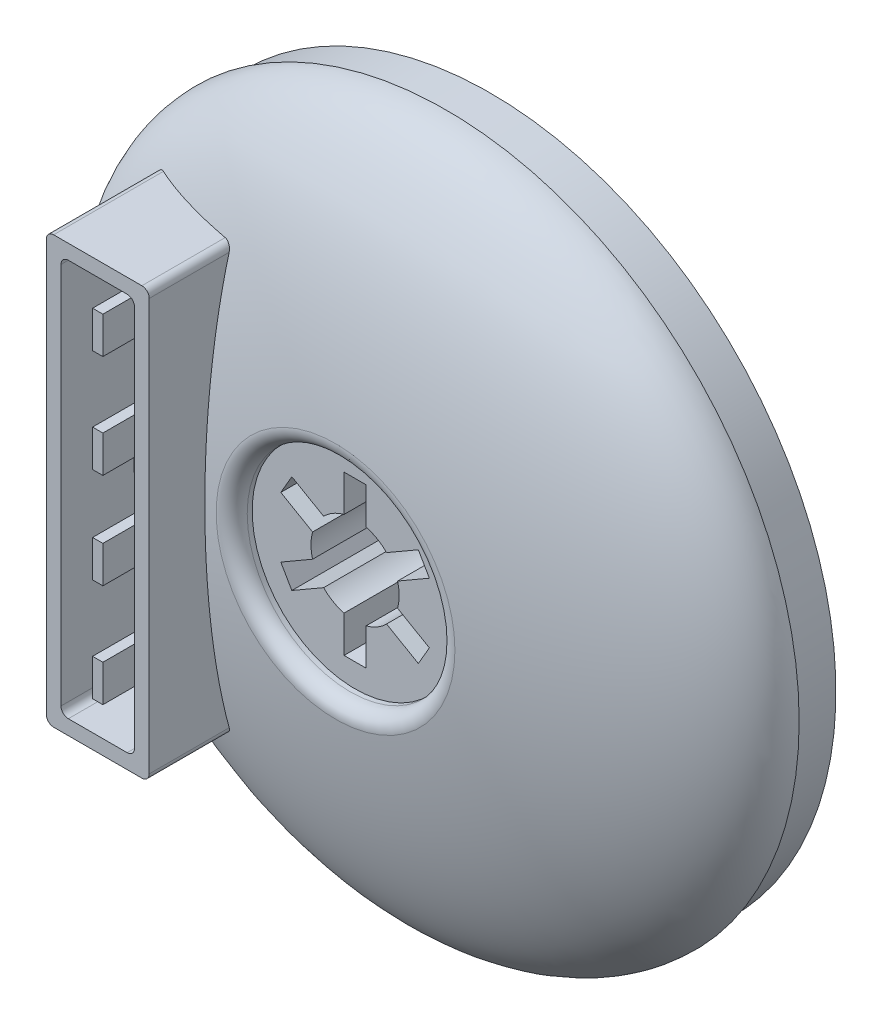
ISO-10303-21;
HEADER;
FILE_DESCRIPTION(('STEP AP214'),'2;1');
FILE_NAME('part.step','',(''),(''),'','','');
FILE_SCHEMA(('AUTOMOTIVE_DESIGN { 1 0 10303 214 1 1 1 1 }'));
ENDSEC;
DATA;
#1=APPLICATION_CONTEXT('core data for automotive mechanical design processes');
#2=APPLICATION_PROTOCOL_DEFINITION('international standard','automotive_design',2000,#1);
#3=PRODUCT_CONTEXT('',#1,'mechanical');
#4=PRODUCT('Part','Part','',(#3));
#5=PRODUCT_RELATED_PRODUCT_CATEGORY('part','',(#4));
#6=PRODUCT_DEFINITION_FORMATION('','',#4);
#7=PRODUCT_DEFINITION_CONTEXT('part definition',#1,'design');
#8=PRODUCT_DEFINITION('design','',#6,#7);
#9=PRODUCT_DEFINITION_SHAPE('','',#8);
#10=(LENGTH_UNIT() NAMED_UNIT(*) SI_UNIT(.MILLI.,.METRE.));
#11=(NAMED_UNIT(*) PLANE_ANGLE_UNIT() SI_UNIT($,.RADIAN.));
#12=(NAMED_UNIT(*) SI_UNIT($,.STERADIAN.) SOLID_ANGLE_UNIT());
#13=UNCERTAINTY_MEASURE_WITH_UNIT(LENGTH_MEASURE(1.E-05),#10,'distance_accuracy_value','');
#14=(GEOMETRIC_REPRESENTATION_CONTEXT(3) GLOBAL_UNCERTAINTY_ASSIGNED_CONTEXT((#13)) GLOBAL_UNIT_ASSIGNED_CONTEXT((#10,
#11,#12)) REPRESENTATION_CONTEXT('',''));
#15=CARTESIAN_POINT('',(0.,0.,0.));
#16=DIRECTION('',(0.,0.,1.));
#17=DIRECTION('',(1.,0.,0.));
#18=AXIS2_PLACEMENT_3D('',#15,#16,#17);
#19=CARTESIAN_POINT('',(0.,0.,10.5354362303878));
#20=DIRECTION('',(0.,0.,-1.));
#21=DIRECTION('',(-1.,0.,0.));
#22=AXIS2_PLACEMENT_3D('',#19,#20,#21);
#23=CYLINDRICAL_SURFACE('',#22,3.);
#24=DIRECTION('',(0.,0.,-1.));
#25=VECTOR('',#24,1.);
#26=CARTESIAN_POINT('',(-2.14057647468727,2.10188780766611,10.5354362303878));
#27=LINE('',#26,#25);
#28=CARTESIAN_POINT('',(-2.14057647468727,2.10188780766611,9.2));
#29=VERTEX_POINT('',#28);
#30=CARTESIAN_POINT('',(-2.14057647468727,2.10188780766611,0.999999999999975));
#31=VERTEX_POINT('',#30);
#32=EDGE_CURVE('E1126',#29,#31,#27,.T.);
#33=ORIENTED_EDGE('',*,*,#32,.T.);
#34=CARTESIAN_POINT('',(0.,0.,0.999999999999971));
#35=DIRECTION('',(0.,0.,-1.));
#36=DIRECTION('',(-1.,0.,0.));
#37=AXIS2_PLACEMENT_3D('',#34,#35,#36);
#38=CIRCLE('',#37,3.);
#39=CARTESIAN_POINT('',(-0.75,2.90473750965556,0.999999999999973));
#40=VERTEX_POINT('',#39);
#41=EDGE_CURVE('E707',#31,#40,#38,.T.);
#42=ORIENTED_EDGE('',*,*,#41,.T.);
#43=DIRECTION('',(0.,0.,-1.));
#44=VECTOR('',#43,1.);
#45=CARTESIAN_POINT('',(-0.75,2.90473750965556,10.5354362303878));
#46=LINE('',#45,#44);
#47=CARTESIAN_POINT('',(-0.75,2.90473750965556,9.2));
#48=VERTEX_POINT('',#47);
#49=EDGE_CURVE('E1115',#48,#40,#46,.T.);
#50=ORIENTED_EDGE('',*,*,#49,.F.);
#51=CARTESIAN_POINT('',(0.,0.,9.2));
#52=DIRECTION('',(0.,0.,1.));
#53=DIRECTION('',(1.,0.,0.));
#54=AXIS2_PLACEMENT_3D('',#51,#52,#53);
#55=CIRCLE('',#54,3.);
#56=EDGE_CURVE('E1940',#48,#29,#55,.T.);
#57=ORIENTED_EDGE('',*,*,#56,.T.);
#58=EDGE_LOOP('',(#33,#42,#50,#57));
#59=FACE_BOUND('',#58,.T.);
#60=ADVANCED_FACE('F61',(#59),#23,.F.);
#61=CARTESIAN_POINT('',(-2.14057647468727,2.10188780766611,10.5354362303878));
#62=DIRECTION('',(0.499999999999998,0.86602540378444,0.));
#63=DIRECTION('',(-0.86602540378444,0.499999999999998,0.));
#64=AXIS2_PLACEMENT_3D('',#61,#62,#63);
#65=PLANE('',#64);
#66=DIRECTION('',(-0.86602540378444,0.499999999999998,0.));
#67=VECTOR('',#66,1.);
#68=CARTESIAN_POINT('',(-2.14057647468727,2.10188780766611,-1.));
#69=LINE('',#68,#67);
#70=CARTESIAN_POINT('',(-3.9061359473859,3.12123404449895,-1.));
#71=VERTEX_POINT('',#70);
#72=CARTESIAN_POINT('',(-4.30153718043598,3.34951905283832,-1.));
#73=VERTEX_POINT('',#72);
#74=EDGE_CURVE('E1121',#71,#73,#69,.T.);
#75=ORIENTED_EDGE('',*,*,#74,.F.);
#76=CARTESIAN_POINT('',(-3.9061359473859,3.12123404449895,-1.));
#77=CARTESIAN_POINT('',(-3.7595634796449,3.03661039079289,-0.832678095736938));
#78=CARTESIAN_POINT('',(-3.61291647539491,2.95194370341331,-0.66544306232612));
#79=CARTESIAN_POINT('',(-3.31938986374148,2.78247603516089,-0.331247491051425));
#80=CARTESIAN_POINT('',(-3.17251025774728,2.69767505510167,-0.164286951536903));
#81=CARTESIAN_POINT('',(-2.87843254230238,2.52788920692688,0.169261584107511));
#82=CARTESIAN_POINT('',(-2.73123443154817,2.44290433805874,0.335849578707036));
#83=CARTESIAN_POINT('',(-2.43633186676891,2.27264226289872,0.668428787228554));
#84=CARTESIAN_POINT('',(-2.2886274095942,2.1873650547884,0.834419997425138));
#85=CARTESIAN_POINT('',(-2.14057647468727,2.10188780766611,0.999999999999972));
#86=B_SPLINE_CURVE_WITH_KNOTS('',3,(#76,#77,#78,#79,#80,#81,#82,#83,#84,#85),.UNSPECIFIED.,.F.,
.F.,(4,2,2,2,4),(0.,0.713982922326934,1.42796153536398,2.14194307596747,2.8559290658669),.UNSPECIFIED.);
#87=EDGE_CURVE('E694',#71,#31,#86,.T.);
#88=ORIENTED_EDGE('',*,*,#87,.T.);
#89=ORIENTED_EDGE('',*,*,#32,.F.);
#90=DIRECTION('',(-0.86602540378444,0.499999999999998,0.));
#91=VECTOR('',#90,1.);
#92=CARTESIAN_POINT('',(0.374999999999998,0.649519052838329,9.2));
#93=LINE('',#92,#91);
#94=CARTESIAN_POINT('',(-4.30153718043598,3.34951905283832,9.2));
#95=VERTEX_POINT('',#94);
#96=EDGE_CURVE('E1938',#29,#95,#93,.T.);
#97=ORIENTED_EDGE('',*,*,#96,.T.);
#98=DIRECTION('',(0.,0.,-1.));
#99=VECTOR('',#98,1.);
#100=CARTESIAN_POINT('',(-4.30153718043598,3.34951905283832,10.5354362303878));
#101=LINE('',#100,#99);
#102=EDGE_CURVE('E1845',#95,#73,#101,.T.);
#103=ORIENTED_EDGE('',*,*,#102,.T.);
#104=EDGE_LOOP('',(#75,#88,#89,#97,#103));
#105=FACE_BOUND('',#104,.T.);
#106=ADVANCED_FACE('F538',(#105),#65,.F.);
#107=CARTESIAN_POINT('',(-5.05153718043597,2.05048094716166,10.5354362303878));
#108=DIRECTION('',(-0.86602540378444,0.499999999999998,0.));
#109=DIRECTION('',(-0.499999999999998,-0.86602540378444,0.));
#110=AXIS2_PLACEMENT_3D('',#107,#108,#109);
#111=PLANE('',#110);
#112=DIRECTION('',(-0.499999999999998,-0.86602540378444,0.));
#113=VECTOR('',#112,1.);
#114=CARTESIAN_POINT('',(-5.05153718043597,2.05048094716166,-1.));
#115=LINE('',#114,#113);
#116=CARTESIAN_POINT('',(-5.05153718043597,2.05048094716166,-1.));
#117=VERTEX_POINT('',#116);
#118=EDGE_CURVE('E1841',#73,#117,#115,.T.);
#119=ORIENTED_EDGE('',*,*,#118,.F.);
#120=ORIENTED_EDGE('',*,*,#102,.F.);
#121=DIRECTION('',(-0.499999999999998,-0.86602540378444,0.));
#122=VECTOR('',#121,1.);
#123=CARTESIAN_POINT('',(-4.67653718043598,2.69999999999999,9.2));
#124=LINE('',#123,#122);
#125=CARTESIAN_POINT('',(-5.05153718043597,2.05048094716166,9.2));
#126=VERTEX_POINT('',#125);
#127=EDGE_CURVE('E1936',#95,#126,#124,.T.);
#128=ORIENTED_EDGE('',*,*,#127,.T.);
#129=DIRECTION('',(0.,0.,-1.));
#130=VECTOR('',#129,1.);
#131=CARTESIAN_POINT('',(-5.05153718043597,2.05048094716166,10.5354362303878));
#132=LINE('',#131,#130);
#133=EDGE_CURVE('E1848',#126,#117,#132,.T.);
#134=ORIENTED_EDGE('',*,*,#133,.T.);
#135=EDGE_LOOP('',(#119,#120,#128,#134));
#136=FACE_BOUND('',#135,.T.);
#137=ADVANCED_FACE('F544',(#136),#111,.F.);
#138=CARTESIAN_POINT('',(-2.89057647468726,0.802849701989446,10.5354362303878));
#139=DIRECTION('',(-0.499999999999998,-0.86602540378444,0.));
#140=DIRECTION('',(0.86602540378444,-0.499999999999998,0.));
#141=AXIS2_PLACEMENT_3D('',#138,#139,#140);
#142=PLANE('',#141);
#143=DIRECTION('',(0.,0.,-1.));
#144=VECTOR('',#143,1.);
#145=CARTESIAN_POINT('',(-2.89057647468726,0.802849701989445,10.5354362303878));
#146=LINE('',#145,#144);
#147=CARTESIAN_POINT('',(-2.89057647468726,0.802849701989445,9.2));
#148=VERTEX_POINT('',#147);
#149=CARTESIAN_POINT('',(-2.89057647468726,0.802849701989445,0.99999999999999));
#150=VERTEX_POINT('',#149);
#151=EDGE_CURVE('E1851',#148,#150,#146,.T.);
#152=ORIENTED_EDGE('',*,*,#151,.T.);
#153=CARTESIAN_POINT('',(-2.89057647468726,0.802849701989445,0.999999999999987));
#154=CARTESIAN_POINT('',(-3.0386274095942,0.888326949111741,0.834419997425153));
#155=CARTESIAN_POINT('',(-3.18633186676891,0.973604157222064,0.668428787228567));
#156=CARTESIAN_POINT('',(-3.48123443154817,1.14386623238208,0.335849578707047));
#157=CARTESIAN_POINT('',(-3.62843254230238,1.22885110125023,0.16926158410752));
#158=CARTESIAN_POINT('',(-3.92251025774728,1.39863694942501,-0.164286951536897));
#159=CARTESIAN_POINT('',(-4.06938986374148,1.48343792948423,-0.33124749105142));
#160=CARTESIAN_POINT('',(-4.36291647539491,1.65290559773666,-0.665443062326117));
#161=CARTESIAN_POINT('',(-4.5095634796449,1.73757228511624,-0.832678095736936));
#162=CARTESIAN_POINT('',(-4.65613594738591,1.8221959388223,-1.));
#163=B_SPLINE_CURVE_WITH_KNOTS('',3,(#153,#154,#155,#156,#157,#158,#159,#160,#161,#162),
.UNSPECIFIED.,.F.,.F.,(4,2,2,2,4),(0.,0.713985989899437,1.42796753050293,2.14194614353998,
2.85592906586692),.UNSPECIFIED.);
#164=CARTESIAN_POINT('',(-4.65613594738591,1.8221959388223,-1.));
#165=VERTEX_POINT('',#164);
#166=EDGE_CURVE('E921',#150,#165,#163,.T.);
#167=ORIENTED_EDGE('',*,*,#166,.T.);
#168=DIRECTION('',(0.86602540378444,-0.499999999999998,0.));
#169=VECTOR('',#168,1.);
#170=CARTESIAN_POINT('',(-2.89057647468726,0.802849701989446,-1.));
#171=LINE('',#170,#169);
#172=EDGE_CURVE('E1838',#117,#165,#171,.T.);
#173=ORIENTED_EDGE('',*,*,#172,.F.);
#174=ORIENTED_EDGE('',*,*,#133,.F.);
#175=DIRECTION('',(0.86602540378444,-0.499999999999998,0.));
#176=VECTOR('',#175,1.);
#177=CARTESIAN_POINT('',(-0.374999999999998,-0.649519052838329,9.2));
#178=LINE('',#177,#176);
#179=EDGE_CURVE('E1934',#126,#148,#178,.T.);
#180=ORIENTED_EDGE('',*,*,#179,.T.);
#181=EDGE_LOOP('',(#152,#167,#173,#174,#180));
#182=FACE_BOUND('',#181,.T.);
#183=ADVANCED_FACE('F913',(#182),#142,.F.);
#184=CARTESIAN_POINT('',(0.,0.,10.5354362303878));
#185=DIRECTION('',(0.,0.,-1.));
#186=DIRECTION('',(-1.,0.,0.));
#187=AXIS2_PLACEMENT_3D('',#184,#185,#186);
#188=CYLINDRICAL_SURFACE('',#187,3.);
#189=DIRECTION('',(0.,0.,-1.));
#190=VECTOR('',#189,1.);
#191=CARTESIAN_POINT('',(-2.89057647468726,-0.802849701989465,10.5354362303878));
#192=LINE('',#191,#190);
#193=CARTESIAN_POINT('',(-2.89057647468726,-0.802849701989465,9.2));
#194=VERTEX_POINT('',#193);
#195=CARTESIAN_POINT('',(-2.89057647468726,-0.802849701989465,0.99999999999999));
#196=VERTEX_POINT('',#195);
#197=EDGE_CURVE('E1854',#194,#196,#192,.T.);
#198=ORIENTED_EDGE('',*,*,#197,.T.);
#199=CARTESIAN_POINT('',(0.,0.,0.999999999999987));
#200=DIRECTION('',(0.,0.,-1.));
#201=DIRECTION('',(-1.,0.,0.));
#202=AXIS2_PLACEMENT_3D('',#199,#200,#201);
#203=CIRCLE('',#202,3.);
#204=EDGE_CURVE('E926',#196,#150,#203,.T.);
#205=ORIENTED_EDGE('',*,*,#204,.T.);
#206=ORIENTED_EDGE('',*,*,#151,.F.);
#207=CARTESIAN_POINT('',(0.,0.,9.2));
#208=DIRECTION('',(0.,0.,1.));
#209=DIRECTION('',(1.,0.,0.));
#210=AXIS2_PLACEMENT_3D('',#207,#208,#209);
#211=CIRCLE('',#210,3.);
#212=EDGE_CURVE('E1932',#148,#194,#211,.T.);
#213=ORIENTED_EDGE('',*,*,#212,.T.);
#214=EDGE_LOOP('',(#198,#205,#206,#213));
#215=FACE_BOUND('',#214,.T.);
#216=ADVANCED_FACE('F918',(#215),#188,.F.);
#217=CARTESIAN_POINT('',(-2.89057647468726,-0.802849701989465,10.5354362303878));
#218=DIRECTION('',(-0.500000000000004,0.866025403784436,0.));
#219=DIRECTION('',(-0.866025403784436,-0.500000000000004,0.));
#220=AXIS2_PLACEMENT_3D('',#217,#218,#219);
#221=PLANE('',#220);
#222=DIRECTION('',(-0.866025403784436,-0.500000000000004,0.));
#223=VECTOR('',#222,1.);
#224=CARTESIAN_POINT('',(-2.89057647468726,-0.802849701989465,-1.));
#225=LINE('',#224,#223);
#226=CARTESIAN_POINT('',(-4.6561359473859,-1.82219593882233,-1.));
#227=VERTEX_POINT('',#226);
#228=CARTESIAN_POINT('',(-5.05153718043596,-2.05048094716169,-1.));
#229=VERTEX_POINT('',#228);
#230=EDGE_CURVE('E1836',#227,#229,#225,.T.);
#231=ORIENTED_EDGE('',*,*,#230,.F.);
#232=CARTESIAN_POINT('',(-4.6561359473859,-1.82219593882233,-1.));
#233=CARTESIAN_POINT('',(-4.50956347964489,-1.73757228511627,-0.832678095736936));
#234=CARTESIAN_POINT('',(-4.3629164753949,-1.65290559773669,-0.665443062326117));
#235=CARTESIAN_POINT('',(-4.06938986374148,-1.48343792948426,-0.33124749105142));
#236=CARTESIAN_POINT('',(-3.92251025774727,-1.39863694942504,-0.164286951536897));
#237=CARTESIAN_POINT('',(-3.62843254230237,-1.22885110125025,0.16926158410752));
#238=CARTESIAN_POINT('',(-3.48123443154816,-1.14386623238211,0.335849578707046));
#239=CARTESIAN_POINT('',(-3.1863318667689,-0.973604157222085,0.668428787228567));
#240=CARTESIAN_POINT('',(-3.0386274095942,-0.888326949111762,0.834419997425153));
#241=CARTESIAN_POINT('',(-2.89057647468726,-0.802849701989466,0.999999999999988));
#242=B_SPLINE_CURVE_WITH_KNOTS('',3,(#232,#233,#234,#235,#236,#237,#238,#239,#240,#241),
.UNSPECIFIED.,.F.,.F.,(4,2,2,2,4),(0.,0.71398292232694,1.42796153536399,2.14194307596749,
2.85592906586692),.UNSPECIFIED.);
#243=EDGE_CURVE('E928',#227,#196,#242,.T.);
#244=ORIENTED_EDGE('',*,*,#243,.T.);
#245=ORIENTED_EDGE('',*,*,#197,.F.);
#246=DIRECTION('',(-0.866025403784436,-0.500000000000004,0.));
#247=VECTOR('',#246,1.);
#248=CARTESIAN_POINT('',(-0.375000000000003,0.649519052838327,9.2));
#249=LINE('',#248,#247);
#250=CARTESIAN_POINT('',(-5.05153718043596,-2.05048094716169,9.2));
#251=VERTEX_POINT('',#250);
#252=EDGE_CURVE('E1930',#194,#251,#249,.T.);
#253=ORIENTED_EDGE('',*,*,#252,.T.);
#254=DIRECTION('',(0.,0.,-1.));
#255=VECTOR('',#254,1.);
#256=CARTESIAN_POINT('',(-5.05153718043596,-2.05048094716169,10.5354362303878));
#257=LINE('',#256,#255);
#258=EDGE_CURVE('E1857',#251,#229,#257,.T.);
#259=ORIENTED_EDGE('',*,*,#258,.T.);
#260=EDGE_LOOP('',(#231,#244,#245,#253,#259));
#261=FACE_BOUND('',#260,.T.);
#262=ADVANCED_FACE('F939',(#261),#221,.F.);
#263=CARTESIAN_POINT('',(-4.30153718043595,-3.34951905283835,10.5354362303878));
#264=DIRECTION('',(-0.866025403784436,-0.500000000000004,0.));
#265=DIRECTION('',(0.500000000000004,-0.866025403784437,0.));
#266=AXIS2_PLACEMENT_3D('',#263,#264,#265);
#267=PLANE('',#266);
#268=DIRECTION('',(0.500000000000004,-0.866025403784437,0.));
#269=VECTOR('',#268,1.);
#270=CARTESIAN_POINT('',(-4.30153718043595,-3.34951905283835,-1.));
#271=LINE('',#270,#269);
#272=CARTESIAN_POINT('',(-4.30153718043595,-3.34951905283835,-1.));
#273=VERTEX_POINT('',#272);
#274=EDGE_CURVE('E1834',#229,#273,#271,.T.);
#275=ORIENTED_EDGE('',*,*,#274,.F.);
#276=ORIENTED_EDGE('',*,*,#258,.F.);
#277=DIRECTION('',(0.500000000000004,-0.866025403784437,0.));
#278=VECTOR('',#277,1.);
#279=CARTESIAN_POINT('',(-4.67653718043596,-2.70000000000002,9.2));
#280=LINE('',#279,#278);
#281=CARTESIAN_POINT('',(-4.30153718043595,-3.34951905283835,9.2));
#282=VERTEX_POINT('',#281);
#283=EDGE_CURVE('E1928',#251,#282,#280,.T.);
#284=ORIENTED_EDGE('',*,*,#283,.T.);
#285=DIRECTION('',(0.,0.,-1.));
#286=VECTOR('',#285,1.);
#287=CARTESIAN_POINT('',(-4.30153718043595,-3.34951905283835,10.5354362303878));
#288=LINE('',#287,#286);
#289=EDGE_CURVE('E1860',#282,#273,#288,.T.);
#290=ORIENTED_EDGE('',*,*,#289,.T.);
#291=EDGE_LOOP('',(#275,#276,#284,#290));
#292=FACE_BOUND('',#291,.T.);
#293=ADVANCED_FACE('F943',(#292),#267,.F.);
#294=CARTESIAN_POINT('',(-2.14057647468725,-2.10188780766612,10.5354362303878));
#295=DIRECTION('',(0.500000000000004,-0.866025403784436,0.));
#296=DIRECTION('',(0.866025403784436,0.500000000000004,0.));
#297=AXIS2_PLACEMENT_3D('',#294,#295,#296);
#298=PLANE('',#297);
#299=DIRECTION('',(0.,0.,-1.));
#300=VECTOR('',#299,1.);
#301=CARTESIAN_POINT('',(-2.14057647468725,-2.10188780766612,10.5354362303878));
#302=LINE('',#301,#300);
#303=CARTESIAN_POINT('',(-2.14057647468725,-2.10188780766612,9.2));
#304=VERTEX_POINT('',#303);
#305=CARTESIAN_POINT('',(-2.14057647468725,-2.10188780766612,0.999999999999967));
#306=VERTEX_POINT('',#305);
#307=EDGE_CURVE('E1863',#304,#306,#302,.T.);
#308=ORIENTED_EDGE('',*,*,#307,.T.);
#309=CARTESIAN_POINT('',(-2.14057647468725,-2.10188780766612,0.999999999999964));
#310=CARTESIAN_POINT('',(-2.28862740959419,-2.18736505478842,0.834419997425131));
#311=CARTESIAN_POINT('',(-2.43633186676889,-2.27264226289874,0.668428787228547));
#312=CARTESIAN_POINT('',(-2.73123443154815,-2.44290433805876,0.335849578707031));
#313=CARTESIAN_POINT('',(-2.87843254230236,-2.5278892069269,0.169261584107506));
#314=CARTESIAN_POINT('',(-3.17251025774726,-2.69767505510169,-0.164286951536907));
#315=CARTESIAN_POINT('',(-3.31938986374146,-2.78247603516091,-0.331247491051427));
#316=CARTESIAN_POINT('',(-3.61291647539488,-2.95194370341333,-0.665443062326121));
#317=CARTESIAN_POINT('',(-3.75956347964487,-3.03661039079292,-0.832678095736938));
#318=CARTESIAN_POINT('',(-3.90613594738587,-3.12123404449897,-1.));
#319=B_SPLINE_CURVE_WITH_KNOTS('',3,(#309,#310,#311,#312,#313,#314,#315,#316,#317,#318),
.UNSPECIFIED.,.F.,.F.,(4,2,2,2,4),(0.,0.713985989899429,1.42796753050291,2.14194614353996,
2.85592906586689),.UNSPECIFIED.);
#320=CARTESIAN_POINT('',(-3.90613594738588,-3.12123404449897,-1.));
#321=VERTEX_POINT('',#320);
#322=EDGE_CURVE('E933',#306,#321,#319,.T.);
#323=ORIENTED_EDGE('',*,*,#322,.T.);
#324=DIRECTION('',(0.866025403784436,0.500000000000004,0.));
#325=VECTOR('',#324,1.);
#326=CARTESIAN_POINT('',(-2.14057647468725,-2.10188780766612,-1.));
#327=LINE('',#326,#325);
#328=EDGE_CURVE('E1831',#273,#321,#327,.T.);
#329=ORIENTED_EDGE('',*,*,#328,.F.);
#330=ORIENTED_EDGE('',*,*,#289,.F.);
#331=DIRECTION('',(0.866025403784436,0.500000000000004,0.));
#332=VECTOR('',#331,1.);
#333=CARTESIAN_POINT('',(0.375000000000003,-0.649519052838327,9.2));
#334=LINE('',#333,#332);
#335=EDGE_CURVE('E1926',#282,#304,#334,.T.);
#336=ORIENTED_EDGE('',*,*,#335,.T.);
#337=EDGE_LOOP('',(#308,#323,#329,#330,#336));
#338=FACE_BOUND('',#337,.T.);
#339=ADVANCED_FACE('F946',(#338),#298,.F.);
#340=CARTESIAN_POINT('',(0.,0.,10.5354362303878));
#341=DIRECTION('',(0.,0.,-1.));
#342=DIRECTION('',(-1.,0.,0.));
#343=AXIS2_PLACEMENT_3D('',#340,#341,#342);
#344=CYLINDRICAL_SURFACE('',#343,3.);
#345=DIRECTION('',(0.,0.,-1.));
#346=VECTOR('',#345,1.);
#347=CARTESIAN_POINT('',(-0.74999999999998,-2.90473750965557,10.5354362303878));
#348=LINE('',#347,#346);
#349=CARTESIAN_POINT('',(-0.74999999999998,-2.90473750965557,9.2));
#350=VERTEX_POINT('',#349);
#351=CARTESIAN_POINT('',(-0.74999999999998,-2.90473750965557,0.999999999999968));
#352=VERTEX_POINT('',#351);
#353=EDGE_CURVE('E1866',#350,#352,#348,.T.);
#354=ORIENTED_EDGE('',*,*,#353,.T.);
#355=CARTESIAN_POINT('',(0.,0.,0.999999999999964));
#356=DIRECTION('',(0.,0.,-1.));
#357=DIRECTION('',(-1.,0.,0.));
#358=AXIS2_PLACEMENT_3D('',#355,#356,#357);
#359=CIRCLE('',#358,3.);
#360=EDGE_CURVE('E969',#352,#306,#359,.T.);
#361=ORIENTED_EDGE('',*,*,#360,.T.);
#362=ORIENTED_EDGE('',*,*,#307,.F.);
#363=CARTESIAN_POINT('',(0.,0.,9.2));
#364=DIRECTION('',(0.,0.,1.));
#365=DIRECTION('',(1.,0.,0.));
#366=AXIS2_PLACEMENT_3D('',#363,#364,#365);
#367=CIRCLE('',#366,3.);
#368=EDGE_CURVE('E1924',#304,#350,#367,.T.);
#369=ORIENTED_EDGE('',*,*,#368,.T.);
#370=EDGE_LOOP('',(#354,#361,#362,#369));
#371=FACE_BOUND('',#370,.T.);
#372=ADVANCED_FACE('F951',(#371),#344,.F.);
#373=CARTESIAN_POINT('',(-0.74999999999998,-2.90473750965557,10.5354362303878));
#374=DIRECTION('',(-1.,0.,0.));
#375=DIRECTION('',(0.,-1.,0.));
#376=AXIS2_PLACEMENT_3D('',#373,#374,#375);
#377=PLANE('',#376);
#378=DIRECTION('',(0.,-1.,0.));
#379=VECTOR('',#378,1.);
#380=CARTESIAN_POINT('',(-0.74999999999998,-2.90473750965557,-1.));
#381=LINE('',#380,#379);
#382=CARTESIAN_POINT('',(-0.749999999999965,-4.94342998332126,-1.));
#383=VERTEX_POINT('',#382);
#384=CARTESIAN_POINT('',(-0.749999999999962,-5.40000000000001,-1.));
#385=VERTEX_POINT('',#384);
#386=EDGE_CURVE('E1829',#383,#385,#381,.T.);
#387=ORIENTED_EDGE('',*,*,#386,.F.);
#388=CARTESIAN_POINT('',(-0.749999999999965,-4.94342998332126,-1.));
#389=CARTESIAN_POINT('',(-0.749999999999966,-4.77418267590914,-0.832678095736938));
#390=CARTESIAN_POINT('',(-0.749999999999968,-4.60484930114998,-0.665443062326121));
#391=CARTESIAN_POINT('',(-0.74999999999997,-4.26591396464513,-0.331247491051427));
#392=CARTESIAN_POINT('',(-0.749999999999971,-4.09631200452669,-0.164286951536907));
#393=CARTESIAN_POINT('',(-0.749999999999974,-3.75674030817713,0.169261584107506));
#394=CARTESIAN_POINT('',(-0.749999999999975,-3.58677057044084,0.335849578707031));
#395=CARTESIAN_POINT('',(-0.749999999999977,-3.2462464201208,0.668428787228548));
#396=CARTESIAN_POINT('',(-0.749999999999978,-3.07569200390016,0.834419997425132));
#397=CARTESIAN_POINT('',(-0.74999999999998,-2.90473750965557,0.999999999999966));
#398=B_SPLINE_CURVE_WITH_KNOTS('',3,(#388,#389,#390,#391,#392,#393,#394,#395,#396,#397),
.UNSPECIFIED.,.F.,.F.,(4,2,2,2,4),(0.,0.713982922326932,1.42796153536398,2.14194307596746,
2.85592906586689),.UNSPECIFIED.);
#399=EDGE_CURVE('E964',#383,#352,#398,.T.);
#400=ORIENTED_EDGE('',*,*,#399,.T.);
#401=ORIENTED_EDGE('',*,*,#353,.F.);
#402=DIRECTION('',(0.,-1.,0.));
#403=VECTOR('',#402,1.);
#404=CARTESIAN_POINT('',(-0.75,0.,9.2));
#405=LINE('',#404,#403);
#406=CARTESIAN_POINT('',(-0.749999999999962,-5.40000000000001,9.2));
#407=VERTEX_POINT('',#406);
#408=EDGE_CURVE('E1922',#350,#407,#405,.T.);
#409=ORIENTED_EDGE('',*,*,#408,.T.);
#410=DIRECTION('',(0.,0.,-1.));
#411=VECTOR('',#410,1.);
#412=CARTESIAN_POINT('',(-0.749999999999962,-5.40000000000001,10.5354362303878));
#413=LINE('',#412,#411);
#414=EDGE_CURVE('E1869',#407,#385,#413,.T.);
#415=ORIENTED_EDGE('',*,*,#414,.T.);
#416=EDGE_LOOP('',(#387,#400,#401,#409,#415));
#417=FACE_BOUND('',#416,.T.);
#418=ADVANCED_FACE('F955',(#417),#377,.F.);
#419=CARTESIAN_POINT('',(0.750000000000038,-5.4,10.5354362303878));
#420=DIRECTION('',(0.,-1.,0.));
#421=DIRECTION('',(1.,0.,0.));
#422=AXIS2_PLACEMENT_3D('',#419,#420,#421);
#423=PLANE('',#422);
#424=DIRECTION('',(1.,0.,0.));
#425=VECTOR('',#424,1.);
#426=CARTESIAN_POINT('',(0.750000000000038,-5.4,-1.));
#427=LINE('',#426,#425);
#428=CARTESIAN_POINT('',(0.750000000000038,-5.4,-1.));
#429=VERTEX_POINT('',#428);
#430=EDGE_CURVE('E1827',#385,#429,#427,.T.);
#431=ORIENTED_EDGE('',*,*,#430,.F.);
#432=ORIENTED_EDGE('',*,*,#414,.F.);
#433=DIRECTION('',(1.,0.,0.));
#434=VECTOR('',#433,1.);
#435=CARTESIAN_POINT('',(0.,-5.4,9.2));
#436=LINE('',#435,#434);
#437=CARTESIAN_POINT('',(0.750000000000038,-5.4,9.2));
#438=VERTEX_POINT('',#437);
#439=EDGE_CURVE('E1920',#407,#438,#436,.T.);
#440=ORIENTED_EDGE('',*,*,#439,.T.);
#441=DIRECTION('',(0.,0.,-1.));
#442=VECTOR('',#441,1.);
#443=CARTESIAN_POINT('',(0.750000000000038,-5.4,10.5354362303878));
#444=LINE('',#443,#442);
#445=EDGE_CURVE('E1872',#438,#429,#444,.T.);
#446=ORIENTED_EDGE('',*,*,#445,.T.);
#447=EDGE_LOOP('',(#431,#432,#440,#446));
#448=FACE_BOUND('',#447,.T.);
#449=ADVANCED_FACE('F960',(#448),#423,.F.);
#450=CARTESIAN_POINT('',(0.75000000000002,-2.90473750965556,10.5354362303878));
#451=DIRECTION('',(1.,0.,0.));
#452=DIRECTION('',(0.,1.,0.));
#453=AXIS2_PLACEMENT_3D('',#450,#451,#452);
#454=PLANE('',#453);
#455=DIRECTION('',(0.,0.,-1.));
#456=VECTOR('',#455,1.);
#457=CARTESIAN_POINT('',(0.750000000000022,-2.90473750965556,10.5354362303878));
#458=LINE('',#457,#456);
#459=CARTESIAN_POINT('',(0.750000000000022,-2.90473750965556,9.2));
#460=VERTEX_POINT('',#459);
#461=CARTESIAN_POINT('',(0.750000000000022,-2.90473750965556,0.999999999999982));
#462=VERTEX_POINT('',#461);
#463=EDGE_CURVE('E1875',#460,#462,#458,.T.);
#464=ORIENTED_EDGE('',*,*,#463,.T.);
#465=CARTESIAN_POINT('',(0.750000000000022,-2.90473750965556,0.99999999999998));
#466=CARTESIAN_POINT('',(0.750000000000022,-3.07569200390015,0.834419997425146));
#467=CARTESIAN_POINT('',(0.750000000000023,-3.24624642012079,0.668428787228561));
#468=CARTESIAN_POINT('',(0.750000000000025,-3.58677057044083,0.335849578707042));
#469=CARTESIAN_POINT('',(0.750000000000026,-3.75674030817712,0.169261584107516));
#470=CARTESIAN_POINT('',(0.750000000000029,-4.09631200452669,-0.1642869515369));
#471=CARTESIAN_POINT('',(0.75000000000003,-4.26591396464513,-0.331247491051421));
#472=CARTESIAN_POINT('',(0.750000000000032,-4.60484930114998,-0.665443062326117));
#473=CARTESIAN_POINT('',(0.750000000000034,-4.77418267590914,-0.832678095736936));
#474=CARTESIAN_POINT('',(0.750000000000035,-4.94342998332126,-1.));
#475=B_SPLINE_CURVE_WITH_KNOTS('',3,(#465,#466,#467,#468,#469,#470,#471,#472,#473,#474),
.UNSPECIFIED.,.F.,.F.,(4,2,2,2,4),(0.,0.713985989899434,1.42796753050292,2.14194614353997,
2.85592906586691),.UNSPECIFIED.);
#476=CARTESIAN_POINT('',(0.750000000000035,-4.94342998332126,-1.));
#477=VERTEX_POINT('',#476);
#478=EDGE_CURVE('E970',#462,#477,#475,.T.);
#479=ORIENTED_EDGE('',*,*,#478,.T.);
#480=DIRECTION('',(0.,1.,0.));
#481=VECTOR('',#480,1.);
#482=CARTESIAN_POINT('',(0.75000000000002,-2.90473750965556,-1.));
#483=LINE('',#482,#481);
#484=EDGE_CURVE('E1824',#429,#477,#483,.T.);
#485=ORIENTED_EDGE('',*,*,#484,.F.);
#486=ORIENTED_EDGE('',*,*,#445,.F.);
#487=DIRECTION('',(0.,1.,0.));
#488=VECTOR('',#487,1.);
#489=CARTESIAN_POINT('',(0.75,0.,9.2));
#490=LINE('',#489,#488);
#491=EDGE_CURVE('E1918',#438,#460,#490,.T.);
#492=ORIENTED_EDGE('',*,*,#491,.T.);
#493=EDGE_LOOP('',(#464,#479,#485,#486,#492));
#494=FACE_BOUND('',#493,.T.);
#495=ADVANCED_FACE('F1682',(#494),#454,.F.);
#496=CARTESIAN_POINT('',(0.,0.,10.5354362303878));
#497=DIRECTION('',(0.,0.,-1.));
#498=DIRECTION('',(-1.,0.,0.));
#499=AXIS2_PLACEMENT_3D('',#496,#497,#498);
#500=CYLINDRICAL_SURFACE('',#499,3.);
#501=DIRECTION('',(0.,0.,-1.));
#502=VECTOR('',#501,1.);
#503=CARTESIAN_POINT('',(2.14057647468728,-2.10188780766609,10.5354362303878));
#504=LINE('',#503,#502);
#505=CARTESIAN_POINT('',(2.14057647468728,-2.10188780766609,9.2));
#506=VERTEX_POINT('',#505);
#507=CARTESIAN_POINT('',(2.14057647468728,-2.10188780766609,0.999999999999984));
#508=VERTEX_POINT('',#507);
#509=EDGE_CURVE('E1878',#506,#508,#504,.T.);
#510=ORIENTED_EDGE('',*,*,#509,.T.);
#511=CARTESIAN_POINT('',(0.,0.,0.99999999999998));
#512=DIRECTION('',(0.,0.,-1.));
#513=DIRECTION('',(-1.,0.,0.));
#514=AXIS2_PLACEMENT_3D('',#511,#512,#513);
#515=CIRCLE('',#514,3.);
#516=EDGE_CURVE('E996',#508,#462,#515,.T.);
#517=ORIENTED_EDGE('',*,*,#516,.T.);
#518=ORIENTED_EDGE('',*,*,#463,.F.);
#519=CARTESIAN_POINT('',(0.,0.,9.2));
#520=DIRECTION('',(0.,0.,1.));
#521=DIRECTION('',(1.,0.,0.));
#522=AXIS2_PLACEMENT_3D('',#519,#520,#521);
#523=CIRCLE('',#522,3.);
#524=EDGE_CURVE('E1916',#460,#506,#523,.T.);
#525=ORIENTED_EDGE('',*,*,#524,.T.);
#526=EDGE_LOOP('',(#510,#517,#518,#525));
#527=FACE_BOUND('',#526,.T.);
#528=ADVANCED_FACE('F1009',(#527),#500,.F.);
#529=CARTESIAN_POINT('',(2.14057647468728,-2.10188780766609,10.5354362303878));
#530=DIRECTION('',(-0.499999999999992,-0.866025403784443,0.));
#531=DIRECTION('',(0.866025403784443,-0.499999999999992,0.));
#532=AXIS2_PLACEMENT_3D('',#529,#530,#531);
#533=PLANE('',#532);
#534=DIRECTION('',(0.866025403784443,-0.499999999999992,0.));
#535=VECTOR('',#534,1.);
#536=CARTESIAN_POINT('',(2.14057647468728,-2.10188780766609,-1.));
#537=LINE('',#536,#535);
#538=CARTESIAN_POINT('',(3.90613594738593,-3.12123404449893,-1.));
#539=VERTEX_POINT('',#538);
#540=CARTESIAN_POINT('',(4.301537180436,-3.34951905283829,-1.));
#541=VERTEX_POINT('',#540);
#542=EDGE_CURVE('E1822',#539,#541,#537,.T.);
#543=ORIENTED_EDGE('',*,*,#542,.F.);
#544=CARTESIAN_POINT('',(3.90613594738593,-3.12123404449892,-1.));
#545=CARTESIAN_POINT('',(3.75956347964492,-3.03661039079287,-0.832678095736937));
#546=CARTESIAN_POINT('',(3.61291647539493,-2.95194370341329,-0.665443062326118));
#547=CARTESIAN_POINT('',(3.3193898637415,-2.78247603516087,-0.331247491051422));
#548=CARTESIAN_POINT('',(3.1725102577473,-2.69767505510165,-0.1642869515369));
#549=CARTESIAN_POINT('',(2.8784325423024,-2.52788920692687,0.169261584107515));
#550=CARTESIAN_POINT('',(2.73123443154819,-2.44290433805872,0.335849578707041));
#551=CARTESIAN_POINT('',(2.43633186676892,-2.27264226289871,0.668428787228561));
#552=CARTESIAN_POINT('',(2.28862740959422,-2.18736505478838,0.834419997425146));
#553=CARTESIAN_POINT('',(2.14057647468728,-2.10188780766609,0.99999999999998));
#554=B_SPLINE_CURVE_WITH_KNOTS('',3,(#544,#545,#546,#547,#548,#549,#550,#551,#552,#553),
.UNSPECIFIED.,.F.,.F.,(4,2,2,2,4),(0.,0.713982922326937,1.42796153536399,2.14194307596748,
2.85592906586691),.UNSPECIFIED.);
#555=EDGE_CURVE('E990',#539,#508,#554,.T.);
#556=ORIENTED_EDGE('',*,*,#555,.T.);
#557=ORIENTED_EDGE('',*,*,#509,.F.);
#558=DIRECTION('',(0.866025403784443,-0.499999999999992,0.));
#559=VECTOR('',#558,1.);
#560=CARTESIAN_POINT('',(-0.374999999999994,-0.649519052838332,9.2));
#561=LINE('',#560,#559);
#562=CARTESIAN_POINT('',(4.301537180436,-3.34951905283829,9.2));
#563=VERTEX_POINT('',#562);
#564=EDGE_CURVE('E1914',#506,#563,#561,.T.);
#565=ORIENTED_EDGE('',*,*,#564,.T.);
#566=DIRECTION('',(0.,0.,-1.));
#567=VECTOR('',#566,1.);
#568=CARTESIAN_POINT('',(4.301537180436,-3.34951905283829,10.5354362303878));
#569=LINE('',#568,#567);
#570=EDGE_CURVE('E1881',#563,#541,#569,.T.);
#571=ORIENTED_EDGE('',*,*,#570,.T.);
#572=EDGE_LOOP('',(#543,#556,#557,#565,#571));
#573=FACE_BOUND('',#572,.T.);
#574=ADVANCED_FACE('F1003',(#573),#533,.F.);
#575=CARTESIAN_POINT('',(5.05153718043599,-2.05048094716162,10.5354362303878));
#576=DIRECTION('',(0.866025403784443,-0.499999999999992,0.));
#577=DIRECTION('',(0.499999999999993,0.866025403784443,0.));
#578=AXIS2_PLACEMENT_3D('',#575,#576,#577);
#579=PLANE('',#578);
#580=DIRECTION('',(0.499999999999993,0.866025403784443,0.));
#581=VECTOR('',#580,1.);
#582=CARTESIAN_POINT('',(5.05153718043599,-2.05048094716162,-1.));
#583=LINE('',#582,#581);
#584=CARTESIAN_POINT('',(5.05153718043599,-2.05048094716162,-1.));
#585=VERTEX_POINT('',#584);
#586=EDGE_CURVE('E1060',#541,#585,#583,.T.);
#587=ORIENTED_EDGE('',*,*,#586,.F.);
#588=ORIENTED_EDGE('',*,*,#570,.F.);
#589=DIRECTION('',(0.499999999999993,0.866025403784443,0.));
#590=VECTOR('',#589,1.);
#591=CARTESIAN_POINT('',(4.67653718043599,-2.69999999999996,9.2));
#592=LINE('',#591,#590);
#593=CARTESIAN_POINT('',(5.05153718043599,-2.05048094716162,9.2));
#594=VERTEX_POINT('',#593);
#595=EDGE_CURVE('E1912',#563,#594,#592,.T.);
#596=ORIENTED_EDGE('',*,*,#595,.T.);
#597=DIRECTION('',(0.,0.,-1.));
#598=VECTOR('',#597,1.);
#599=CARTESIAN_POINT('',(5.05153718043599,-2.05048094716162,10.5354362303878));
#600=LINE('',#599,#598);
#601=EDGE_CURVE('E1884',#594,#585,#600,.T.);
#602=ORIENTED_EDGE('',*,*,#601,.T.);
#603=EDGE_LOOP('',(#587,#588,#596,#602));
#604=FACE_BOUND('',#603,.T.);
#605=ADVANCED_FACE('F1008',(#604),#579,.F.);
#606=CARTESIAN_POINT('',(2.89057647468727,-0.802849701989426,10.5354362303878));
#607=DIRECTION('',(0.499999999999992,0.866025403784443,0.));
#608=DIRECTION('',(-0.866025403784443,0.499999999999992,0.));
#609=AXIS2_PLACEMENT_3D('',#606,#607,#608);
#610=PLANE('',#609);
#611=DIRECTION('',(0.,0.,-1.));
#612=VECTOR('',#611,1.);
#613=CARTESIAN_POINT('',(2.89057647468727,-0.802849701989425,10.5354362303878));
#614=LINE('',#613,#612);
#615=CARTESIAN_POINT('',(2.89057647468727,-0.802849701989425,9.2));
#616=VERTEX_POINT('',#615);
#617=CARTESIAN_POINT('',(2.89057647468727,-0.802849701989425,0.99999999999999));
#618=VERTEX_POINT('',#617);
#619=EDGE_CURVE('E1051',#616,#618,#614,.T.);
#620=ORIENTED_EDGE('',*,*,#619,.T.);
#621=CARTESIAN_POINT('',(2.89057647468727,-0.802849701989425,0.999999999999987));
#622=CARTESIAN_POINT('',(3.03862740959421,-0.88832694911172,0.834419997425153));
#623=CARTESIAN_POINT('',(3.18633186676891,-0.973604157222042,0.668428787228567));
#624=CARTESIAN_POINT('',(3.48123443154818,-1.14386623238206,0.335849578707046));
#625=CARTESIAN_POINT('',(3.62843254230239,-1.2288511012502,0.169261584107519));
#626=CARTESIAN_POINT('',(3.92251025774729,-1.39863694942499,-0.164286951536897));
#627=CARTESIAN_POINT('',(4.0693898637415,-1.4834379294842,-0.33124749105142));
#628=CARTESIAN_POINT('',(4.36291647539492,-1.65290559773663,-0.665443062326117));
#629=CARTESIAN_POINT('',(4.50956347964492,-1.73757228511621,-0.832678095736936));
#630=CARTESIAN_POINT('',(4.65613594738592,-1.82219593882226,-1.));
#631=B_SPLINE_CURVE_WITH_KNOTS('',3,(#621,#622,#623,#624,#625,#626,#627,#628,#629,#630),
.UNSPECIFIED.,.F.,.F.,(4,2,2,2,4),(0.,0.713985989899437,1.42796753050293,2.14194614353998,
2.85592906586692),.UNSPECIFIED.);
#632=CARTESIAN_POINT('',(4.65613594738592,-1.82219593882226,-1.));
#633=VERTEX_POINT('',#632);
#634=EDGE_CURVE('E997',#618,#633,#631,.T.);
#635=ORIENTED_EDGE('',*,*,#634,.T.);
#636=DIRECTION('',(-0.866025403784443,0.499999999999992,0.));
#637=VECTOR('',#636,1.);
#638=CARTESIAN_POINT('',(2.89057647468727,-0.802849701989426,-1.));
#639=LINE('',#638,#637);
#640=EDGE_CURVE('E1049',#585,#633,#639,.T.);
#641=ORIENTED_EDGE('',*,*,#640,.F.);
#642=ORIENTED_EDGE('',*,*,#601,.F.);
#643=DIRECTION('',(-0.866025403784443,0.499999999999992,0.));
#644=VECTOR('',#643,1.);
#645=CARTESIAN_POINT('',(0.374999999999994,0.649519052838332,9.2));
#646=LINE('',#645,#644);
#647=EDGE_CURVE('E1910',#594,#616,#646,.T.);
#648=ORIENTED_EDGE('',*,*,#647,.T.);
#649=EDGE_LOOP('',(#620,#635,#641,#642,#648));
#650=FACE_BOUND('',#649,.T.);
#651=ADVANCED_FACE('F1012',(#650),#610,.F.);
#652=CARTESIAN_POINT('',(0.,0.,10.5354362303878));
#653=DIRECTION('',(0.,0.,-1.));
#654=DIRECTION('',(-1.,0.,0.));
#655=AXIS2_PLACEMENT_3D('',#652,#653,#654);
#656=CYLINDRICAL_SURFACE('',#655,3.);
#657=DIRECTION('',(0.,0.,-1.));
#658=VECTOR('',#657,1.);
#659=CARTESIAN_POINT('',(2.89057647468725,0.802849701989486,10.5354362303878));
#660=LINE('',#659,#658);
#661=CARTESIAN_POINT('',(2.89057647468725,0.802849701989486,9.2));
#662=VERTEX_POINT('',#661);
#663=CARTESIAN_POINT('',(2.89057647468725,0.802849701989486,0.99999999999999));
#664=VERTEX_POINT('',#663);
#665=EDGE_CURVE('E1887',#662,#664,#660,.T.);
#666=ORIENTED_EDGE('',*,*,#665,.T.);
#667=CARTESIAN_POINT('',(0.,0.,0.999999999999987));
#668=DIRECTION('',(0.,0.,-1.));
#669=DIRECTION('',(-1.,0.,0.));
#670=AXIS2_PLACEMENT_3D('',#667,#668,#669);
#671=CIRCLE('',#670,3.);
#672=EDGE_CURVE('E1035',#664,#618,#671,.T.);
#673=ORIENTED_EDGE('',*,*,#672,.T.);
#674=ORIENTED_EDGE('',*,*,#619,.F.);
#675=CARTESIAN_POINT('',(0.,0.,9.2));
#676=DIRECTION('',(0.,0.,1.));
#677=DIRECTION('',(1.,0.,0.));
#678=AXIS2_PLACEMENT_3D('',#675,#676,#677);
#679=CIRCLE('',#678,3.);
#680=EDGE_CURVE('E1908',#616,#662,#679,.T.);
#681=ORIENTED_EDGE('',*,*,#680,.T.);
#682=EDGE_LOOP('',(#666,#673,#674,#681));
#683=FACE_BOUND('',#682,.T.);
#684=ADVANCED_FACE('F1017',(#683),#656,.F.);
#685=CARTESIAN_POINT('',(2.89057647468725,0.802849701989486,10.5354362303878));
#686=DIRECTION('',(0.50000000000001,-0.866025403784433,0.));
#687=DIRECTION('',(0.866025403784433,0.50000000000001,0.));
#688=AXIS2_PLACEMENT_3D('',#685,#686,#687);
#689=PLANE('',#688);
#690=DIRECTION('',(0.866025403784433,0.50000000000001,0.));
#691=VECTOR('',#690,1.);
#692=CARTESIAN_POINT('',(2.89057647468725,0.802849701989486,-1.));
#693=LINE('',#692,#691);
#694=CARTESIAN_POINT('',(4.65613594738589,1.82219593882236,-1.));
#695=VERTEX_POINT('',#694);
#696=CARTESIAN_POINT('',(5.05153718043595,2.05048094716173,-1.));
#697=VERTEX_POINT('',#696);
#698=EDGE_CURVE('E1061',#695,#697,#693,.T.);
#699=ORIENTED_EDGE('',*,*,#698,.F.);
#700=CARTESIAN_POINT('',(4.65613594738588,1.82219593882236,-1.));
#701=CARTESIAN_POINT('',(4.50956347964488,1.7375722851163,-0.832678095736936));
#702=CARTESIAN_POINT('',(4.36291647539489,1.65290559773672,-0.665443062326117));
#703=CARTESIAN_POINT('',(4.06938986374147,1.48343792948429,-0.33124749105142));
#704=CARTESIAN_POINT('',(3.92251025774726,1.39863694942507,-0.164286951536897));
#705=CARTESIAN_POINT('',(3.62843254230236,1.22885110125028,0.16926158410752));
#706=CARTESIAN_POINT('',(3.48123443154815,1.14386623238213,0.335849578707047));
#707=CARTESIAN_POINT('',(3.18633186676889,0.973604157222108,0.668428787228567));
#708=CARTESIAN_POINT('',(3.03862740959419,0.888326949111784,0.834419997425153));
#709=CARTESIAN_POINT('',(2.89057647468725,0.802849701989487,0.999999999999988));
#710=B_SPLINE_CURVE_WITH_KNOTS('',3,(#700,#701,#702,#703,#704,#705,#706,#707,#708,#709),
.UNSPECIFIED.,.F.,.F.,(4,2,2,2,4),(0.,0.713982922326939,1.42796153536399,2.14194307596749,
2.85592906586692),.UNSPECIFIED.);
#711=EDGE_CURVE('E1030',#695,#664,#710,.T.);
#712=ORIENTED_EDGE('',*,*,#711,.T.);
#713=ORIENTED_EDGE('',*,*,#665,.F.);
#714=DIRECTION('',(0.866025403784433,0.50000000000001,0.));
#715=VECTOR('',#714,1.);
#716=CARTESIAN_POINT('',(0.375000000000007,-0.649519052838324,9.2));
#717=LINE('',#716,#715);
#718=CARTESIAN_POINT('',(5.05153718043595,2.05048094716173,9.2));
#719=VERTEX_POINT('',#718);
#720=EDGE_CURVE('E1902',#662,#719,#717,.T.);
#721=ORIENTED_EDGE('',*,*,#720,.T.);
#722=DIRECTION('',(0.,0.,-1.));
#723=VECTOR('',#722,1.);
#724=CARTESIAN_POINT('',(5.05153718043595,2.05048094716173,10.5354362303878));
#725=LINE('',#724,#723);
#726=EDGE_CURVE('E1889',#719,#697,#725,.T.);
#727=ORIENTED_EDGE('',*,*,#726,.T.);
#728=EDGE_LOOP('',(#699,#712,#713,#721,#727));
#729=FACE_BOUND('',#728,.T.);
#730=ADVANCED_FACE('F1021',(#729),#689,.F.);
#731=CARTESIAN_POINT('',(4.30153718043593,3.34951905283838,10.5354362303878));
#732=DIRECTION('',(0.866025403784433,0.50000000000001,0.));
#733=DIRECTION('',(-0.50000000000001,0.866025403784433,0.));
#734=AXIS2_PLACEMENT_3D('',#731,#732,#733);
#735=PLANE('',#734);
#736=DIRECTION('',(-0.50000000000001,0.866025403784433,0.));
#737=VECTOR('',#736,1.);
#738=CARTESIAN_POINT('',(4.30153718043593,3.34951905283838,-1.));
#739=LINE('',#738,#737);
#740=CARTESIAN_POINT('',(4.30153718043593,3.34951905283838,-1.));
#741=VERTEX_POINT('',#740);
#742=EDGE_CURVE('E1815',#697,#741,#739,.T.);
#743=ORIENTED_EDGE('',*,*,#742,.F.);
#744=ORIENTED_EDGE('',*,*,#726,.F.);
#745=DIRECTION('',(-0.50000000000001,0.866025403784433,0.));
#746=VECTOR('',#745,1.);
#747=CARTESIAN_POINT('',(4.67653718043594,2.70000000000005,9.2));
#748=LINE('',#747,#746);
#749=CARTESIAN_POINT('',(4.30153718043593,3.34951905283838,9.2));
#750=VERTEX_POINT('',#749);
#751=EDGE_CURVE('E1895',#719,#750,#748,.T.);
#752=ORIENTED_EDGE('',*,*,#751,.T.);
#753=DIRECTION('',(0.,0.,-1.));
#754=VECTOR('',#753,1.);
#755=CARTESIAN_POINT('',(4.30153718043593,3.34951905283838,10.5354362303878));
#756=LINE('',#755,#754);
#757=EDGE_CURVE('E1892',#750,#741,#756,.T.);
#758=ORIENTED_EDGE('',*,*,#757,.T.);
#759=EDGE_LOOP('',(#743,#744,#752,#758));
#760=FACE_BOUND('',#759,.T.);
#761=ADVANCED_FACE('F1026',(#760),#735,.F.);
#762=CARTESIAN_POINT('',(2.14057647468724,2.10188780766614,10.5354362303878));
#763=DIRECTION('',(-0.50000000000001,0.866025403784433,0.));
#764=DIRECTION('',(-0.866025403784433,-0.50000000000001,0.));
#765=AXIS2_PLACEMENT_3D('',#762,#763,#764);
#766=PLANE('',#765);
#767=DIRECTION('',(0.,0.,-1.));
#768=VECTOR('',#767,1.);
#769=CARTESIAN_POINT('',(2.14057647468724,2.10188780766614,10.5354362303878));
#770=LINE('',#769,#768);
#771=CARTESIAN_POINT('',(2.14057647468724,2.10188780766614,9.2));
#772=VERTEX_POINT('',#771);
#773=CARTESIAN_POINT('',(2.14057647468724,2.10188780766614,1.));
#774=VERTEX_POINT('',#773);
#775=EDGE_CURVE('E1113',#772,#774,#770,.T.);
#776=ORIENTED_EDGE('',*,*,#775,.T.);
#777=CARTESIAN_POINT('',(2.14057647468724,2.10188780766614,0.999999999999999));
#778=CARTESIAN_POINT('',(2.28862740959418,2.18736505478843,0.834419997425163));
#779=CARTESIAN_POINT('',(2.43633186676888,2.27264226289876,0.668428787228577));
#780=CARTESIAN_POINT('',(2.73123443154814,2.44290433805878,0.335849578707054));
#781=CARTESIAN_POINT('',(2.87843254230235,2.52788920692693,0.169261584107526));
#782=CARTESIAN_POINT('',(3.17251025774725,2.69767505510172,-0.164286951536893));
#783=CARTESIAN_POINT('',(3.31938986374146,2.78247603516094,-0.331247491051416));
#784=CARTESIAN_POINT('',(3.61291647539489,2.95194370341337,-0.665443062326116));
#785=CARTESIAN_POINT('',(3.75956347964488,3.03661039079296,-0.832678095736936));
#786=CARTESIAN_POINT('',(3.90613594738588,3.12123404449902,-1.));
#787=B_SPLINE_CURVE_WITH_KNOTS('',3,(#777,#778,#779,#780,#781,#782,#783,#784,#785,#786),
.UNSPECIFIED.,.F.,.F.,(4,2,2,2,4),(0.,0.713985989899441,1.42796753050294,2.14194614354,
2.85592906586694),.UNSPECIFIED.);
#788=CARTESIAN_POINT('',(3.90613594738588,3.12123404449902,-1.));
#789=VERTEX_POINT('',#788);
#790=EDGE_CURVE('E1036',#774,#789,#787,.T.);
#791=ORIENTED_EDGE('',*,*,#790,.T.);
#792=DIRECTION('',(-0.866025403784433,-0.50000000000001,0.));
#793=VECTOR('',#792,1.);
#794=CARTESIAN_POINT('',(2.14057647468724,2.10188780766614,-1.));
#795=LINE('',#794,#793);
#796=EDGE_CURVE('E1812',#741,#789,#795,.T.);
#797=ORIENTED_EDGE('',*,*,#796,.F.);
#798=ORIENTED_EDGE('',*,*,#757,.F.);
#799=DIRECTION('',(-0.866025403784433,-0.50000000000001,0.));
#800=VECTOR('',#799,1.);
#801=CARTESIAN_POINT('',(-0.375000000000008,0.649519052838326,9.2));
#802=LINE('',#801,#800);
#803=EDGE_CURVE('E1897',#750,#772,#802,.T.);
#804=ORIENTED_EDGE('',*,*,#803,.T.);
#805=EDGE_LOOP('',(#776,#791,#797,#798,#804));
#806=FACE_BOUND('',#805,.T.);
#807=ADVANCED_FACE('F1729',(#806),#766,.F.);
#808=CARTESIAN_POINT('',(0.,0.,10.5354362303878));
#809=DIRECTION('',(0.,0.,-1.));
#810=DIRECTION('',(-1.,0.,0.));
#811=AXIS2_PLACEMENT_3D('',#808,#809,#810);
#812=CYLINDRICAL_SURFACE('',#811,3.);
#813=DIRECTION('',(0.,0.,-1.));
#814=VECTOR('',#813,1.);
#815=CARTESIAN_POINT('',(0.75,2.90473750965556,10.5354362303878));
#816=LINE('',#815,#814);
#817=CARTESIAN_POINT('',(0.75,2.90473750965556,9.2));
#818=VERTEX_POINT('',#817);
#819=CARTESIAN_POINT('',(0.75,2.90473750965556,1.));
#820=VERTEX_POINT('',#819);
#821=EDGE_CURVE('E1110',#818,#820,#816,.T.);
#822=ORIENTED_EDGE('',*,*,#821,.T.);
#823=CARTESIAN_POINT('',(0.,0.,0.999999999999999));
#824=DIRECTION('',(0.,0.,-1.));
#825=DIRECTION('',(-1.,0.,0.));
#826=AXIS2_PLACEMENT_3D('',#823,#824,#825);
#827=CIRCLE('',#826,3.);
#828=EDGE_CURVE('E1078',#820,#774,#827,.T.);
#829=ORIENTED_EDGE('',*,*,#828,.T.);
#830=ORIENTED_EDGE('',*,*,#775,.F.);
#831=CARTESIAN_POINT('',(0.,0.,9.2));
#832=DIRECTION('',(0.,0.,1.));
#833=DIRECTION('',(1.,0.,0.));
#834=AXIS2_PLACEMENT_3D('',#831,#832,#833);
#835=CIRCLE('',#834,3.);
#836=EDGE_CURVE('E1807',#772,#818,#835,.T.);
#837=ORIENTED_EDGE('',*,*,#836,.T.);
#838=EDGE_LOOP('',(#822,#829,#830,#837));
#839=FACE_BOUND('',#838,.T.);
#840=ADVANCED_FACE('F1085',(#839),#812,.F.);
#841=CARTESIAN_POINT('',(0.75,2.90473750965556,10.5354362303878));
#842=DIRECTION('',(1.,0.,0.));
#843=DIRECTION('',(0.,0.,-1.));
#844=AXIS2_PLACEMENT_3D('',#841,#842,#843);
#845=PLANE('',#844);
#846=DIRECTION('',(0.,1.,0.));
#847=VECTOR('',#846,1.);
#848=CARTESIAN_POINT('',(0.75,2.90473750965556,-1.));
#849=LINE('',#848,#847);
#850=CARTESIAN_POINT('',(0.75,4.94342998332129,-1.));
#851=VERTEX_POINT('',#850);
#852=CARTESIAN_POINT('',(0.75,5.4,-1.));
#853=VERTEX_POINT('',#852);
#854=EDGE_CURVE('E1104',#851,#853,#849,.T.);
#855=ORIENTED_EDGE('',*,*,#854,.F.);
#856=CARTESIAN_POINT('',(0.75,4.94342998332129,-1.));
#857=CARTESIAN_POINT('',(0.75,4.77418267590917,-0.832678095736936));
#858=CARTESIAN_POINT('',(0.75,4.60484930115,-0.665443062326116));
#859=CARTESIAN_POINT('',(0.75,4.26591396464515,-0.331247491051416));
#860=CARTESIAN_POINT('',(0.75,4.09631200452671,-0.164286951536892));
#861=CARTESIAN_POINT('',(0.75,3.75674030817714,0.169261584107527));
#862=CARTESIAN_POINT('',(0.75,3.58677057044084,0.335849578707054));
#863=CARTESIAN_POINT('',(0.75,3.2462464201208,0.668428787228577));
#864=CARTESIAN_POINT('',(0.75,3.07569200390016,0.834419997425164));
#865=CARTESIAN_POINT('',(0.75,2.90473750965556,1.));
#866=B_SPLINE_CURVE_WITH_KNOTS('',3,(#856,#857,#858,#859,#860,#861,#862,#863,#864,#865),
.UNSPECIFIED.,.F.,.F.,(4,2,2,2,4),(0.,0.713982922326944,1.427961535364,2.1419430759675,
2.85592906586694),.UNSPECIFIED.);
#867=EDGE_CURVE('E1067',#851,#820,#866,.T.);
#868=ORIENTED_EDGE('',*,*,#867,.T.);
#869=ORIENTED_EDGE('',*,*,#821,.F.);
#870=DIRECTION('',(0.,1.,0.));
#871=VECTOR('',#870,1.);
#872=CARTESIAN_POINT('',(0.75,0.,9.2));
#873=LINE('',#872,#871);
#874=CARTESIAN_POINT('',(0.75,5.4,9.2));
#875=VERTEX_POINT('',#874);
#876=EDGE_CURVE('E1109',#818,#875,#873,.T.);
#877=ORIENTED_EDGE('',*,*,#876,.T.);
#878=DIRECTION('',(0.,0.,-1.));
#879=VECTOR('',#878,1.);
#880=CARTESIAN_POINT('',(0.75,5.4,10.5354362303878));
#881=LINE('',#880,#879);
#882=EDGE_CURVE('E1099',#875,#853,#881,.T.);
#883=ORIENTED_EDGE('',*,*,#882,.T.);
#884=EDGE_LOOP('',(#855,#868,#869,#877,#883));
#885=FACE_BOUND('',#884,.T.);
#886=ADVANCED_FACE('F1080',(#885),#845,.F.);
#887=CARTESIAN_POINT('',(-0.75,5.4,10.5354362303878));
#888=DIRECTION('',(0.,1.,0.));
#889=DIRECTION('',(0.,0.,1.));
#890=AXIS2_PLACEMENT_3D('',#887,#888,#889);
#891=PLANE('',#890);
#892=DIRECTION('',(-1.,0.,0.));
#893=VECTOR('',#892,1.);
#894=CARTESIAN_POINT('',(-0.75,5.4,-1.));
#895=LINE('',#894,#893);
#896=CARTESIAN_POINT('',(-0.75,5.4,-0.999999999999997));
#897=VERTEX_POINT('',#896);
#898=EDGE_CURVE('E1096',#853,#897,#895,.T.);
#899=ORIENTED_EDGE('',*,*,#898,.F.);
#900=ORIENTED_EDGE('',*,*,#882,.F.);
#901=DIRECTION('',(-1.,0.,0.));
#902=VECTOR('',#901,1.);
#903=CARTESIAN_POINT('',(0.,5.4,9.2));
#904=LINE('',#903,#902);
#905=CARTESIAN_POINT('',(-0.75,5.4,9.2));
#906=VERTEX_POINT('',#905);
#907=EDGE_CURVE('E2006',#875,#906,#904,.T.);
#908=ORIENTED_EDGE('',*,*,#907,.T.);
#909=DIRECTION('',(0.,0.,-1.));
#910=VECTOR('',#909,1.);
#911=CARTESIAN_POINT('',(-0.75,5.4,10.5354362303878));
#912=LINE('',#911,#910);
#913=EDGE_CURVE('E1101',#906,#897,#912,.T.);
#914=ORIENTED_EDGE('',*,*,#913,.T.);
#915=EDGE_LOOP('',(#899,#900,#908,#914));
#916=FACE_BOUND('',#915,.T.);
#917=ADVANCED_FACE('F1084',(#916),#891,.F.);
#918=CARTESIAN_POINT('',(-0.75,2.90473750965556,10.5354362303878));
#919=DIRECTION('',(-1.,0.,0.));
#920=DIRECTION('',(0.,0.,1.));
#921=AXIS2_PLACEMENT_3D('',#918,#919,#920);
#922=PLANE('',#921);
#923=ORIENTED_EDGE('',*,*,#49,.T.);
#924=CARTESIAN_POINT('',(-0.75,2.90473750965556,0.999999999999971));
#925=CARTESIAN_POINT('',(-0.75,3.07569200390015,0.834419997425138));
#926=CARTESIAN_POINT('',(-0.75,3.2462464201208,0.668428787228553));
#927=CARTESIAN_POINT('',(-0.75,3.58677057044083,0.335849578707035));
#928=CARTESIAN_POINT('',(-0.75,3.75674030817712,0.16926158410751));
#929=CARTESIAN_POINT('',(-0.75,4.09631200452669,-0.164286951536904));
#930=CARTESIAN_POINT('',(-0.75,4.26591396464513,-0.331247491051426));
#931=CARTESIAN_POINT('',(-0.75,4.60484930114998,-0.66544306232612));
#932=CARTESIAN_POINT('',(-0.75,4.77418267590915,-0.832678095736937));
#933=CARTESIAN_POINT('',(-0.75,4.94342998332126,-1.));
#934=B_SPLINE_CURVE_WITH_KNOTS('',3,(#924,#925,#926,#927,#928,#929,#930,#931,#932,#933),
.UNSPECIFIED.,.F.,.F.,(4,2,2,2,4),(0.,0.713985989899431,1.42796753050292,2.14194614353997,
2.8559290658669),.UNSPECIFIED.);
#935=CARTESIAN_POINT('',(-0.75,4.94342998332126,-1.));
#936=VERTEX_POINT('',#935);
#937=EDGE_CURVE('E701',#40,#936,#934,.T.);
#938=ORIENTED_EDGE('',*,*,#937,.T.);
#939=DIRECTION('',(0.,-1.,0.));
#940=VECTOR('',#939,1.);
#941=CARTESIAN_POINT('',(-0.75,2.90473750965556,-1.));
#942=LINE('',#941,#940);
#943=EDGE_CURVE('E1942',#897,#936,#942,.T.);
#944=ORIENTED_EDGE('',*,*,#943,.F.);
#945=ORIENTED_EDGE('',*,*,#913,.F.);
#946=DIRECTION('',(0.,-1.,0.));
#947=VECTOR('',#946,1.);
#948=CARTESIAN_POINT('',(-0.75,0.,9.2));
#949=LINE('',#948,#947);
#950=EDGE_CURVE('E2001',#906,#48,#949,.T.);
#951=ORIENTED_EDGE('',*,*,#950,.T.);
#952=EDGE_LOOP('',(#923,#938,#944,#945,#951));
#953=FACE_BOUND('',#952,.T.);
#954=ADVANCED_FACE('F550',(#953),#922,.F.);
#955=CARTESIAN_POINT('',(0.,0.,3.));
#956=DIRECTION('',(0.,1.,0.));
#957=DIRECTION('',(1.,0.,0.));
#958=AXIS2_PLACEMENT_3D('',#955,#956,#957);
#959=ELLIPSE('',#958,24.,8.);
#960=TRIMMED_CURVE('',#959,(PARAMETER_VALUE(4.71238898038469)),
(PARAMETER_VALUE(7.85398163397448)),.T.,.PARAMETER.);
#961=CARTESIAN_POINT('',(0.,0.,-5.));
#962=DIRECTION('',(0.,0.,1.));
#963=AXIS1_PLACEMENT('',#961,#962);
#964=SURFACE_OF_REVOLUTION('',#960,#963);
#965=OFFSET_SURFACE('',#964,1.,.F.);
#966=CARTESIAN_POINT('',(0.,0.,3.));
#967=DIRECTION('',(0.,0.,1.));
#968=DIRECTION('',(1.,0.,0.));
#969=AXIS2_PLACEMENT_3D('',#966,#967,#968);
#970=CIRCLE('',#969,23.);
#971=CARTESIAN_POINT('',(23.,0.,3.));
#972=VERTEX_POINT('',#971);
#973=EDGE_CURVE('E1137',#972,#972,#970,.T.);
#974=ORIENTED_EDGE('',*,*,#973,.F.);
#975=EDGE_LOOP('',(#974));
#976=FACE_BOUND('',#975,.T.);
#977=CARTESIAN_POINT('',(0.,0.,9.59324955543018));
#978=DIRECTION('',(0.,0.,1.));
#979=DIRECTION('',(1.,0.,0.));
#980=AXIS2_PLACEMENT_3D('',#977,#978,#979);
#981=CIRCLE('',#980,7.50000000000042);
#982=CARTESIAN_POINT('',(7.50000000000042,0.,9.59324955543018));
#983=VERTEX_POINT('',#982);
#984=EDGE_CURVE('E598',#983,#983,#981,.F.);
#985=ORIENTED_EDGE('',*,*,#984,.F.);
#986=EDGE_LOOP('',(#985));
#987=FACE_BOUND('',#986,.T.);
#988=ADVANCED_FACE('F584',(#976,#987),#965,.T.);
#989=CARTESIAN_POINT('',(0.,0.,0.));
#990=DIRECTION('',(0.,0.,1.));
#991=DIRECTION('',(1.,0.,0.));
#992=AXIS2_PLACEMENT_3D('',#989,#990,#991);
#993=PLANE('',#992);
#994=CARTESIAN_POINT('',(0.,0.,0.));
#995=DIRECTION('',(0.,0.,1.));
#996=DIRECTION('',(1.,0.,0.));
#997=AXIS2_PLACEMENT_3D('',#994,#995,#996);
#998=CIRCLE('',#997,23.);
#999=CARTESIAN_POINT('',(23.,0.,0.));
#1000=VERTEX_POINT('',#999);
#1001=EDGE_CURVE('E594',#1000,#1000,#998,.T.);
#1002=ORIENTED_EDGE('',*,*,#1001,.T.);
#1003=EDGE_LOOP('',(#1002));
#1004=FACE_BOUND('',#1003,.T.);
#1005=CARTESIAN_POINT('',(0.,0.,0.));
#1006=DIRECTION('',(0.,0.,-1.));
#1007=DIRECTION('',(-1.,0.,0.));
#1008=AXIS2_PLACEMENT_3D('',#1005,#1006,#1007);
#1009=CIRCLE('',#1008,23.5);
#1010=CARTESIAN_POINT('',(-23.5,0.,0.));
#1011=VERTEX_POINT('',#1010);
#1012=EDGE_CURVE('E1129',#1011,#1011,#1009,.T.);
#1013=ORIENTED_EDGE('',*,*,#1012,.T.);
#1014=EDGE_LOOP('',(#1013));
#1015=FACE_BOUND('',#1014,.T.);
#1016=ADVANCED_FACE('F582',(#1004,#1015),#993,.F.);
#1017=CARTESIAN_POINT('',(0.,0.,3.));
#1018=DIRECTION('',(0.,0.,-1.));
#1019=DIRECTION('',(-1.,0.,0.));
#1020=AXIS2_PLACEMENT_3D('',#1017,#1018,#1019);
#1021=CYLINDRICAL_SURFACE('',#1020,23.);
#1022=ORIENTED_EDGE('',*,*,#973,.T.);
#1023=EDGE_LOOP('',(#1022));
#1024=FACE_BOUND('',#1023,.T.);
#1025=ORIENTED_EDGE('',*,*,#1001,.F.);
#1026=EDGE_LOOP('',(#1025));
#1027=FACE_BOUND('',#1026,.T.);
#1028=ADVANCED_FACE('F578',(#1024,#1027),#1021,.F.);
#1029=CARTESIAN_POINT('',(0.,0.,3.));
#1030=DIRECTION('',(0.,0.,-1.));
#1031=DIRECTION('',(-1.,0.,0.));
#1032=AXIS2_PLACEMENT_3D('',#1029,#1030,#1031);
#1033=PLANE('',#1032);
#1034=CARTESIAN_POINT('',(0.,0.,3.));
#1035=DIRECTION('',(0.,0.,1.));
#1036=DIRECTION('',(1.,0.,0.));
#1037=AXIS2_PLACEMENT_3D('',#1034,#1035,#1036);
#1038=CIRCLE('',#1037,24.);
#1039=CARTESIAN_POINT('',(24.,0.,3.));
#1040=VERTEX_POINT('',#1039);
#1041=EDGE_CURVE('E1133',#1040,#1040,#1038,.T.);
#1042=ORIENTED_EDGE('',*,*,#1041,.F.);
#1043=EDGE_LOOP('',(#1042));
#1044=FACE_BOUND('',#1043,.T.);
#1045=CARTESIAN_POINT('',(0.,0.,3.));
#1046=DIRECTION('',(0.,0.,-1.));
#1047=DIRECTION('',(-1.,0.,0.));
#1048=AXIS2_PLACEMENT_3D('',#1045,#1046,#1047);
#1049=CIRCLE('',#1048,23.5);
#1050=CARTESIAN_POINT('',(-23.5,0.,3.));
#1051=VERTEX_POINT('',#1050);
#1052=EDGE_CURVE('E1130',#1051,#1051,#1049,.T.);
#1053=ORIENTED_EDGE('',*,*,#1052,.F.);
#1054=EDGE_LOOP('',(#1053));
#1055=FACE_BOUND('',#1054,.T.);
#1056=ADVANCED_FACE('F574',(#1044,#1055),#1033,.T.);
#1057=CARTESIAN_POINT('',(0.,0.,3.));
#1058=DIRECTION('',(0.,0.,-1.));
#1059=DIRECTION('',(-1.,0.,0.));
#1060=AXIS2_PLACEMENT_3D('',#1057,#1058,#1059);
#1061=CYLINDRICAL_SURFACE('',#1060,23.5);
#1062=ORIENTED_EDGE('',*,*,#1052,.T.);
#1063=EDGE_LOOP('',(#1062));
#1064=FACE_BOUND('',#1063,.T.);
#1065=ORIENTED_EDGE('',*,*,#1012,.F.);
#1066=EDGE_LOOP('',(#1065));
#1067=FACE_BOUND('',#1066,.T.);
#1068=ADVANCED_FACE('F571',(#1064,#1067),#1061,.T.);
#1069=CARTESIAN_POINT('',(0.,0.,3.));
#1070=DIRECTION('',(0.,1.,0.));
#1071=DIRECTION('',(1.,0.,0.));
#1072=AXIS2_PLACEMENT_3D('',#1069,#1070,#1071);
#1073=ELLIPSE('',#1072,24.,8.);
#1074=TRIMMED_CURVE('',#1073,(PARAMETER_VALUE(4.71238898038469)),
(PARAMETER_VALUE(7.85398163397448)),.T.,.PARAMETER.);
#1075=CARTESIAN_POINT('',(0.,0.,-5.));
#1076=DIRECTION('',(0.,0.,1.));
#1077=AXIS1_PLACEMENT('',#1075,#1076);
#1078=SURFACE_OF_REVOLUTION('',#1074,#1077);
#1079=CARTESIAN_POINT('',(-15.999999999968,14.499999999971,6.49205447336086));
#1080=CARTESIAN_POINT('',(-15.8821806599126,14.4999999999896,6.55202287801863));
#1081=CARTESIAN_POINT('',(-15.7634884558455,14.4999999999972,6.61025321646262));
#1082=CARTESIAN_POINT('',(-15.5246000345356,14.5000000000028,6.72350069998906));
#1083=CARTESIAN_POINT('',(-15.4044040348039,14.5000000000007,6.77851830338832));
#1084=CARTESIAN_POINT('',(-15.1630120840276,14.4999999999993,6.88548900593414));
#1085=CARTESIAN_POINT('',(-15.0418193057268,14.4999999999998,6.93744928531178));
#1086=CARTESIAN_POINT('',(-14.7983099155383,14.5000000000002,7.0386726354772));
#1087=CARTESIAN_POINT('',(-14.6759932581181,14.5000000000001,7.08793559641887));
#1088=CARTESIAN_POINT('',(-14.3078015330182,14.4999999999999,7.23189029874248));
#1089=CARTESIAN_POINT('',(-14.0604599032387,14.5,7.3228464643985));
#1090=CARTESIAN_POINT('',(-13.562790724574,14.5,7.49604755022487));
#1091=CARTESIAN_POINT('',(-13.312463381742,14.5,7.57829306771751));
#1092=CARTESIAN_POINT('',(-12.8110606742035,14.5,7.73455049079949));
#1093=CARTESIAN_POINT('',(-12.5600009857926,14.5,7.80861286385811));
#1094=CARTESIAN_POINT('',(-12.0558608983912,14.5,7.94991243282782));
#1095=CARTESIAN_POINT('',(-11.8027796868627,14.5,8.01714671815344));
#1096=CARTESIAN_POINT('',(-11.2949966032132,14.5,8.14538102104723));
#1097=CARTESIAN_POINT('',(-11.0402944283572,14.5,8.206379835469));
#1098=CARTESIAN_POINT('',(-10.5296376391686,14.5,8.32261732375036));
#1099=CARTESIAN_POINT('',(-10.2736833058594,14.5,8.3778572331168));
#1100=CARTESIAN_POINT('',(-9.9326837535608,14.5,8.4477479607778));
#1101=CARTESIAN_POINT('',(-9.8481201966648,14.5,8.46477822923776));
#1102=CARTESIAN_POINT('',(-9.67889180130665,14.5,8.49826981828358));
#1103=CARTESIAN_POINT('',(-9.59422697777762,14.5,8.51473121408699));
#1104=CARTESIAN_POINT('',(-9.42469895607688,14.5,8.54711741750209));
#1105=CARTESIAN_POINT('',(-9.33983564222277,14.5,8.56304161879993));
#1106=CARTESIAN_POINT('',(-9.16999733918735,14.5,8.5943479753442));
#1107=CARTESIAN_POINT('',(-9.08502233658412,14.5,8.60973005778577));
#1108=CARTESIAN_POINT('',(-9.0000000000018,14.5,8.62484567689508));
#1109=B_SPLINE_CURVE_WITH_KNOTS('',3,(#1079,#1080,#1081,#1082,#1083,#1084,#1085,#1086,#1087,
#1088,#1089,#1090,#1091,#1092,#1093,#1094,#1095,#1096,#1097,#1098,#1099,#1100,#1101,#1102,#1103,
#1104,#1105,#1106,#1107,#1108),.UNSPECIFIED.,.F.,.F.,(4,2,2,2,2,2,2,2,2,2,2,2,2,2,4),(0.,
0.396578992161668,0.793101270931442,1.18865172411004,1.58421827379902,2.37461551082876,
3.16495851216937,3.95011749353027,4.73560976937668,5.52125332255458,6.30672797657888,
6.56551102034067,6.82425971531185,7.08329129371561,7.34235752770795),.UNSPECIFIED.);
#1110=CARTESIAN_POINT('',(-15.5,14.5,6.73422608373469));
#1111=VERTEX_POINT('',#1110);
#1112=CARTESIAN_POINT('',(-9.5,14.5,8.53273089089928));
#1113=VERTEX_POINT('',#1112);
#1114=EDGE_CURVE('E796',#1111,#1113,#1109,.T.);
#1115=ORIENTED_EDGE('',*,*,#1114,.T.);
#1116=CARTESIAN_POINT('',(-9.5,14.5,8.53273089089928));
#1117=CARTESIAN_POINT('',(-9.47120992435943,14.5000214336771,8.53821780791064));
#1118=CARTESIAN_POINT('',(-9.44258224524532,14.4975158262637,8.54437560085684));
#1119=CARTESIAN_POINT('',(-9.38648160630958,14.4877663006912,8.55777521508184));
#1120=CARTESIAN_POINT('',(-9.35900590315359,14.4805344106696,8.5650142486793));
#1121=CARTESIAN_POINT('',(-9.30590748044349,14.4616529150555,8.58034253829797));
#1122=CARTESIAN_POINT('',(-9.28028324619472,14.450006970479,8.58843108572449));
#1123=CARTESIAN_POINT('',(-9.23148100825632,14.4227048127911,8.60522335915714));
#1124=CARTESIAN_POINT('',(-9.20830412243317,14.4070467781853,8.6139273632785));
#1125=CARTESIAN_POINT('',(-9.1641423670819,14.3715273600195,8.63204417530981));
#1126=CARTESIAN_POINT('',(-9.14327262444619,14.351530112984,8.64147132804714));
#1127=CARTESIAN_POINT('',(-9.10530141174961,14.3082873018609,8.66046759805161));
#1128=CARTESIAN_POINT('',(-9.08820040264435,14.285041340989,8.670036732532));
#1129=CARTESIAN_POINT('',(-9.05780991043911,14.2352492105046,8.68932229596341));
#1130=CARTESIAN_POINT('',(-9.04463837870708,14.2086297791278,8.69903552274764));
#1131=CARTESIAN_POINT('',(-9.02318461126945,14.1533730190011,8.71805969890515));
#1132=CARTESIAN_POINT('',(-9.0148968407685,14.1247380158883,8.7273710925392));
#1133=CARTESIAN_POINT('',(-9.00615722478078,14.0798442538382,8.74115342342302));
#1134=CARTESIAN_POINT('',(-9.00385391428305,14.0640002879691,8.74586766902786));
#1135=CARTESIAN_POINT('',(-9.00077631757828,14.0321195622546,8.75505663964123));
#1136=CARTESIAN_POINT('',(-8.99999996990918,14.0160830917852,8.75953167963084));
#1137=CARTESIAN_POINT('',(-9.,14.0000000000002,8.76387215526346));
#1138=B_SPLINE_CURVE_WITH_KNOTS('',3,(#1116,#1117,#1118,#1119,#1120,#1121,#1122,#1123,#1124,
#1125,#1126,#1127,#1128,#1129,#1130,#1131,#1132,#1133,#1134,#1135,#1136,#1137),.UNSPECIFIED.,
.F.,.F.,(4,2,2,2,2,2,2,2,2,2,4),(0.,0.0877607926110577,0.175299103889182,0.262764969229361,
0.350270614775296,0.441065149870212,0.531870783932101,0.625177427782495,0.718378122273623,
0.768383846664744,0.818322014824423),.UNSPECIFIED.);
#1139=CARTESIAN_POINT('',(-9.00000000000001,14.0000000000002,8.76387215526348));
#1140=VERTEX_POINT('',#1139);
#1141=EDGE_CURVE('E13',#1113,#1140,#1138,.T.);
#1142=ORIENTED_EDGE('',*,*,#1141,.T.);
#1143=CARTESIAN_POINT('',(-9.,14.5,8.62484567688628));
#1144=CARTESIAN_POINT('',(-9.,14.1849806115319,8.71503597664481));
#1145=CARTESIAN_POINT('',(-9.,13.8686553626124,8.80057018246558));
#1146=CARTESIAN_POINT('',(-9.,13.2339628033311,8.96306534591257));
#1147=CARTESIAN_POINT('',(-9.,12.9155965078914,9.04003026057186));
#1148=CARTESIAN_POINT('',(-9.,12.2771398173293,9.18619854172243));
#1149=CARTESIAN_POINT('',(-9.,11.9570496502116,9.25540290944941));
#1150=CARTESIAN_POINT('',(-9.,11.3145539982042,9.3868211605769));
#1151=CARTESIAN_POINT('',(-9.,10.9921446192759,9.44901595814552));
#1152=CARTESIAN_POINT('',(-9.,10.3460650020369,9.56670449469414));
#1153=CARTESIAN_POINT('',(-9.,10.0223946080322,9.62219737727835));
#1154=CARTESIAN_POINT('',(-9.,9.37401036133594,9.72687447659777));
#1155=CARTESIAN_POINT('',(-9.00000000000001,9.04929641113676,9.77605808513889));
#1156=CARTESIAN_POINT('',(-9.00000000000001,7.94854731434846,9.93247322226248));
#1157=CARTESIAN_POINT('',(-9.,7.17049067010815,10.025723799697));
#1158=CARTESIAN_POINT('',(-9.,5.61108351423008,10.1815957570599));
#1159=CARTESIAN_POINT('',(-9.,4.82973183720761,10.2442051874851));
#1160=CARTESIAN_POINT('',(-9.,3.26485734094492,10.3407094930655));
#1161=CARTESIAN_POINT('',(-9.,2.48133360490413,10.3745894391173));
#1162=CARTESIAN_POINT('',(-9.,0.913253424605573,10.4145836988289));
#1163=CARTESIAN_POINT('',(-9.,0.128696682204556,10.4206861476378));
#1164=CARTESIAN_POINT('',(-9.,-1.43968396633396,10.4052719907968));
#1165=CARTESIAN_POINT('',(-9.,-2.22350803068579,10.3837718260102));
#1166=CARTESIAN_POINT('',(-9.,-3.78959987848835,10.3125713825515));
#1167=CARTESIAN_POINT('',(-9.,-4.57186811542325,10.2628811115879));
#1168=CARTESIAN_POINT('',(-9.,-6.13354085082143,10.1338554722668));
#1169=CARTESIAN_POINT('',(-9.,-6.91294678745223,10.054537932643));
#1170=CARTESIAN_POINT('',(-9.,-8.07885974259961,9.91136701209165));
#1171=CARTESIAN_POINT('',(-9.,-8.46687954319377,9.85962500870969));
#1172=CARTESIAN_POINT('',(-9.,-9.2416777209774,9.74759121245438));
#1173=CARTESIAN_POINT('',(-9.,-9.62845615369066,9.68729980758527));
#1174=CARTESIAN_POINT('',(-9.,-10.2665688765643,9.58008101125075));
#1175=CARTESIAN_POINT('',(-9.,-10.5183457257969,9.535772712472));
#1176=CARTESIAN_POINT('',(-9.,-11.0211281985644,9.44306075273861));
#1177=CARTESIAN_POINT('',(-9.,-11.2721338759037,9.39465738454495));
#1178=CARTESIAN_POINT('',(-9.,-11.7732526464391,9.29352679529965));
#1179=CARTESIAN_POINT('',(-9.,-12.0233658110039,9.24079992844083));
#1180=CARTESIAN_POINT('',(-9.,-12.5221649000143,9.1308384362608));
#1181=CARTESIAN_POINT('',(-9.,-12.7708525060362,9.07361145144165));
#1182=CARTESIAN_POINT('',(-9.,-13.2670759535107,8.95425564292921));
#1183=CARTESIAN_POINT('',(-9.,-13.5146116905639,8.89212638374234));
#1184=CARTESIAN_POINT('',(-9.,-14.0083660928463,8.76256124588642));
#1185=CARTESIAN_POINT('',(-9.,-14.2545843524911,8.69512382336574));
#1186=CARTESIAN_POINT('',(-9.00000000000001,-14.5000000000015,8.62484567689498));
#1187=B_SPLINE_CURVE_WITH_KNOTS('',3,(#1143,#1144,#1145,#1146,#1147,#1148,#1149,#1150,#1151,
#1152,#1153,#1154,#1155,#1156,#1157,#1158,#1159,#1160,#1161,#1162,#1163,#1164,#1165,#1166,#1167,
#1168,#1169,#1170,#1171,#1172,#1173,#1174,#1175,#1176,#1177,#1178,#1179,#1180,#1181,#1182,#1183,
#1184,#1185,#1186),.UNSPECIFIED.,.F.,.F.,(4,2,2,2,2,2,2,2,2,2,2,2,2,2,2,2,2,2,2,2,2,4),(0.,
0.982953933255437,1.96545206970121,2.94782330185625,3.93280783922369,4.91791810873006,
5.90312326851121,8.25324184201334,10.6042761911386,12.9565314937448,15.3097914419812,
17.6616503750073,20.0126749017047,22.3622869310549,23.5365752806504,24.7108103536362,
25.477718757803,26.244572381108,27.0113632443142,27.77687921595,28.542463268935,
29.3082708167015),.UNSPECIFIED.);
#1188=CARTESIAN_POINT('',(-9.,-13.9999999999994,8.76387215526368));
#1189=VERTEX_POINT('',#1188);
#1190=EDGE_CURVE('E845',#1140,#1189,#1187,.T.);
#1191=ORIENTED_EDGE('',*,*,#1190,.T.);
#1192=CARTESIAN_POINT('',(-8.9999999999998,-13.9999999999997,8.76387215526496));
#1193=CARTESIAN_POINT('',(-8.99998131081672,-14.0295058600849,8.75591323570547));
#1194=CARTESIAN_POINT('',(-9.00260966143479,-14.0588595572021,8.74749277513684));
#1195=CARTESIAN_POINT('',(-9.0128732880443,-14.1164293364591,8.72999954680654));
#1196=CARTESIAN_POINT('',(-9.02050071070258,-14.144647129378,8.72092782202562));
#1197=CARTESIAN_POINT('',(-9.04047293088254,-14.1991980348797,8.70238008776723));
#1198=CARTESIAN_POINT('',(-9.05281579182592,-14.2255319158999,8.69290424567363));
#1199=CARTESIAN_POINT('',(-9.08183459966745,-14.2756367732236,8.6738007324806));
#1200=CARTESIAN_POINT('',(-9.09851132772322,-14.2994072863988,8.66417303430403));
#1201=CARTESIAN_POINT('',(-9.13613074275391,-14.3441978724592,8.64482885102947));
#1202=CARTESIAN_POINT('',(-9.15715444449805,-14.3651509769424,8.63511464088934));
#1203=CARTESIAN_POINT('',(-9.20267785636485,-14.4030842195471,8.61608382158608));
#1204=CARTESIAN_POINT('',(-9.22717697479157,-14.4200650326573,8.60676714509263));
#1205=CARTESIAN_POINT('',(-9.27884585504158,-14.4494098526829,8.58886959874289));
#1206=CARTESIAN_POINT('',(-9.30600006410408,-14.4617989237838,8.5802849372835));
#1207=CARTESIAN_POINT('',(-9.36231517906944,-14.4815913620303,8.56409164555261));
#1208=CARTESIAN_POINT('',(-9.39147252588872,-14.4890033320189,8.55648134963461));
#1209=CARTESIAN_POINT('',(-9.43415501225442,-14.4958207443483,8.54645190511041));
#1210=CARTESIAN_POINT('',(-9.44724487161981,-14.4973846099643,8.54352123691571));
#1211=CARTESIAN_POINT('',(-9.47354502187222,-14.499473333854,8.53792441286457));
#1212=CARTESIAN_POINT('',(-9.48675513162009,-14.4999995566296,8.53525791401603));
#1213=CARTESIAN_POINT('',(-9.49999999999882,-14.5,8.5327308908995));
#1214=B_SPLINE_CURVE_WITH_KNOTS('',3,(#1192,#1193,#1194,#1195,#1196,#1197,#1198,#1199,#1200,
#1201,#1202,#1203,#1204,#1205,#1206,#1207,#1208,#1209,#1210,#1211,#1212,#1213),.UNSPECIFIED.,
.F.,.F.,(4,2,2,2,2,2,2,2,2,2,4),(0.,0.0915268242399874,0.182910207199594,0.274256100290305,
0.365618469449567,0.458868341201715,0.552102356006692,0.644819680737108,0.737376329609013,
0.777854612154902,0.818279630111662),.UNSPECIFIED.);
#1215=CARTESIAN_POINT('',(-9.49999999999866,-14.5,8.53273089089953));
#1216=VERTEX_POINT('',#1215);
#1217=EDGE_CURVE('E74',#1189,#1216,#1214,.T.);
#1218=ORIENTED_EDGE('',*,*,#1217,.T.);
#1219=CARTESIAN_POINT('',(-9.,-14.5,8.62484567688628));
#1220=CARTESIAN_POINT('',(-9.24334530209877,-14.5,8.58157294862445));
#1221=CARTESIAN_POINT('',(-9.48631224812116,-14.5,8.53613323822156));
#1222=CARTESIAN_POINT('',(-9.97179735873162,-14.5,8.4405186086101));
#1223=CARTESIAN_POINT('',(-10.2143137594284,-14.5,8.39033474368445));
#1224=CARTESIAN_POINT('',(-10.6985355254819,-14.5,8.28493644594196));
#1225=CARTESIAN_POINT('',(-10.9402396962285,-14.5,8.22971650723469));
#1226=CARTESIAN_POINT('',(-11.4224551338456,-14.5,8.11387990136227));
#1227=CARTESIAN_POINT('',(-11.6629658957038,-14.5,8.0532611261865));
#1228=CARTESIAN_POINT('',(-12.139967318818,-14.5,7.9268322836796));
#1229=CARTESIAN_POINT('',(-12.376473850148,-14.5,7.86108226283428));
#1230=CARTESIAN_POINT('',(-12.8475513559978,-14.5,7.72332957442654));
#1231=CARTESIAN_POINT('',(-13.0821231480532,-14.5,7.6513297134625));
#1232=CARTESIAN_POINT('',(-13.5488922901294,-14.5,7.50040974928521));
#1233=CARTESIAN_POINT('',(-13.7810908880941,-14.5,7.42149351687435));
#1234=CARTESIAN_POINT('',(-14.242629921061,-14.5,7.25587853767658));
#1235=CARTESIAN_POINT('',(-14.4719712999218,-14.5,7.16918244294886));
#1236=CARTESIAN_POINT('',(-14.8097736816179,-14.5,7.03388743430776));
#1237=CARTESIAN_POINT('',(-14.9196023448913,-14.5,6.98868848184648));
#1238=CARTESIAN_POINT('',(-15.1383111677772,-14.5,6.89604948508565));
#1239=CARTESIAN_POINT('',(-15.247191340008,-14.5,6.84860947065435));
#1240=CARTESIAN_POINT('',(-15.4641339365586,-14.5,6.75120412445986));
#1241=CARTESIAN_POINT('',(-15.5721937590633,-14.5,6.7012329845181));
#1242=CARTESIAN_POINT('',(-15.7870727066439,-14.5,6.59866356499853));
#1243=CARTESIAN_POINT('',(-15.8938916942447,-14.5,6.54606499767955));
#1244=CARTESIAN_POINT('',(-15.9999999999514,-14.5,6.49205447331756));
#1245=B_SPLINE_CURVE_WITH_KNOTS('',3,(#1219,#1220,#1221,#1222,#1223,#1224,#1225,#1226,#1227,
#1228,#1229,#1230,#1231,#1232,#1233,#1234,#1235,#1236,#1237,#1238,#1239,#1240,#1241,#1242,#1243,
#1244),.UNSPECIFIED.,.F.,.F.,(4,2,2,2,2,2,2,2,2,2,2,2,4),(0.,0.741488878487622,1.48440493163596,
2.22814317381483,2.97217309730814,3.7085227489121,4.44454342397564,5.18015477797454,
5.91551631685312,6.27179301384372,6.62806496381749,6.98519517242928,7.34236457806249),.UNSPECIFIED.);
#1246=CARTESIAN_POINT('',(-15.5,-14.5,6.73422608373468));
#1247=VERTEX_POINT('',#1246);
#1248=EDGE_CURVE('E789',#1216,#1247,#1245,.T.);
#1249=ORIENTED_EDGE('',*,*,#1248,.T.);
#1250=CARTESIAN_POINT('',(-15.5,-14.5,6.73422608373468));
#1251=CARTESIAN_POINT('',(-15.5257766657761,-14.5000166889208,6.72233244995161));
#1252=CARTESIAN_POINT('',(-15.5519058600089,-14.4980053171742,6.7110611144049));
#1253=CARTESIAN_POINT('',(-15.6043238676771,-14.4897154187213,6.69015046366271));
#1254=CARTESIAN_POINT('',(-15.6306126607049,-14.4834103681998,6.68052176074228));
#1255=CARTESIAN_POINT('',(-15.6825791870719,-14.4662795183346,6.66340597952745));
#1256=CARTESIAN_POINT('',(-15.7082537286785,-14.4554339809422,6.6559284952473));
#1257=CARTESIAN_POINT('',(-15.7578540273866,-14.4292939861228,6.64366474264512));
#1258=CARTESIAN_POINT('',(-15.7817847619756,-14.4140128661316,6.63887053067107));
#1259=CARTESIAN_POINT('',(-15.8246125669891,-14.3811542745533,6.63264166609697));
#1260=CARTESIAN_POINT('',(-15.8437742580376,-14.3639774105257,6.63091098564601));
#1261=CARTESIAN_POINT('',(-15.8792592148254,-14.3268355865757,6.62999190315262));
#1262=CARTESIAN_POINT('',(-15.8955821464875,-14.3068702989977,6.630803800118));
#1263=CARTESIAN_POINT('',(-15.9237726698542,-14.2664194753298,6.63476014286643));
#1264=CARTESIAN_POINT('',(-15.9358813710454,-14.2460831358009,6.63772657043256));
#1265=CARTESIAN_POINT('',(-15.9570114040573,-14.2041862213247,6.64563013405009));
#1266=CARTESIAN_POINT('',(-15.966027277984,-14.1826235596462,6.65057072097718));
#1267=CARTESIAN_POINT('',(-15.981166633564,-14.1380390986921,6.66240761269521));
#1268=CARTESIAN_POINT('',(-15.9871639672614,-14.1149931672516,6.66937251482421));
#1269=CARTESIAN_POINT('',(-15.9958010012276,-14.06879984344,6.68486861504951));
#1270=CARTESIAN_POINT('',(-15.9984400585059,-14.0456524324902,6.69340011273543));
#1271=CARTESIAN_POINT('',(-15.999829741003,-14.015111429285,6.70558500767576));
#1272=CARTESIAN_POINT('',(-16.0000006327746,-14.0075403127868,6.70868267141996));
#1273=CARTESIAN_POINT('',(-16.,-14.,6.71184290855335));
#1274=B_SPLINE_CURVE_WITH_KNOTS('',3,(#1250,#1251,#1252,#1253,#1254,#1255,#1256,#1257,#1258,
#1259,#1260,#1261,#1262,#1263,#1264,#1265,#1266,#1267,#1268,#1269,#1270,#1271,#1272,#1273),
.UNSPECIFIED.,.F.,.F.,(4,2,2,2,2,2,2,2,2,2,2,4),(0.,0.085175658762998,0.170882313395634,
0.256965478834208,0.342792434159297,0.419748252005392,0.496713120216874,0.567952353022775,
0.639316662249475,0.713456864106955,0.787611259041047,0.812147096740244),.UNSPECIFIED.);
#1275=CARTESIAN_POINT('',(-16.,-14.,6.71184290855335));
#1276=VERTEX_POINT('',#1275);
#1277=EDGE_CURVE('E646',#1247,#1276,#1274,.T.);
#1278=ORIENTED_EDGE('',*,*,#1277,.T.);
#1279=CARTESIAN_POINT('',(-15.9999999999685,-14.4999999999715,6.49205447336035));
#1280=CARTESIAN_POINT('',(-15.9999999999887,-14.3784081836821,6.54814133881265));
#1281=CARTESIAN_POINT('',(-15.999999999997,-14.2560509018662,6.60254697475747));
#1282=CARTESIAN_POINT('',(-16.000000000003,-14.0100163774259,6.70824748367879));
#1283=CARTESIAN_POINT('',(-16.0000000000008,-13.8863392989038,6.75954273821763));
#1284=CARTESIAN_POINT('',(-15.9999999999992,-13.6381581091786,6.85916262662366));
#1285=CARTESIAN_POINT('',(-15.9999999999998,-13.5136568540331,6.90749439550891));
#1286=CARTESIAN_POINT('',(-16.0000000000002,-13.2636661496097,7.00153681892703));
#1287=CARTESIAN_POINT('',(-16.0000000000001,-13.1381766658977,7.04724738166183));
#1288=CARTESIAN_POINT('',(-15.9999999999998,-12.7606820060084,7.18063760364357));
#1289=CARTESIAN_POINT('',(-16.,-12.5073861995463,7.26468087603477));
#1290=CARTESIAN_POINT('',(-16.,-11.998198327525,7.42424136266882));
#1291=CARTESIAN_POINT('',(-16.,-11.7423067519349,7.49976015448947));
#1292=CARTESIAN_POINT('',(-16.,-11.2276043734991,7.64344122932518));
#1293=CARTESIAN_POINT('',(-16.,-10.9687869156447,7.71157959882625));
#1294=CARTESIAN_POINT('',(-16.,-10.4493106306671,7.84099479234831));
#1295=CARTESIAN_POINT('',(-16.,-10.1886509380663,7.90226812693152));
#1296=CARTESIAN_POINT('',(-16.,-9.665821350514,8.01852894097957));
#1297=CARTESIAN_POINT('',(-16.,-9.40365086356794,8.07351375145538));
#1298=CARTESIAN_POINT('',(-16.,-8.87811157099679,8.17764966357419));
#1299=CARTESIAN_POINT('',(-16.,-8.61474255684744,8.22679970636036));
#1300=CARTESIAN_POINT('',(-16.,-7.80312711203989,8.36962160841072));
#1301=CARTESIAN_POINT('',(-16.,-7.25327971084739,8.45429315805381));
#1302=CARTESIAN_POINT('',(-16.,-6.15077677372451,8.60278737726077));
#1303=CARTESIAN_POINT('',(-16.,-5.59812097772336,8.66660807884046));
#1304=CARTESIAN_POINT('',(-16.,-4.49071306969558,8.77510618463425));
#1305=CARTESIAN_POINT('',(-16.,-3.93596018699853,8.81977568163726));
#1306=CARTESIAN_POINT('',(-16.,-2.82506686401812,8.8910384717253));
#1307=CARTESIAN_POINT('',(-16.,-2.26892593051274,8.91762400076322));
#1308=CARTESIAN_POINT('',(-16.,-1.1559186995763,8.95330425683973));
#1309=CARTESIAN_POINT('',(-16.,-0.599052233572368,8.96239368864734));
#1310=CARTESIAN_POINT('',(-16.,0.514743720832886,8.96326907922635));
#1311=CARTESIAN_POINT('',(-16.,1.07167321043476,8.95505349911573));
#1312=CARTESIAN_POINT('',(-16.,2.18482820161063,8.92113742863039));
#1313=CARTESIAN_POINT('',(-16.,2.74105386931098,8.89544242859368));
#1314=CARTESIAN_POINT('',(-16.,3.85215017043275,8.82599880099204));
#1315=CARTESIAN_POINT('',(-16.,4.40702128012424,8.78225786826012));
#1316=CARTESIAN_POINT('',(-16.,5.51471226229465,8.67568068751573));
#1317=CARTESIAN_POINT('',(-16.,6.06753286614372,8.612852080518));
#1318=CARTESIAN_POINT('',(-16.,7.1704255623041,8.46644019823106));
#1319=CARTESIAN_POINT('',(-16.,7.72049787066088,8.38285858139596));
#1320=CARTESIAN_POINT('',(-16.,8.53593521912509,8.24116651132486));
#1321=CARTESIAN_POINT('',(-16.,8.80285849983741,8.1919282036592));
#1322=CARTESIAN_POINT('',(-16.,9.33549543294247,8.08750172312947));
#1323=CARTESIAN_POINT('',(-16.,9.60120929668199,8.03231463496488));
#1324=CARTESIAN_POINT('',(-16.,10.1311075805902,7.9155252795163));
#1325=CARTESIAN_POINT('',(-16.,10.3952926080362,7.85392577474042));
#1326=CARTESIAN_POINT('',(-16.,10.9217939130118,7.72372078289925));
#1327=CARTESIAN_POINT('',(-16.,11.1841110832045,7.65511892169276));
#1328=CARTESIAN_POINT('',(-16.,11.7057319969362,7.51036636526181));
#1329=CARTESIAN_POINT('',(-16.,11.9650428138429,7.43424123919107));
#1330=CARTESIAN_POINT('',(-16.,12.4810270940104,7.27328849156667));
#1331=CARTESIAN_POINT('',(-16.,12.7377000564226,7.18845924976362));
#1332=CARTESIAN_POINT('',(-16.,13.1202153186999,7.05372696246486));
#1333=CARTESIAN_POINT('',(-16.,13.2473727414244,7.00754114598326));
#1334=CARTESIAN_POINT('',(-16.,13.500678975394,6.91248781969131));
#1335=CARTESIAN_POINT('',(-16.,13.626827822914,6.86362040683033));
#1336=CARTESIAN_POINT('',(-16.,13.8782895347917,6.76285773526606));
#1337=CARTESIAN_POINT('',(-16.,14.0035994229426,6.71095502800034));
#1338=CARTESIAN_POINT('',(-16.,14.2528680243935,6.60396159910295));
#1339=CARTESIAN_POINT('',(-16.,14.3768265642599,6.54887047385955));
#1340=CARTESIAN_POINT('',(-16.,14.4999999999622,6.49205447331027));
#1341=B_SPLINE_CURVE_WITH_KNOTS('',3,(#1279,#1280,#1281,#1282,#1283,#1284,#1285,#1286,#1287,
#1288,#1289,#1290,#1291,#1292,#1293,#1294,#1295,#1296,#1297,#1298,#1299,#1300,#1301,#1302,#1303,
#1304,#1305,#1306,#1307,#1308,#1309,#1310,#1311,#1312,#1313,#1314,#1315,#1316,#1317,#1318,#1319,
#1320,#1321,#1322,#1323,#1324,#1325,#1326,#1327,#1328,#1329,#1330,#1331,#1332,#1333,#1334,#1335,
#1336,#1337,#1338,#1339,#1340),.UNSPECIFIED.,.F.,.F.,(4,2,2,2,2,2,2,2,2,2,2,2,2,2,2,2,2,2,2,2,2,
2,2,2,2,2,2,2,2,2,4),(0.,0.401686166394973,0.803322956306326,1.20395135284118,1.6045937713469,
2.40502561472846,3.20530908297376,4.00811254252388,4.81132222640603,5.61487155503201,
6.41856648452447,8.08705085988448,9.75569266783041,11.4250227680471,13.0950691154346,
14.7656208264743,16.4363211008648,18.1064968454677,19.7759611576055,21.444758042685,
23.1134216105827,23.9276472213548,24.741724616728,25.5554527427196,26.3687616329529,
27.1793956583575,27.9901808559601,28.3960122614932,28.801829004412,29.2086872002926,
29.6155970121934),.UNSPECIFIED.);
#1342=CARTESIAN_POINT('',(-16.,14.,6.71184290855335));
#1343=VERTEX_POINT('',#1342);
#1344=EDGE_CURVE('E787',#1276,#1343,#1341,.T.);
#1345=ORIENTED_EDGE('',*,*,#1344,.T.);
#1346=CARTESIAN_POINT('',(-16.,14.,6.71184290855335));
#1347=CARTESIAN_POINT('',(-16.0000197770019,14.024945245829,6.70138040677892));
#1348=CARTESIAN_POINT('',(-15.9981323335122,14.0502389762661,6.69161099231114));
#1349=CARTESIAN_POINT('',(-15.9903704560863,14.100963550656,6.67381488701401));
#1350=CARTESIAN_POINT('',(-15.9844762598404,14.1263944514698,6.66579709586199));
#1351=CARTESIAN_POINT('',(-15.9684920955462,14.1766753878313,6.65194429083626));
#1352=CARTESIAN_POINT('',(-15.9583849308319,14.2015225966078,6.64611841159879));
#1353=CARTESIAN_POINT('',(-15.9340855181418,14.2495832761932,6.63708069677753));
#1354=CARTESIAN_POINT('',(-15.9199038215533,14.2728007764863,6.6338621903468));
#1355=CARTESIAN_POINT('',(-15.8892117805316,14.3148533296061,6.63040502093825));
#1356=CARTESIAN_POINT('',(-15.8730083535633,14.333893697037,6.62993299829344));
#1357=CARTESIAN_POINT('',(-15.8379861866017,14.3693038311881,6.63137448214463));
#1358=CARTESIAN_POINT('',(-15.8191665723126,14.3856727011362,6.63328878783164));
#1359=CARTESIAN_POINT('',(-15.7804688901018,14.4146013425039,6.63924137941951));
#1360=CARTESIAN_POINT('',(-15.7606795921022,14.4273019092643,6.64317769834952));
#1361=CARTESIAN_POINT('',(-15.7198497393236,14.4496767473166,6.65291240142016));
#1362=CARTESIAN_POINT('',(-15.698807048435,14.4593456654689,6.65871404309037));
#1363=CARTESIAN_POINT('',(-15.6547068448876,14.4760847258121,6.67233134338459));
#1364=CARTESIAN_POINT('',(-15.6316056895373,14.4829541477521,6.68025039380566));
#1365=CARTESIAN_POINT('',(-15.5851882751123,14.49326323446,6.69757374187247));
#1366=CARTESIAN_POINT('',(-15.5618718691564,14.4967003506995,6.70697913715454));
#1367=CARTESIAN_POINT('',(-15.5257381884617,14.4995067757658,6.72254711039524));
#1368=CARTESIAN_POINT('',(-15.5128273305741,14.5000017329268,6.72830962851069));
#1369=CARTESIAN_POINT('',(-15.5,14.5,6.73422608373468));
#1370=B_SPLINE_CURVE_WITH_KNOTS('',3,(#1346,#1347,#1348,#1349,#1350,#1351,#1352,#1353,#1354,
#1355,#1356,#1357,#1358,#1359,#1360,#1361,#1362,#1363,#1364,#1365,#1366,#1367,#1368,#1369),
.UNSPECIFIED.,.F.,.F.,(4,2,2,2,2,2,2,2,2,2,2,4),(0.,0.0811557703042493,0.162714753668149,
0.244609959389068,0.326294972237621,0.400924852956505,0.475579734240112,0.546793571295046,
0.618132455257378,0.693939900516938,0.76980359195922,0.812196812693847),.UNSPECIFIED.);
#1371=EDGE_CURVE('E639',#1343,#1111,#1370,.T.);
#1372=ORIENTED_EDGE('',*,*,#1371,.T.);
#1373=EDGE_LOOP('',(#1115,#1142,#1191,#1218,#1249,#1278,#1345,#1372));
#1374=FACE_BOUND('',#1373,.T.);
#1375=CARTESIAN_POINT('',(0.,0.,10.5283332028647));
#1376=DIRECTION('',(0.,0.,1.));
#1377=DIRECTION('',(1.,0.,0.));
#1378=AXIS2_PLACEMENT_3D('',#1375,#1376,#1377);
#1379=CIRCLE('',#1378,8.11897731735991);
#1380=CARTESIAN_POINT('',(8.11897731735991,0.,10.5283332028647));
#1381=VERTEX_POINT('',#1380);
#1382=EDGE_CURVE('E2008',#1381,#1381,#1379,.F.);
#1383=ORIENTED_EDGE('',*,*,#1382,.T.);
#1384=EDGE_LOOP('',(#1383));
#1385=FACE_BOUND('',#1384,.T.);
#1386=ORIENTED_EDGE('',*,*,#1041,.T.);
#1387=EDGE_LOOP('',(#1386));
#1388=FACE_BOUND('',#1387,.T.);
#1389=ADVANCED_FACE('F569',(#1374,#1385,#1388),#1078,.F.);
#1390=CARTESIAN_POINT('',(0.,0.,-4.));
#1391=DIRECTION('',(0.,0.,1.));
#1392=DIRECTION('',(1.,0.,0.));
#1393=AXIS2_PLACEMENT_3D('',#1390,#1391,#1392);
#1394=CYLINDRICAL_SURFACE('',#1393,7.5);
#1395=CARTESIAN_POINT('',(0.,0.,-4.));
#1396=DIRECTION('',(0.,0.,-1.));
#1397=DIRECTION('',(-1.,0.,0.));
#1398=AXIS2_PLACEMENT_3D('',#1395,#1396,#1397);
#1399=CIRCLE('',#1398,7.5);
#1400=CARTESIAN_POINT('',(-7.5,0.,-4.));
#1401=VERTEX_POINT('',#1400);
#1402=EDGE_CURVE('E1125',#1401,#1401,#1399,.T.);
#1403=ORIENTED_EDGE('',*,*,#1402,.F.);
#1404=EDGE_LOOP('',(#1403));
#1405=FACE_BOUND('',#1404,.T.);
#1406=ORIENTED_EDGE('',*,*,#984,.T.);
#1407=EDGE_LOOP('',(#1406));
#1408=FACE_BOUND('',#1407,.T.);
#1409=ADVANCED_FACE('F565',(#1405,#1408),#1394,.T.);
#1410=CARTESIAN_POINT('',(0.,0.,-4.));
#1411=DIRECTION('',(0.,0.,-1.));
#1412=DIRECTION('',(-1.,0.,0.));
#1413=AXIS2_PLACEMENT_3D('',#1410,#1411,#1412);
#1414=PLANE('',#1413);
#1415=CARTESIAN_POINT('',(0.,0.,-4.));
#1416=DIRECTION('',(0.,0.,-1.));
#1417=DIRECTION('',(-1.,0.,0.));
#1418=AXIS2_PLACEMENT_3D('',#1415,#1416,#1417);
#1419=CIRCLE('',#1418,5.5);
#1420=CARTESIAN_POINT('',(-5.5,0.,-4.));
#1421=VERTEX_POINT('',#1420);
#1422=EDGE_CURVE('E809',#1421,#1421,#1419,.T.);
#1423=ORIENTED_EDGE('',*,*,#1422,.F.);
#1424=EDGE_LOOP('',(#1423));
#1425=FACE_BOUND('',#1424,.T.);
#1426=ORIENTED_EDGE('',*,*,#1402,.T.);
#1427=EDGE_LOOP('',(#1426));
#1428=FACE_BOUND('',#1427,.T.);
#1429=ADVANCED_FACE('F561',(#1425,#1428),#1414,.T.);
#1430=CARTESIAN_POINT('',(0.,0.,9.2));
#1431=DIRECTION('',(0.,0.,1.));
#1432=DIRECTION('',(1.,0.,0.));
#1433=AXIS2_PLACEMENT_3D('',#1430,#1431,#1432);
#1434=CYLINDRICAL_SURFACE('',#1433,7.);
#1435=CARTESIAN_POINT('',(0.,0.,9.53543623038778));
#1436=DIRECTION('',(0.,0.,-1.));
#1437=DIRECTION('',(-1.,0.,0.));
#1438=AXIS2_PLACEMENT_3D('',#1435,#1436,#1437);
#1439=CIRCLE('',#1438,7.);
#1440=CARTESIAN_POINT('',(-7.,0.,9.53543623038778));
#1441=VERTEX_POINT('',#1440);
#1442=EDGE_CURVE('E1141',#1441,#1441,#1439,.F.);
#1443=ORIENTED_EDGE('',*,*,#1442,.T.);
#1444=EDGE_LOOP('',(#1443));
#1445=FACE_BOUND('',#1444,.T.);
#1446=CARTESIAN_POINT('',(0.,0.,9.2));
#1447=DIRECTION('',(0.,0.,1.));
#1448=DIRECTION('',(1.,0.,0.));
#1449=AXIS2_PLACEMENT_3D('',#1446,#1447,#1448);
#1450=CIRCLE('',#1449,7.);
#1451=CARTESIAN_POINT('',(7.,0.,9.2));
#1452=VERTEX_POINT('',#1451);
#1453=EDGE_CURVE('E1122',#1452,#1452,#1450,.T.);
#1454=ORIENTED_EDGE('',*,*,#1453,.F.);
#1455=EDGE_LOOP('',(#1454));
#1456=FACE_BOUND('',#1455,.T.);
#1457=ADVANCED_FACE('F557',(#1445,#1456),#1434,.F.);
#1458=CARTESIAN_POINT('',(0.,0.,9.2));
#1459=DIRECTION('',(0.,0.,1.));
#1460=DIRECTION('',(1.,0.,0.));
#1461=AXIS2_PLACEMENT_3D('',#1458,#1459,#1460);
#1462=PLANE('',#1461);
#1463=ORIENTED_EDGE('',*,*,#56,.F.);
#1464=ORIENTED_EDGE('',*,*,#950,.F.);
#1465=ORIENTED_EDGE('',*,*,#907,.F.);
#1466=ORIENTED_EDGE('',*,*,#876,.F.);
#1467=ORIENTED_EDGE('',*,*,#836,.F.);
#1468=ORIENTED_EDGE('',*,*,#803,.F.);
#1469=ORIENTED_EDGE('',*,*,#751,.F.);
#1470=ORIENTED_EDGE('',*,*,#720,.F.);
#1471=ORIENTED_EDGE('',*,*,#680,.F.);
#1472=ORIENTED_EDGE('',*,*,#647,.F.);
#1473=ORIENTED_EDGE('',*,*,#595,.F.);
#1474=ORIENTED_EDGE('',*,*,#564,.F.);
#1475=ORIENTED_EDGE('',*,*,#524,.F.);
#1476=ORIENTED_EDGE('',*,*,#491,.F.);
#1477=ORIENTED_EDGE('',*,*,#439,.F.);
#1478=ORIENTED_EDGE('',*,*,#408,.F.);
#1479=ORIENTED_EDGE('',*,*,#368,.F.);
#1480=ORIENTED_EDGE('',*,*,#335,.F.);
#1481=ORIENTED_EDGE('',*,*,#283,.F.);
#1482=ORIENTED_EDGE('',*,*,#252,.F.);
#1483=ORIENTED_EDGE('',*,*,#212,.F.);
#1484=ORIENTED_EDGE('',*,*,#179,.F.);
#1485=ORIENTED_EDGE('',*,*,#127,.F.);
#1486=ORIENTED_EDGE('',*,*,#96,.F.);
#1487=EDGE_LOOP('',(#1463,#1464,#1465,#1466,#1467,#1468,#1469,#1470,#1471,#1472,#1473,#1474,
#1475,#1476,#1477,#1478,#1479,#1480,#1481,#1482,#1483,#1484,#1485,#1486));
#1488=FACE_BOUND('',#1487,.T.);
#1489=ORIENTED_EDGE('',*,*,#1453,.T.);
#1490=EDGE_LOOP('',(#1489));
#1491=FACE_BOUND('',#1490,.T.);
#1492=ADVANCED_FACE('F553',(#1488,#1491),#1462,.T.);
#1493=CARTESIAN_POINT('',(0.,0.,9.53543623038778));
#1494=DIRECTION('',(0.,0.,-1.));
#1495=DIRECTION('',(-1.,0.,0.));
#1496=AXIS2_PLACEMENT_3D('',#1493,#1494,#1495);
#1497=TOROIDAL_SURFACE('',#1496,8.,1.);
#1498=ORIENTED_EDGE('',*,*,#1382,.F.);
#1499=EDGE_LOOP('',(#1498));
#1500=FACE_BOUND('',#1499,.T.);
#1501=ORIENTED_EDGE('',*,*,#1442,.F.);
#1502=EDGE_LOOP('',(#1501));
#1503=FACE_BOUND('',#1502,.T.);
#1504=ADVANCED_FACE('F556',(#1500,#1503),#1497,.T.);
#1505=CARTESIAN_POINT('',(0.,0.,-1.));
#1506=DIRECTION('',(0.,0.,-1.));
#1507=DIRECTION('',(-1.,0.,0.));
#1508=AXIS2_PLACEMENT_3D('',#1505,#1506,#1507);
#1509=PLANE('',#1508);
#1510=CARTESIAN_POINT('',(0.,0.,-1.));
#1511=DIRECTION('',(0.,0.,-1.));
#1512=DIRECTION('',(-1.,0.,0.));
#1513=AXIS2_PLACEMENT_3D('',#1510,#1511,#1512);
#1514=CIRCLE('',#1513,5.5);
#1515=CARTESIAN_POINT('',(-5.5,0.,-1.));
#1516=VERTEX_POINT('',#1515);
#1517=EDGE_CURVE('E812',#1516,#1516,#1514,.T.);
#1518=ORIENTED_EDGE('',*,*,#1517,.T.);
#1519=EDGE_LOOP('',(#1518));
#1520=FACE_BOUND('',#1519,.T.);
#1521=ORIENTED_EDGE('',*,*,#796,.T.);
#1522=CARTESIAN_POINT('',(0.,0.,-1.));
#1523=DIRECTION('',(0.,0.,-1.));
#1524=DIRECTION('',(-1.,0.,0.));
#1525=AXIS2_PLACEMENT_3D('',#1522,#1523,#1524);
#1526=CIRCLE('',#1525,4.99999999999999);
#1527=EDGE_CURVE('E1063',#789,#851,#1526,.F.);
#1528=ORIENTED_EDGE('',*,*,#1527,.T.);
#1529=ORIENTED_EDGE('',*,*,#854,.T.);
#1530=ORIENTED_EDGE('',*,*,#898,.T.);
#1531=ORIENTED_EDGE('',*,*,#943,.T.);
#1532=CARTESIAN_POINT('',(0.,0.,-1.));
#1533=DIRECTION('',(0.,0.,-1.));
#1534=DIRECTION('',(-1.,0.,0.));
#1535=AXIS2_PLACEMENT_3D('',#1532,#1533,#1534);
#1536=CIRCLE('',#1535,4.99999999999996);
#1537=EDGE_CURVE('E1944',#936,#71,#1536,.F.);
#1538=ORIENTED_EDGE('',*,*,#1537,.T.);
#1539=ORIENTED_EDGE('',*,*,#74,.T.);
#1540=ORIENTED_EDGE('',*,*,#118,.T.);
#1541=ORIENTED_EDGE('',*,*,#172,.T.);
#1542=CARTESIAN_POINT('',(0.,0.,-1.));
#1543=DIRECTION('',(0.,0.,-1.));
#1544=DIRECTION('',(-1.,0.,0.));
#1545=AXIS2_PLACEMENT_3D('',#1542,#1543,#1544);
#1546=CIRCLE('',#1545,4.99999999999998);
#1547=EDGE_CURVE('E1947',#165,#227,#1546,.F.);
#1548=ORIENTED_EDGE('',*,*,#1547,.T.);
#1549=ORIENTED_EDGE('',*,*,#230,.T.);
#1550=ORIENTED_EDGE('',*,*,#274,.T.);
#1551=ORIENTED_EDGE('',*,*,#328,.T.);
#1552=CARTESIAN_POINT('',(0.,0.,-1.));
#1553=DIRECTION('',(0.,0.,-1.));
#1554=DIRECTION('',(-1.,0.,0.));
#1555=AXIS2_PLACEMENT_3D('',#1552,#1553,#1554);
#1556=CIRCLE('',#1555,4.99999999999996);
#1557=EDGE_CURVE('E1070',#321,#383,#1556,.F.);
#1558=ORIENTED_EDGE('',*,*,#1557,.T.);
#1559=ORIENTED_EDGE('',*,*,#386,.T.);
#1560=ORIENTED_EDGE('',*,*,#430,.T.);
#1561=ORIENTED_EDGE('',*,*,#484,.T.);
#1562=CARTESIAN_POINT('',(0.,0.,-1.));
#1563=DIRECTION('',(0.,0.,-1.));
#1564=DIRECTION('',(-1.,0.,0.));
#1565=AXIS2_PLACEMENT_3D('',#1562,#1563,#1564);
#1566=CIRCLE('',#1565,4.99999999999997);
#1567=EDGE_CURVE('E1064',#477,#539,#1566,.F.);
#1568=ORIENTED_EDGE('',*,*,#1567,.T.);
#1569=ORIENTED_EDGE('',*,*,#542,.T.);
#1570=ORIENTED_EDGE('',*,*,#586,.T.);
#1571=ORIENTED_EDGE('',*,*,#640,.T.);
#1572=CARTESIAN_POINT('',(0.,0.,-1.));
#1573=DIRECTION('',(0.,0.,-1.));
#1574=DIRECTION('',(-1.,0.,0.));
#1575=AXIS2_PLACEMENT_3D('',#1572,#1573,#1574);
#1576=CIRCLE('',#1575,4.99999999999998);
#1577=EDGE_CURVE('E1057',#633,#695,#1576,.F.);
#1578=ORIENTED_EDGE('',*,*,#1577,.T.);
#1579=ORIENTED_EDGE('',*,*,#698,.T.);
#1580=ORIENTED_EDGE('',*,*,#742,.T.);
#1581=EDGE_LOOP('',(#1521,#1528,#1529,#1530,#1531,#1538,#1539,#1540,#1541,#1548,#1549,#1550,
#1551,#1558,#1559,#1560,#1561,#1568,#1569,#1570,#1571,#1578,#1579,#1580));
#1582=FACE_BOUND('',#1581,.T.);
#1583=ADVANCED_FACE('F901',(#1520,#1582),#1509,.T.);
#1584=CARTESIAN_POINT('',(0.,0.,-1.));
#1585=DIRECTION('',(0.,0.,-1.));
#1586=DIRECTION('',(-1.,0.,0.));
#1587=AXIS2_PLACEMENT_3D('',#1584,#1585,#1586);
#1588=CYLINDRICAL_SURFACE('',#1587,5.5);
#1589=ORIENTED_EDGE('',*,*,#1517,.F.);
#1590=EDGE_LOOP('',(#1589));
#1591=FACE_BOUND('',#1590,.T.);
#1592=ORIENTED_EDGE('',*,*,#1422,.T.);
#1593=EDGE_LOOP('',(#1592));
#1594=FACE_BOUND('',#1593,.T.);
#1595=ADVANCED_FACE('F904',(#1591,#1594),#1588,.F.);
#1596=CARTESIAN_POINT('',(0.,0.,-1.));
#1597=DIRECTION('',(0.,0.,-1.));
#1598=DIRECTION('',(-1.,0.,0.));
#1599=AXIS2_PLACEMENT_3D('',#1596,#1597,#1598);
#1600=CONICAL_SURFACE('',#1599,4.99999999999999,0.785398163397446);
#1601=ORIENTED_EDGE('',*,*,#790,.F.);
#1602=ORIENTED_EDGE('',*,*,#828,.F.);
#1603=ORIENTED_EDGE('',*,*,#867,.F.);
#1604=ORIENTED_EDGE('',*,*,#1527,.F.);
#1605=EDGE_LOOP('',(#1601,#1602,#1603,#1604));
#1606=FACE_BOUND('',#1605,.T.);
#1607=ADVANCED_FACE('F907',(#1606),#1600,.F.);
#1608=CARTESIAN_POINT('',(0.,0.,-1.));
#1609=DIRECTION('',(0.,0.,-1.));
#1610=DIRECTION('',(-1.,0.,0.));
#1611=AXIS2_PLACEMENT_3D('',#1608,#1609,#1610);
#1612=CONICAL_SURFACE('',#1611,4.99999999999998,0.785398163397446);
#1613=ORIENTED_EDGE('',*,*,#634,.F.);
#1614=ORIENTED_EDGE('',*,*,#672,.F.);
#1615=ORIENTED_EDGE('',*,*,#711,.F.);
#1616=ORIENTED_EDGE('',*,*,#1577,.F.);
#1617=EDGE_LOOP('',(#1613,#1614,#1615,#1616));
#1618=FACE_BOUND('',#1617,.T.);
#1619=ADVANCED_FACE('F985',(#1618),#1612,.F.);
#1620=CARTESIAN_POINT('',(0.,0.,-1.));
#1621=DIRECTION('',(0.,0.,-1.));
#1622=DIRECTION('',(-1.,0.,0.));
#1623=AXIS2_PLACEMENT_3D('',#1620,#1621,#1622);
#1624=CONICAL_SURFACE('',#1623,4.99999999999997,0.785398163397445);
#1625=ORIENTED_EDGE('',*,*,#478,.F.);
#1626=ORIENTED_EDGE('',*,*,#516,.F.);
#1627=ORIENTED_EDGE('',*,*,#555,.F.);
#1628=ORIENTED_EDGE('',*,*,#1567,.F.);
#1629=EDGE_LOOP('',(#1625,#1626,#1627,#1628));
#1630=FACE_BOUND('',#1629,.T.);
#1631=ADVANCED_FACE('F979',(#1630),#1624,.F.);
#1632=CARTESIAN_POINT('',(0.,0.,-1.));
#1633=DIRECTION('',(0.,0.,-1.));
#1634=DIRECTION('',(-1.,0.,0.));
#1635=AXIS2_PLACEMENT_3D('',#1632,#1633,#1634);
#1636=CONICAL_SURFACE('',#1635,4.99999999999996,0.785398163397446);
#1637=ORIENTED_EDGE('',*,*,#322,.F.);
#1638=ORIENTED_EDGE('',*,*,#360,.F.);
#1639=ORIENTED_EDGE('',*,*,#399,.F.);
#1640=ORIENTED_EDGE('',*,*,#1557,.F.);
#1641=EDGE_LOOP('',(#1637,#1638,#1639,#1640));
#1642=FACE_BOUND('',#1641,.T.);
#1643=ADVANCED_FACE('F976',(#1642),#1636,.F.);
#1644=CARTESIAN_POINT('',(0.,0.,-1.));
#1645=DIRECTION('',(0.,0.,-1.));
#1646=DIRECTION('',(-1.,0.,0.));
#1647=AXIS2_PLACEMENT_3D('',#1644,#1645,#1646);
#1648=CONICAL_SURFACE('',#1647,4.99999999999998,0.785398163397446);
#1649=ORIENTED_EDGE('',*,*,#166,.F.);
#1650=ORIENTED_EDGE('',*,*,#204,.F.);
#1651=ORIENTED_EDGE('',*,*,#243,.F.);
#1652=ORIENTED_EDGE('',*,*,#1547,.F.);
#1653=EDGE_LOOP('',(#1649,#1650,#1651,#1652));
#1654=FACE_BOUND('',#1653,.T.);
#1655=ADVANCED_FACE('F687',(#1654),#1648,.F.);
#1656=CARTESIAN_POINT('',(0.,0.,-1.));
#1657=DIRECTION('',(0.,0.,-1.));
#1658=DIRECTION('',(-1.,0.,0.));
#1659=AXIS2_PLACEMENT_3D('',#1656,#1657,#1658);
#1660=CONICAL_SURFACE('',#1659,4.99999999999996,0.785398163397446);
#1661=ORIENTED_EDGE('',*,*,#937,.F.);
#1662=ORIENTED_EDGE('',*,*,#41,.F.);
#1663=ORIENTED_EDGE('',*,*,#87,.F.);
#1664=ORIENTED_EDGE('',*,*,#1537,.F.);
#1665=EDGE_LOOP('',(#1661,#1662,#1663,#1664));
#1666=FACE_BOUND('',#1665,.T.);
#1667=ADVANCED_FACE('F682',(#1666),#1660,.F.);
#1668=CARTESIAN_POINT('',(-10.,13.5,-500000.));
#1669=DIRECTION('',(0.,1.,0.));
#1670=DIRECTION('',(-1.,0.,0.));
#1671=AXIS2_PLACEMENT_3D('',#1668,#1669,#1670);
#1672=PLANE('',#1671);
#1673=DIRECTION('',(-1.,0.,0.));
#1674=VECTOR('',#1673,1.);
#1675=CARTESIAN_POINT('',(-10.,13.5,14.2));
#1676=LINE('',#1675,#1674);
#1677=CARTESIAN_POINT('',(-10.5,13.5,14.2));
#1678=VERTEX_POINT('',#1677);
#1679=CARTESIAN_POINT('',(-14.5,13.5,14.2));
#1680=VERTEX_POINT('',#1679);
#1681=EDGE_CURVE('E828',#1678,#1680,#1676,.T.);
#1682=ORIENTED_EDGE('',*,*,#1681,.T.);
#1683=DIRECTION('',(0.,0.,1.));
#1684=VECTOR('',#1683,1.);
#1685=CARTESIAN_POINT('',(-14.5,13.5,7.33012701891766));
#1686=LINE('',#1685,#1684);
#1687=CARTESIAN_POINT('',(-14.5,13.5,7.51540572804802));
#1688=VERTEX_POINT('',#1687);
#1689=EDGE_CURVE('E714',#1680,#1688,#1686,.F.);
#1690=ORIENTED_EDGE('',*,*,#1689,.T.);
#1691=CARTESIAN_POINT('',(-15.,13.5,7.33012701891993));
#1692=CARTESIAN_POINT('',(-14.8380726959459,13.5,7.39244045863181));
#1693=CARTESIAN_POINT('',(-14.6753729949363,13.5,7.4527214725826));
#1694=CARTESIAN_POINT('',(-14.3488628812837,13.5,7.56943478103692));
#1695=CARTESIAN_POINT('',(-14.1850544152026,13.5,7.62587251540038));
#1696=CARTESIAN_POINT('',(-13.856442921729,13.5,7.73524343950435));
#1697=CARTESIAN_POINT('',(-13.6916409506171,13.5,7.78817981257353));
#1698=CARTESIAN_POINT('',(-13.3611285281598,13.5,7.89082187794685));
#1699=CARTESIAN_POINT('',(-13.1954185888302,13.5,7.94052922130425));
#1700=CARTESIAN_POINT('',(-12.8631654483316,13.5,8.03694651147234));
#1701=CARTESIAN_POINT('',(-12.696622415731,13.5,8.08365704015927));
#1702=CARTESIAN_POINT('',(-12.3628296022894,13.5,8.1742605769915));
#1703=CARTESIAN_POINT('',(-12.1955800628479,13.5,8.21815447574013));
#1704=CARTESIAN_POINT('',(-11.8603456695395,13.5,8.3033179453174));
#1705=CARTESIAN_POINT('',(-11.692360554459,13.5,8.34458648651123));
#1706=CARTESIAN_POINT('',(-11.3556886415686,13.5,8.42464658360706));
#1707=CARTESIAN_POINT('',(-11.1870014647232,13.5,8.46343654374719));
#1708=CARTESIAN_POINT('',(-10.8489549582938,13.5,8.5386674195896));
#1709=CARTESIAN_POINT('',(-10.6795951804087,13.5,8.57510631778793));
#1710=CARTESIAN_POINT('',(-10.3402271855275,13.5,8.64574266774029));
#1711=CARTESIAN_POINT('',(-10.170218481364,13.5,8.67993778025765));
#1712=CARTESIAN_POINT('',(-10.0000000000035,13.5,8.71304550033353));
#1713=B_SPLINE_CURVE_WITH_KNOTS('',3,(#1691,#1692,#1693,#1694,#1695,#1696,#1697,#1698,#1699,
#1700,#1701,#1702,#1703,#1704,#1705,#1706,#1707,#1708,#1709,#1710,#1711,#1712),.UNSPECIFIED.,
.F.,.F.,(4,2,2,2,2,2,2,2,2,2,4),(0.,0.520483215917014,1.04021372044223,1.55946501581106,
2.07844868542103,2.5973312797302,3.1160489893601,3.63496889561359,4.15421959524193,
4.67391010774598,5.19413408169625),.UNSPECIFIED.);
#1714=CARTESIAN_POINT('',(-10.5000000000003,13.5,8.61248608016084));
#1715=VERTEX_POINT('',#1714);
#1716=EDGE_CURVE('E871',#1688,#1715,#1713,.T.);
#1717=ORIENTED_EDGE('',*,*,#1716,.T.);
#1718=DIRECTION('',(0.,0.,1.));
#1719=VECTOR('',#1718,1.);
#1720=CARTESIAN_POINT('',(-10.5,13.5,14.2000000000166));
#1721=LINE('',#1720,#1719);
#1722=EDGE_CURVE('E712',#1715,#1678,#1721,.T.);
#1723=ORIENTED_EDGE('',*,*,#1722,.T.);
#1724=EDGE_LOOP('',(#1682,#1690,#1717,#1723));
#1725=FACE_BOUND('',#1724,.T.);
#1726=ADVANCED_FACE('F686',(#1725),#1672,.F.);
#1727=CARTESIAN_POINT('',(-9.,-14.5,-500000.));
#1728=DIRECTION('',(1.,0.,0.));
#1729=DIRECTION('',(0.,0.,-1.));
#1730=AXIS2_PLACEMENT_3D('',#1727,#1728,#1729);
#1731=PLANE('',#1730);
#1732=DIRECTION('',(0.,1.,0.));
#1733=VECTOR('',#1732,1.);
#1734=CARTESIAN_POINT('',(-9.,-14.5,14.2));
#1735=LINE('',#1734,#1733);
#1736=CARTESIAN_POINT('',(-9.,-14.,14.2));
#1737=VERTEX_POINT('',#1736);
#1738=CARTESIAN_POINT('',(-9.,14.,14.2));
#1739=VERTEX_POINT('',#1738);
#1740=EDGE_CURVE('E825',#1737,#1739,#1735,.T.);
#1741=ORIENTED_EDGE('',*,*,#1740,.F.);
#1742=DIRECTION('',(0.,0.,1.));
#1743=VECTOR('',#1742,1.);
#1744=CARTESIAN_POINT('',(-9.,-14.,-500000.));
#1745=LINE('',#1744,#1743);
#1746=EDGE_CURVE('E81',#1737,#1189,#1745,.F.);
#1747=ORIENTED_EDGE('',*,*,#1746,.T.);
#1748=ORIENTED_EDGE('',*,*,#1190,.F.);
#1749=DIRECTION('',(0.,0.,1.));
#1750=VECTOR('',#1749,1.);
#1751=CARTESIAN_POINT('',(-9.,14.,-500000.));
#1752=LINE('',#1751,#1750);
#1753=EDGE_CURVE('E767',#1140,#1739,#1752,.T.);
#1754=ORIENTED_EDGE('',*,*,#1753,.T.);
#1755=EDGE_LOOP('',(#1741,#1747,#1748,#1754));
#1756=FACE_BOUND('',#1755,.T.);
#1757=ADVANCED_FACE('F889',(#1756),#1731,.T.);
#1758=CARTESIAN_POINT('',(-9.,14.5,-500000.));
#1759=DIRECTION('',(0.,1.,0.));
#1760=DIRECTION('',(0.,0.,1.));
#1761=AXIS2_PLACEMENT_3D('',#1758,#1759,#1760);
#1762=PLANE('',#1761);
#1763=ORIENTED_EDGE('',*,*,#1114,.F.);
#1764=DIRECTION('',(0.,0.,1.));
#1765=VECTOR('',#1764,1.);
#1766=CARTESIAN_POINT('',(-15.5,14.5,-500000.));
#1767=LINE('',#1766,#1765);
#1768=CARTESIAN_POINT('',(-15.5,14.5,14.2));
#1769=VERTEX_POINT('',#1768);
#1770=EDGE_CURVE('E746',#1111,#1769,#1767,.T.);
#1771=ORIENTED_EDGE('',*,*,#1770,.T.);
#1772=DIRECTION('',(-1.,0.,0.));
#1773=VECTOR('',#1772,1.);
#1774=CARTESIAN_POINT('',(-9.,14.5,14.2));
#1775=LINE('',#1774,#1773);
#1776=CARTESIAN_POINT('',(-9.5,14.5,14.2));
#1777=VERTEX_POINT('',#1776);
#1778=EDGE_CURVE('E814',#1777,#1769,#1775,.T.);
#1779=ORIENTED_EDGE('',*,*,#1778,.F.);
#1780=DIRECTION('',(0.,0.,1.));
#1781=VECTOR('',#1780,1.);
#1782=CARTESIAN_POINT('',(-9.5,14.5,-500000.));
#1783=LINE('',#1782,#1781);
#1784=EDGE_CURVE('E744',#1777,#1113,#1783,.F.);
#1785=ORIENTED_EDGE('',*,*,#1784,.T.);
#1786=EDGE_LOOP('',(#1763,#1771,#1779,#1785));
#1787=FACE_BOUND('',#1786,.T.);
#1788=ADVANCED_FACE('F886',(#1787),#1762,.T.);
#1789=CARTESIAN_POINT('',(-16.,-14.5,14.2));
#1790=DIRECTION('',(0.,0.,-1.));
#1791=DIRECTION('',(-1.,0.,0.));
#1792=AXIS2_PLACEMENT_3D('',#1789,#1790,#1791);
#1793=PLANE('',#1792);
#1794=ORIENTED_EDGE('',*,*,#1778,.T.);
#1795=CARTESIAN_POINT('',(-15.5,14.,14.2000000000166));
#1796=DIRECTION('',(0.,0.,-1.));
#1797=DIRECTION('',(-1.,0.,0.));
#1798=AXIS2_PLACEMENT_3D('',#1795,#1796,#1797);
#1799=CIRCLE('',#1798,0.5);
#1800=CARTESIAN_POINT('',(-16.,14.,14.2));
#1801=VERTEX_POINT('',#1800);
#1802=EDGE_CURVE('E755',#1769,#1801,#1799,.F.);
#1803=ORIENTED_EDGE('',*,*,#1802,.T.);
#1804=DIRECTION('',(0.,-1.,0.));
#1805=VECTOR('',#1804,1.);
#1806=CARTESIAN_POINT('',(-16.,-14.5,14.2));
#1807=LINE('',#1806,#1805);
#1808=CARTESIAN_POINT('',(-16.,-14.,14.2));
#1809=VERTEX_POINT('',#1808);
#1810=EDGE_CURVE('E805',#1801,#1809,#1807,.T.);
#1811=ORIENTED_EDGE('',*,*,#1810,.T.);
#1812=CARTESIAN_POINT('',(-15.5,-14.,14.2000000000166));
#1813=DIRECTION('',(0.,0.,-1.));
#1814=DIRECTION('',(-1.,0.,0.));
#1815=AXIS2_PLACEMENT_3D('',#1812,#1813,#1814);
#1816=CIRCLE('',#1815,0.5);
#1817=CARTESIAN_POINT('',(-15.5,-14.5,14.2));
#1818=VERTEX_POINT('',#1817);
#1819=EDGE_CURVE('E753',#1809,#1818,#1816,.F.);
#1820=ORIENTED_EDGE('',*,*,#1819,.T.);
#1821=DIRECTION('',(1.,0.,0.));
#1822=VECTOR('',#1821,1.);
#1823=CARTESIAN_POINT('',(-9.,-14.5,14.2));
#1824=LINE('',#1823,#1822);
#1825=CARTESIAN_POINT('',(-9.5,-14.5,14.2));
#1826=VERTEX_POINT('',#1825);
#1827=EDGE_CURVE('E804',#1818,#1826,#1824,.T.);
#1828=ORIENTED_EDGE('',*,*,#1827,.T.);
#1829=CARTESIAN_POINT('',(-9.5,-14.,14.2000000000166));
#1830=DIRECTION('',(0.,0.,-1.));
#1831=DIRECTION('',(-1.,0.,0.));
#1832=AXIS2_PLACEMENT_3D('',#1829,#1830,#1831);
#1833=CIRCLE('',#1832,0.5);
#1834=EDGE_CURVE('E751',#1826,#1737,#1833,.F.);
#1835=ORIENTED_EDGE('',*,*,#1834,.T.);
#1836=ORIENTED_EDGE('',*,*,#1740,.T.);
#1837=CARTESIAN_POINT('',(-9.5,14.,14.2000000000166));
#1838=DIRECTION('',(0.,0.,-1.));
#1839=DIRECTION('',(-1.,0.,0.));
#1840=AXIS2_PLACEMENT_3D('',#1837,#1838,#1839);
#1841=CIRCLE('',#1840,0.5);
#1842=EDGE_CURVE('E749',#1739,#1777,#1841,.F.);
#1843=ORIENTED_EDGE('',*,*,#1842,.T.);
#1844=EDGE_LOOP('',(#1794,#1803,#1811,#1820,#1828,#1835,#1836,#1843));
#1845=FACE_BOUND('',#1844,.T.);
#1846=DIRECTION('',(0.,-1.,0.));
#1847=VECTOR('',#1846,1.);
#1848=CARTESIAN_POINT('',(-15.,-13.5,14.2));
#1849=LINE('',#1848,#1847);
#1850=CARTESIAN_POINT('',(-15.,13.,14.2));
#1851=VERTEX_POINT('',#1850);
#1852=CARTESIAN_POINT('',(-15.,-13.,14.2));
#1853=VERTEX_POINT('',#1852);
#1854=EDGE_CURVE('E830',#1851,#1853,#1849,.T.);
#1855=ORIENTED_EDGE('',*,*,#1854,.F.);
#1856=CARTESIAN_POINT('',(-14.5,13.,14.2000000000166));
#1857=DIRECTION('',(0.,0.,-1.));
#1858=DIRECTION('',(-1.,0.,0.));
#1859=AXIS2_PLACEMENT_3D('',#1856,#1857,#1858);
#1860=CIRCLE('',#1859,0.5);
#1861=EDGE_CURVE('E771',#1851,#1680,#1860,.T.);
#1862=ORIENTED_EDGE('',*,*,#1861,.T.);
#1863=ORIENTED_EDGE('',*,*,#1681,.F.);
#1864=CARTESIAN_POINT('',(-10.5,13.,14.2000000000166));
#1865=DIRECTION('',(0.,0.,-1.));
#1866=DIRECTION('',(-1.,0.,0.));
#1867=AXIS2_PLACEMENT_3D('',#1864,#1865,#1866);
#1868=CIRCLE('',#1867,0.5);
#1869=CARTESIAN_POINT('',(-10.,13.,14.2));
#1870=VERTEX_POINT('',#1869);
#1871=EDGE_CURVE('E776',#1678,#1870,#1868,.T.);
#1872=ORIENTED_EDGE('',*,*,#1871,.T.);
#1873=DIRECTION('',(0.,1.,0.));
#1874=VECTOR('',#1873,1.);
#1875=CARTESIAN_POINT('',(-10.,-13.5,14.2));
#1876=LINE('',#1875,#1874);
#1877=CARTESIAN_POINT('',(-10.,-13.,14.2));
#1878=VERTEX_POINT('',#1877);
#1879=EDGE_CURVE('E836',#1878,#1870,#1876,.T.);
#1880=ORIENTED_EDGE('',*,*,#1879,.F.);
#1881=CARTESIAN_POINT('',(-10.5,-13.,14.2000000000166));
#1882=DIRECTION('',(0.,0.,-1.));
#1883=DIRECTION('',(-1.,0.,0.));
#1884=AXIS2_PLACEMENT_3D('',#1881,#1882,#1883);
#1885=CIRCLE('',#1884,0.5);
#1886=CARTESIAN_POINT('',(-10.5,-13.5,14.2));
#1887=VERTEX_POINT('',#1886);
#1888=EDGE_CURVE('E773',#1878,#1887,#1885,.T.);
#1889=ORIENTED_EDGE('',*,*,#1888,.T.);
#1890=DIRECTION('',(1.,0.,0.));
#1891=VECTOR('',#1890,1.);
#1892=CARTESIAN_POINT('',(-10.,-13.5,14.2));
#1893=LINE('',#1892,#1891);
#1894=CARTESIAN_POINT('',(-14.5,-13.5,14.2));
#1895=VERTEX_POINT('',#1894);
#1896=EDGE_CURVE('E833',#1895,#1887,#1893,.T.);
#1897=ORIENTED_EDGE('',*,*,#1896,.F.);
#1898=CARTESIAN_POINT('',(-14.5,-13.,14.2000000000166));
#1899=DIRECTION('',(0.,0.,-1.));
#1900=DIRECTION('',(-1.,0.,0.));
#1901=AXIS2_PLACEMENT_3D('',#1898,#1899,#1900);
#1902=CIRCLE('',#1901,0.5);
#1903=EDGE_CURVE('E775',#1895,#1853,#1902,.T.);
#1904=ORIENTED_EDGE('',*,*,#1903,.T.);
#1905=EDGE_LOOP('',(#1855,#1862,#1863,#1872,#1880,#1889,#1897,#1904));
#1906=FACE_BOUND('',#1905,.T.);
#1907=ADVANCED_FACE('F803',(#1845,#1906),#1793,.F.);
#1908=CARTESIAN_POINT('',(-15.,-13.5,-500000.));
#1909=DIRECTION('',(-1.,0.,0.));
#1910=DIRECTION('',(0.,0.,1.));
#1911=AXIS2_PLACEMENT_3D('',#1908,#1909,#1910);
#1912=PLANE('',#1911);
#1913=CARTESIAN_POINT('',(-15.,-13.5,7.33012701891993));
#1914=CARTESIAN_POINT('',(-15.,-13.3148352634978,7.39425364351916));
#1915=CARTESIAN_POINT('',(-15.,-13.128843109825,7.45595516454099));
#1916=CARTESIAN_POINT('',(-15.,-12.7554515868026,7.57487651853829));
#1917=CARTESIAN_POINT('',(-15.,-12.5680523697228,7.63209682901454));
#1918=CARTESIAN_POINT('',(-15.,-12.1924252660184,7.74232906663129));
#1919=CARTESIAN_POINT('',(-15.,-12.0041997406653,7.79534906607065));
#1920=CARTESIAN_POINT('',(-15.,-11.6267201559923,7.89760155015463));
#1921=CARTESIAN_POINT('',(-15.,-11.4374660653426,7.94683391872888));
#1922=CARTESIAN_POINT('',(-15.,-10.868676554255,8.08917002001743));
#1923=CARTESIAN_POINT('',(-15.,-10.4878133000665,8.17699994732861));
#1924=CARTESIAN_POINT('',(-15.,-9.7234990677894,8.34019682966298));
#1925=CARTESIAN_POINT('',(-15.,-9.34004837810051,8.41556515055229));
#1926=CARTESIAN_POINT('',(-15.,-8.56849148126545,8.55552923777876));
#1927=CARTESIAN_POINT('',(-15.,-8.18037135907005,8.62004802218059));
#1928=CARTESIAN_POINT('',(-15.,-7.40238732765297,8.73863750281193));
#1929=CARTESIAN_POINT('',(-15.,-7.01252277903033,8.79270398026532));
#1930=CARTESIAN_POINT('',(-15.,-6.23144896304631,8.89107971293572));
#1931=CARTESIAN_POINT('',(-15.,-5.84023932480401,8.93538601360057));
#1932=CARTESIAN_POINT('',(-15.,-5.05686177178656,9.01475665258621));
#1933=CARTESIAN_POINT('',(-15.,-4.66469378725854,9.0498202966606));
#1934=CARTESIAN_POINT('',(-15.,-3.65869221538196,9.12836147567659));
#1935=CARTESIAN_POINT('',(-15.,-3.04435245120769,9.16546385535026));
#1936=CARTESIAN_POINT('',(-15.,-1.81484922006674,9.2190612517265));
#1937=CARTESIAN_POINT('',(-15.,-1.19968583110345,9.23555809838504));
#1938=CARTESIAN_POINT('',(-15.,0.0309909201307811,9.24836112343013));
#1939=CARTESIAN_POINT('',(-15.,0.646504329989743,9.24466276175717));
#1940=CARTESIAN_POINT('',(-15.,1.87739228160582,9.21696699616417));
#1941=CARTESIAN_POINT('',(-15.,2.49276659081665,9.19295919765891));
#1942=CARTESIAN_POINT('',(-15.,3.72018164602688,9.12414399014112));
#1943=CARTESIAN_POINT('',(-15.,4.33222648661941,9.07941040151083));
#1944=CARTESIAN_POINT('',(-15.,5.55424420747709,8.96798533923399));
#1945=CARTESIAN_POINT('',(-15.,6.16421734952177,8.9012967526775));
#1946=CARTESIAN_POINT('',(-15.,7.38073916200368,8.74408455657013));
#1947=CARTESIAN_POINT('',(-15.,7.98728982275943,8.65357666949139));
#1948=CARTESIAN_POINT('',(-15.,8.89344000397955,8.4976939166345));
#1949=CARTESIAN_POINT('',(-15.,9.19479285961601,8.44239796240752));
#1950=CARTESIAN_POINT('',(-15.,9.796073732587,8.32456274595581));
#1951=CARTESIAN_POINT('',(-15.,10.0960018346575,8.26202392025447));
#1952=CARTESIAN_POINT('',(-15.,10.569966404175,8.15665645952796));
#1953=CARTESIAN_POINT('',(-15.,10.7445825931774,8.11642151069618));
#1954=CARTESIAN_POINT('',(-15.,11.0931202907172,8.03309808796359));
#1955=CARTESIAN_POINT('',(-15.,11.2670418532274,7.99000984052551));
#1956=CARTESIAN_POINT('',(-15.,11.6140904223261,7.90080399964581));
#1957=CARTESIAN_POINT('',(-15.,11.7872175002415,7.85468668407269));
#1958=CARTESIAN_POINT('',(-15.,12.1325546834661,7.75921816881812));
#1959=CARTESIAN_POINT('',(-15.,12.3047649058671,7.70986739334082));
#1960=CARTESIAN_POINT('',(-15.,12.6481717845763,7.6076844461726));
#1961=CARTESIAN_POINT('',(-15.,12.8193683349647,7.55485191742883));
#1962=CARTESIAN_POINT('',(-15.,13.1606084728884,7.4453999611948));
#1963=CARTESIAN_POINT('',(-15.,13.3306516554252,7.38877927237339));
#1964=CARTESIAN_POINT('',(-15.,13.5000000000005,7.33012701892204));
#1965=B_SPLINE_CURVE_WITH_KNOTS('',3,(#1913,#1914,#1915,#1916,#1917,#1918,#1919,#1920,#1921,
#1922,#1923,#1924,#1925,#1926,#1927,#1928,#1929,#1930,#1931,#1932,#1933,#1934,#1935,#1936,#1937,
#1938,#1939,#1940,#1941,#1942,#1943,#1944,#1945,#1946,#1947,#1948,#1949,#1950,#1951,#1952,#1953,
#1954,#1955,#1956,#1957,#1958,#1959,#1960,#1961,#1962,#1963,#1964),.UNSPECIFIED.,.F.,.F.,(4,2,2,
2,2,2,2,2,2,2,2,2,2,2,2,2,2,2,2,2,2,2,2,2,2,4),(0.,0.587829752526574,1.17559678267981,
1.76220534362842,2.34883187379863,3.5211465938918,4.69333273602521,5.87351393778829,
7.05417049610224,8.2351839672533,9.4162861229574,11.2622760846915,13.1081020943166,
14.9543430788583,16.8015295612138,18.6421867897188,20.4826020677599,22.3218055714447,
23.2408884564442,24.1599159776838,24.6974709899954,25.2349833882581,25.7724465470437,
26.3098393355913,26.8472873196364,27.384915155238),.UNSPECIFIED.);
#1966=CARTESIAN_POINT('',(-15.,-13.,7.49691252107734));
#1967=VERTEX_POINT('',#1966);
#1968=CARTESIAN_POINT('',(-15.,13.,7.49691252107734));
#1969=VERTEX_POINT('',#1968);
#1970=EDGE_CURVE('E844',#1967,#1969,#1965,.T.);
#1971=ORIENTED_EDGE('',*,*,#1970,.T.);
#1972=DIRECTION('',(0.,0.,1.));
#1973=VECTOR('',#1972,1.);
#1974=CARTESIAN_POINT('',(-15.,13.,14.2000000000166));
#1975=LINE('',#1974,#1973);
#1976=EDGE_CURVE('E709',#1969,#1851,#1975,.T.);
#1977=ORIENTED_EDGE('',*,*,#1976,.T.);
#1978=ORIENTED_EDGE('',*,*,#1854,.T.);
#1979=DIRECTION('',(0.,0.,1.));
#1980=VECTOR('',#1979,1.);
#1981=CARTESIAN_POINT('',(-15.,-13.,7.33012701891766));
#1982=LINE('',#1981,#1980);
#1983=EDGE_CURVE('E706',#1853,#1967,#1982,.F.);
#1984=ORIENTED_EDGE('',*,*,#1983,.T.);
#1985=EDGE_LOOP('',(#1971,#1977,#1978,#1984));
#1986=FACE_BOUND('',#1985,.T.);
#1987=ADVANCED_FACE('F881',(#1986),#1912,.F.);
#1988=CARTESIAN_POINT('',(-10.,-13.5,-500000.));
#1989=DIRECTION('',(1.,0.,0.));
#1990=DIRECTION('',(0.,0.,-1.));
#1991=AXIS2_PLACEMENT_3D('',#1988,#1989,#1990);
#1992=PLANE('',#1991);
#1993=CARTESIAN_POINT('',(-10.,13.5,8.71304550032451));
#1994=CARTESIAN_POINT('',(-10.,13.1695129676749,8.79977824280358));
#1995=CARTESIAN_POINT('',(-10.,12.8378017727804,8.88174848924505));
#1996=CARTESIAN_POINT('',(-10.,12.1725495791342,9.03687523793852));
#1997=CARTESIAN_POINT('',(-10.,11.8390099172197,9.110037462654));
#1998=CARTESIAN_POINT('',(-10.,11.1703643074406,9.24835463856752));
#1999=CARTESIAN_POINT('',(-10.,10.8352587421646,9.31351144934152));
#2000=CARTESIAN_POINT('',(-10.,10.1657822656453,9.43602571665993));
#2001=CARTESIAN_POINT('',(-10.,9.83141974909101,9.49342916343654));
#2002=CARTESIAN_POINT('',(-10.,9.16152166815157,9.60138820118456));
#2003=CARTESIAN_POINT('',(-10.,8.82598587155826,9.65194234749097));
#2004=CARTESIAN_POINT('',(-10.,8.15391138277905,9.74657784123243));
#2005=CARTESIAN_POINT('',(-10.,7.81737243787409,9.79065738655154));
#2006=CARTESIAN_POINT('',(-10.,7.04866888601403,9.8841818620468));
#2007=CARTESIAN_POINT('',(-10.,6.61626172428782,9.93164253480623));
#2008=CARTESIAN_POINT('',(-10.,5.75049323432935,10.0169271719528));
#2009=CARTESIAN_POINT('',(-10.,5.31713186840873,10.0547507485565));
#2010=CARTESIAN_POINT('',(-10.,4.01557664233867,10.1544016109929));
#2011=CARTESIAN_POINT('',(-10.,3.14628615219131,10.2023642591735));
#2012=CARTESIAN_POINT('',(-10.,1.40628813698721,10.2632043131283));
#2013=CARTESIAN_POINT('',(-10.,0.535580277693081,10.2760716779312));
#2014=CARTESIAN_POINT('',(-10.,-1.20559906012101,10.2671630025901));
#2015=CARTESIAN_POINT('',(-10.,-2.07607055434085,10.2453909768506));
#2016=CARTESIAN_POINT('',(-10.,-3.39025730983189,10.1856876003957));
#2017=CARTESIAN_POINT('',(-10.,-3.83460197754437,10.1608560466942));
#2018=CARTESIAN_POINT('',(-10.,-4.72266263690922,10.1016558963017));
#2019=CARTESIAN_POINT('',(-10.,-5.16637863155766,10.0672873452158));
#2020=CARTESIAN_POINT('',(-10.,-6.0527734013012,9.9886747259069));
#2021=CARTESIAN_POINT('',(-10.,-6.49545249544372,9.94443426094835));
#2022=CARTESIAN_POINT('',(-10.,-7.37965030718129,9.84558436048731));
#2023=CARTESIAN_POINT('',(-10.,-7.82116904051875,9.79097506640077));
#2024=CARTESIAN_POINT('',(-10.,-8.70259793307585,9.67076134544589));
#2025=CARTESIAN_POINT('',(-10.,-9.14250847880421,9.6051597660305));
#2026=CARTESIAN_POINT('',(-10.,-10.0203766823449,9.46211841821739));
#2027=CARTESIAN_POINT('',(-10.,-10.4583344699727,9.38467944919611));
#2028=CARTESIAN_POINT('',(-10.,-11.3321679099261,9.21679315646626));
#2029=CARTESIAN_POINT('',(-10.,-11.7680414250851,9.1263346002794));
#2030=CARTESIAN_POINT('',(-10.,-12.4194610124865,8.97983218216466));
#2031=CARTESIAN_POINT('',(-10.,-12.636228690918,8.92918878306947));
#2032=CARTESIAN_POINT('',(-10.,-13.0688398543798,8.82405876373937));
#2033=CARTESIAN_POINT('',(-10.,-13.2846832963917,8.76957196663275));
#2034=CARTESIAN_POINT('',(-9.99999999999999,-13.4999999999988,8.71304550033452));
#2035=B_SPLINE_CURVE_WITH_KNOTS('',3,(#1993,#1994,#1995,#1996,#1997,#1998,#1999,#2000,#2001,
#2002,#2003,#2004,#2005,#2006,#2007,#2008,#2009,#2010,#2011,#2012,#2013,#2014,#2015,#2016,#2017,
#2018,#2019,#2020,#2021,#2022,#2023,#2024,#2025,#2026,#2027,#2028,#2029,#2030,#2031,#2032,#2033,
#2034),.UNSPECIFIED.,.F.,.F.,(4,2,2,2,2,2,2,2,2,2,2,2,2,2,2,2,2,2,2,2,4),(0.,1.02496403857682,
2.04925853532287,3.07331464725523,4.09100126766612,5.10890220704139,6.1270859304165,
7.43197477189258,8.73691611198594,11.3479293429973,13.9596895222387,16.5711470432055,
17.9061779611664,19.241202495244,20.5757405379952,21.9102603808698,23.2444350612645,
24.5785196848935,25.9137622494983,26.5815462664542,27.249361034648),.UNSPECIFIED.);
#2036=CARTESIAN_POINT('',(-10.,13.0000000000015,8.84047182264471));
#2037=VERTEX_POINT('',#2036);
#2038=CARTESIAN_POINT('',(-10.,-13.0000000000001,8.84047182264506));
#2039=VERTEX_POINT('',#2038);
#2040=EDGE_CURVE('E865',#2037,#2039,#2035,.T.);
#2041=ORIENTED_EDGE('',*,*,#2040,.T.);
#2042=DIRECTION('',(0.,0.,1.));
#2043=VECTOR('',#2042,1.);
#2044=CARTESIAN_POINT('',(-10.,-13.,14.2000000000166));
#2045=LINE('',#2044,#2043);
#2046=EDGE_CURVE('E732',#2039,#1878,#2045,.T.);
#2047=ORIENTED_EDGE('',*,*,#2046,.T.);
#2048=ORIENTED_EDGE('',*,*,#1879,.T.);
#2049=DIRECTION('',(0.,0.,1.));
#2050=VECTOR('',#2049,1.);
#2051=CARTESIAN_POINT('',(-10.,13.,8.71304550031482));
#2052=LINE('',#2051,#2050);
#2053=EDGE_CURVE('E729',#1870,#2037,#2052,.F.);
#2054=ORIENTED_EDGE('',*,*,#2053,.T.);
#2055=EDGE_LOOP('',(#2041,#2047,#2048,#2054));
#2056=FACE_BOUND('',#2055,.T.);
#2057=ADVANCED_FACE('F876',(#2056),#1992,.F.);
#2058=CARTESIAN_POINT('',(-10.,-13.5,-500000.));
#2059=DIRECTION('',(0.,-1.,0.));
#2060=DIRECTION('',(1.,0.,0.));
#2061=AXIS2_PLACEMENT_3D('',#2058,#2059,#2060);
#2062=PLANE('',#2061);
#2063=ORIENTED_EDGE('',*,*,#1896,.T.);
#2064=DIRECTION('',(0.,0.,1.));
#2065=VECTOR('',#2064,1.);
#2066=CARTESIAN_POINT('',(-10.5,-13.5,8.71304550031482));
#2067=LINE('',#2066,#2065);
#2068=CARTESIAN_POINT('',(-10.5000000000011,-13.5,8.61248608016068));
#2069=VERTEX_POINT('',#2068);
#2070=EDGE_CURVE('E742',#1887,#2069,#2067,.F.);
#2071=ORIENTED_EDGE('',*,*,#2070,.T.);
#2072=CARTESIAN_POINT('',(-10.,-13.5,8.71304550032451));
#2073=CARTESIAN_POINT('',(-10.1702184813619,-13.5,8.6799377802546));
#2074=CARTESIAN_POINT('',(-10.340227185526,-13.5,8.64574266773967));
#2075=CARTESIAN_POINT('',(-10.6795951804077,-13.5,8.57510631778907));
#2076=CARTESIAN_POINT('',(-10.8489549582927,-13.5,8.53866741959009));
#2077=CARTESIAN_POINT('',(-11.187001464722,-13.5,8.4634365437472));
#2078=CARTESIAN_POINT('',(-11.3556886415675,-13.5,8.42464658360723));
#2079=CARTESIAN_POINT('',(-11.692360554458,-13.5,8.34458648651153));
#2080=CARTESIAN_POINT('',(-11.8603456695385,-13.5,8.30331794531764));
#2081=CARTESIAN_POINT('',(-12.195580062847,-13.5,8.21815447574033));
#2082=CARTESIAN_POINT('',(-12.3628296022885,-13.5,8.1742605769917));
#2083=CARTESIAN_POINT('',(-12.6966224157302,-13.5,8.08365704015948));
#2084=CARTESIAN_POINT('',(-12.8631654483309,-13.5,8.03694651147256));
#2085=CARTESIAN_POINT('',(-13.1954185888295,-13.5,7.94052922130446));
#2086=CARTESIAN_POINT('',(-13.3611285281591,-13.5,7.89082187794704));
#2087=CARTESIAN_POINT('',(-13.6916409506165,-13.5,7.78817981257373));
#2088=CARTESIAN_POINT('',(-13.8564429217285,-13.5,7.73524343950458));
#2089=CARTESIAN_POINT('',(-14.185054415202,-13.5,7.6258725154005));
#2090=CARTESIAN_POINT('',(-14.3488628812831,-13.5,7.56943478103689));
#2091=CARTESIAN_POINT('',(-14.675372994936,-13.5,7.45272147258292));
#2092=CARTESIAN_POINT('',(-14.8380726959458,-13.5,7.39244045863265));
#2093=CARTESIAN_POINT('',(-15.0000000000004,-13.5,7.33012701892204));
#2094=B_SPLINE_CURVE_WITH_KNOTS('',3,(#2072,#2073,#2074,#2075,#2076,#2077,#2078,#2079,#2080,
#2081,#2082,#2083,#2084,#2085,#2086,#2087,#2088,#2089,#2090,#2091,#2092,#2093),.UNSPECIFIED.,
.F.,.F.,(4,2,2,2,2,2,2,2,2,2,4),(0.,0.520223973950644,1.03991448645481,1.55916518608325,
2.07808509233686,2.59680280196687,3.11568539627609,3.63466906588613,4.15392036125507,
4.67365086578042,5.19413408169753),.UNSPECIFIED.);
#2095=CARTESIAN_POINT('',(-14.4999999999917,-13.5,7.515405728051));
#2096=VERTEX_POINT('',#2095);
#2097=EDGE_CURVE('E817',#2069,#2096,#2094,.T.);
#2098=ORIENTED_EDGE('',*,*,#2097,.T.);
#2099=DIRECTION('',(0.,0.,1.));
#2100=VECTOR('',#2099,1.);
#2101=CARTESIAN_POINT('',(-14.5,-13.5,14.2000000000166));
#2102=LINE('',#2101,#2100);
#2103=EDGE_CURVE('E737',#2096,#1895,#2102,.T.);
#2104=ORIENTED_EDGE('',*,*,#2103,.T.);
#2105=EDGE_LOOP('',(#2063,#2071,#2098,#2104));
#2106=FACE_BOUND('',#2105,.T.);
#2107=ADVANCED_FACE('F880',(#2106),#2062,.F.);
#2108=CARTESIAN_POINT('',(-9.,-14.5,-500000.));
#2109=DIRECTION('',(0.,-1.,0.));
#2110=DIRECTION('',(0.,0.,-1.));
#2111=AXIS2_PLACEMENT_3D('',#2108,#2109,#2110);
#2112=PLANE('',#2111);
#2113=ORIENTED_EDGE('',*,*,#1827,.F.);
#2114=DIRECTION('',(0.,0.,1.));
#2115=VECTOR('',#2114,1.);
#2116=CARTESIAN_POINT('',(-15.5,-14.5,-500000.));
#2117=LINE('',#2116,#2115);
#2118=EDGE_CURVE('E765',#1818,#1247,#2117,.F.);
#2119=ORIENTED_EDGE('',*,*,#2118,.T.);
#2120=ORIENTED_EDGE('',*,*,#1248,.F.);
#2121=DIRECTION('',(0.,0.,1.));
#2122=VECTOR('',#2121,1.);
#2123=CARTESIAN_POINT('',(-9.5,-14.5,-500000.));
#2124=LINE('',#2123,#2122);
#2125=EDGE_CURVE('E762',#1216,#1826,#2124,.T.);
#2126=ORIENTED_EDGE('',*,*,#2125,.T.);
#2127=EDGE_LOOP('',(#2113,#2119,#2120,#2126));
#2128=FACE_BOUND('',#2127,.T.);
#2129=ADVANCED_FACE('F807',(#2128),#2112,.T.);
#2130=CARTESIAN_POINT('',(-16.,-14.5,-500000.));
#2131=DIRECTION('',(-1.,0.,0.));
#2132=DIRECTION('',(0.,0.,1.));
#2133=AXIS2_PLACEMENT_3D('',#2130,#2131,#2132);
#2134=PLANE('',#2133);
#2135=ORIENTED_EDGE('',*,*,#1810,.F.);
#2136=DIRECTION('',(0.,0.,1.));
#2137=VECTOR('',#2136,1.);
#2138=CARTESIAN_POINT('',(-16.,14.,-500000.));
#2139=LINE('',#2138,#2137);
#2140=EDGE_CURVE('E760',#1801,#1343,#2139,.F.);
#2141=ORIENTED_EDGE('',*,*,#2140,.T.);
#2142=ORIENTED_EDGE('',*,*,#1344,.F.);
#2143=DIRECTION('',(0.,0.,1.));
#2144=VECTOR('',#2143,1.);
#2145=CARTESIAN_POINT('',(-16.,-14.,-500000.));
#2146=LINE('',#2145,#2144);
#2147=EDGE_CURVE('E757',#1276,#1809,#2146,.T.);
#2148=ORIENTED_EDGE('',*,*,#2147,.T.);
#2149=EDGE_LOOP('',(#2135,#2141,#2142,#2148));
#2150=FACE_BOUND('',#2149,.T.);
#2151=ADVANCED_FACE('F689',(#2150),#2134,.T.);
#2152=CARTESIAN_POINT('',(-12.85,-4.50000000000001,9.58809954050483));
#2153=CARTESIAN_POINT('',(-12.85,-4.3612833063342,9.59862712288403));
#2154=CARTESIAN_POINT('',(-12.85,-4.22252810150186,9.60864607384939));
#2155=CARTESIAN_POINT('',(-12.85,-3.94496281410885,9.62767639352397));
#2156=CARTESIAN_POINT('',(-12.85,-3.8061527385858,9.63668786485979));
#2157=CARTESIAN_POINT('',(-12.85,-3.52847849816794,9.65371462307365));
#2158=CARTESIAN_POINT('',(-12.85,-3.38961433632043,9.66172995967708));
#2159=CARTESIAN_POINT('',(-12.85,-3.111832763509,9.67677397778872));
#2160=CARTESIAN_POINT('',(-12.85,-2.97291535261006,9.68380266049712));
#2161=CARTESIAN_POINT('',(-12.85,-2.69502738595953,9.69688169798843));
#2162=CARTESIAN_POINT('',(-12.85,-2.55605682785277,9.70293200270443));
#2163=CARTESIAN_POINT('',(-12.85,-2.27806281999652,9.71406090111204));
#2164=CARTESIAN_POINT('',(-12.85,-2.13903936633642,9.71913939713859));
#2165=CARTESIAN_POINT('',(-12.85,-1.99999999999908,9.72373490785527));
#2166=B_SPLINE_CURVE_WITH_KNOTS('',3,(#2152,#2153,#2154,#2155,#2156,#2157,#2158,#2159,#2160,
#2161,#2162,#2163,#2164,#2165),.UNSPECIFIED.,.F.,.F.,(4,2,2,2,2,2,4),(0.,0.417345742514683,
0.834648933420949,1.25193128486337,1.66921312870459,2.08651631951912,2.50386142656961),.UNSPECIFIED.);
#2167=CARTESIAN_POINT('',(-12.85,-4.50000000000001,9.58809954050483));
#2168=VERTEX_POINT('',#2167);
#2169=CARTESIAN_POINT('',(-12.849999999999,-2.00000000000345,9.72373490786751));
#2170=VERTEX_POINT('',#2169);
#2171=EDGE_CURVE('E463',#2168,#2170,#2166,.T.);
#2172=ORIENTED_EDGE('',*,*,#2171,.T.);
#2173=CARTESIAN_POINT('',(-12.85,-2.00000000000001,9.72373490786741));
#2174=CARTESIAN_POINT('',(-12.7335135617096,-2.00000000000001,9.74846224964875));
#2175=CARTESIAN_POINT('',(-12.6169370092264,-2.00000000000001,9.77274869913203));
#2176=CARTESIAN_POINT('',(-12.383603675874,-2.,9.82043981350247));
#2177=CARTESIAN_POINT('',(-12.266846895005,-2.,9.84384447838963));
#2178=CARTESIAN_POINT('',(-12.149999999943,-2.,9.86680825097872));
#2179=B_SPLINE_CURVE_WITH_KNOTS('',3,(#2173,#2174,#2175,#2176,#2177,#2178),.UNSPECIFIED.,.F.,
.F.,(4,2,4),(0.,0.357238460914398,0.714476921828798),.UNSPECIFIED.);
#2180=CARTESIAN_POINT('',(-12.15,-2.,9.86680825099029));
#2181=VERTEX_POINT('',#2180);
#2182=EDGE_CURVE('E488',#2170,#2181,#2179,.T.);
#2183=ORIENTED_EDGE('',*,*,#2182,.T.);
#2184=CARTESIAN_POINT('',(-12.1499999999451,-2.00000000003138,9.86680825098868));
#2185=CARTESIAN_POINT('',(-12.1499999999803,-2.1390329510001,9.86230870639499));
#2186=CARTESIAN_POINT('',(-12.1499999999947,-2.27805064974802,9.85733643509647));
#2187=CARTESIAN_POINT('',(-12.1500000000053,-2.55603539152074,9.84644087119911));
#2188=CARTESIAN_POINT('',(-12.1500000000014,-2.69500243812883,9.84051767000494));
#2189=CARTESIAN_POINT('',(-12.1499999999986,-2.97288564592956,9.82771412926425));
#2190=CARTESIAN_POINT('',(-12.1499999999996,-3.11180180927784,9.82083383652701));
#2191=CARTESIAN_POINT('',(-12.1500000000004,-3.38958315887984,9.80610840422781));
#2192=CARTESIAN_POINT('',(-12.1500000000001,-3.52844834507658,9.79826326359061));
#2193=CARTESIAN_POINT('',(-12.1499999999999,-3.80612697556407,9.78159929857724));
#2194=CARTESIAN_POINT('',(-12.15,-3.94494041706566,9.77278042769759));
#2195=CARTESIAN_POINT('',(-12.1500000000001,-4.22251484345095,9.75415843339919));
#2196=CARTESIAN_POINT('',(-12.1500000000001,-4.36127582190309,9.74435521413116));
#2197=CARTESIAN_POINT('',(-12.15,-4.49999999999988,9.73405524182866));
#2198=B_SPLINE_CURVE_WITH_KNOTS('',3,(#2184,#2185,#2186,#2187,#2188,#2189,#2190,#2191,#2192,
#2193,#2194,#2195,#2196,#2197),.UNSPECIFIED.,.F.,.F.,(4,2,2,2,2,2,4),(0.,0.417316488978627,
0.834592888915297,1.25184888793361,1.66910535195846,2.08638175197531,2.50369882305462),.UNSPECIFIED.);
#2199=CARTESIAN_POINT('',(-12.15,-4.5,9.73405524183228));
#2200=VERTEX_POINT('',#2199);
#2201=EDGE_CURVE('E490',#2181,#2200,#2198,.T.);
#2202=ORIENTED_EDGE('',*,*,#2201,.T.);
#2203=CARTESIAN_POINT('',(-12.15,-4.5,9.73405524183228));
#2204=CARTESIAN_POINT('',(-12.2668560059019,-4.5,9.71063735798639));
#2205=CARTESIAN_POINT('',(-12.3836173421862,-4.5,9.68676544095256));
#2206=CARTESIAN_POINT('',(-12.6169506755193,-4.5,9.638113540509));
#2207=CARTESIAN_POINT('',(-12.7335226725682,-4.50000000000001,9.61333355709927));
#2208=CARTESIAN_POINT('',(-12.8499999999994,-4.50000000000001,9.5880995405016));
#2209=B_SPLINE_CURVE_WITH_KNOTS('',3,(#2203,#2204,#2205,#2206,#2207,#2208),.UNSPECIFIED.,.F.,
.F.,(4,2,4),(0.,0.357530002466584,0.715060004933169),.UNSPECIFIED.);
#2210=EDGE_CURVE('E498',#2200,#2168,#2209,.T.);
#2211=ORIENTED_EDGE('',*,*,#2210,.T.);
#2212=EDGE_LOOP('',(#2172,#2183,#2202,#2211));
#2213=FACE_BOUND('',#2212,.T.);
#2214=CARTESIAN_POINT('',(-12.1499999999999,4.49999999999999,9.73405524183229));
#2215=CARTESIAN_POINT('',(-12.1499999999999,4.3612758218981,9.74435521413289));
#2216=CARTESIAN_POINT('',(-12.1499999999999,4.22251484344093,9.75415843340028));
#2217=CARTESIAN_POINT('',(-12.1499999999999,3.9449404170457,9.77278042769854));
#2218=CARTESIAN_POINT('',(-12.1499999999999,3.80612697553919,9.78159929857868));
#2219=CARTESIAN_POINT('',(-12.1499999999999,3.52844834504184,9.79826326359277));
#2220=CARTESIAN_POINT('',(-12.1499999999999,3.38958315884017,9.80610840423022));
#2221=CARTESIAN_POINT('',(-12.1499999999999,3.11180180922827,9.82083383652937));
#2222=CARTESIAN_POINT('',(-12.1499999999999,2.97288564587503,9.82771412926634));
#2223=CARTESIAN_POINT('',(-12.1499999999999,2.69500243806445,9.84051767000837));
#2224=CARTESIAN_POINT('',(-12.1499999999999,2.55603539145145,9.84644087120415));
#2225=CARTESIAN_POINT('',(-12.1499999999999,2.27805064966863,9.8573364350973));
#2226=CARTESIAN_POINT('',(-12.1499999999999,2.1390329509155,9.86230870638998));
#2227=CARTESIAN_POINT('',(-12.1499999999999,1.99999999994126,9.86680825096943));
#2228=B_SPLINE_CURVE_WITH_KNOTS('',3,(#2214,#2215,#2216,#2217,#2218,#2219,#2220,#2221,#2222,
#2223,#2224,#2225,#2226,#2227),.UNSPECIFIED.,.F.,.F.,(4,2,2,2,2,2,4),(0.,0.417317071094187,
0.834593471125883,1.25184993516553,1.66910593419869,2.08638233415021,2.50369882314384),.UNSPECIFIED.);
#2229=CARTESIAN_POINT('',(-12.1499999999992,4.49999999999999,9.73405524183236));
#2230=VERTEX_POINT('',#2229);
#2231=CARTESIAN_POINT('',(-12.1499999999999,1.99999999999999,9.86680825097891));
#2232=VERTEX_POINT('',#2231);
#2233=EDGE_CURVE('E2033',#2230,#2232,#2228,.T.);
#2234=ORIENTED_EDGE('',*,*,#2233,.T.);
#2235=CARTESIAN_POINT('',(-12.1499999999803,1.9999999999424,9.86680825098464));
#2236=CARTESIAN_POINT('',(-12.2668468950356,1.9999999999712,9.84384447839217));
#2237=CARTESIAN_POINT('',(-12.383603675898,1.99999999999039,9.82043981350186));
#2238=CARTESIAN_POINT('',(-12.6169370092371,2.00000000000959,9.77274869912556));
#2239=CARTESIAN_POINT('',(-12.7335135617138,2.00000000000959,9.74846224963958));
#2240=CARTESIAN_POINT('',(-12.8499999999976,1.99999999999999,9.72373490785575));
#2241=B_SPLINE_CURVE_WITH_KNOTS('',3,(#2235,#2236,#2237,#2238,#2239,#2240),.UNSPECIFIED.,.F.,
.F.,(4,2,4),(0.,0.357238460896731,0.714476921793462),.UNSPECIFIED.);
#2242=CARTESIAN_POINT('',(-12.8499999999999,1.99999999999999,9.72373490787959));
#2243=VERTEX_POINT('',#2242);
#2244=EDGE_CURVE('E2166',#2232,#2243,#2241,.T.);
#2245=ORIENTED_EDGE('',*,*,#2244,.T.);
#2246=CARTESIAN_POINT('',(-12.8499999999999,1.99999999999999,9.72373490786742));
#2247=CARTESIAN_POINT('',(-12.8499999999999,2.13903936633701,9.71913939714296));
#2248=CARTESIAN_POINT('',(-12.8499999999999,2.27806281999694,9.71406090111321));
#2249=CARTESIAN_POINT('',(-12.8499999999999,2.55605682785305,9.70293200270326));
#2250=CARTESIAN_POINT('',(-12.8499999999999,2.69502738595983,9.69688169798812));
#2251=CARTESIAN_POINT('',(-12.8499999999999,2.97291535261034,9.68380266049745));
#2252=CARTESIAN_POINT('',(-12.8499999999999,3.11183276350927,9.67677397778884));
#2253=CARTESIAN_POINT('',(-12.8499999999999,3.38961433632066,9.66172995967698));
#2254=CARTESIAN_POINT('',(-12.8499999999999,3.52847849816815,9.65371462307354));
#2255=CARTESIAN_POINT('',(-12.8499999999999,3.80615273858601,9.63668786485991));
#2256=CARTESIAN_POINT('',(-12.8499999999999,3.94496281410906,9.62767639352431));
#2257=CARTESIAN_POINT('',(-12.8499999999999,4.22252810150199,9.60864607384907));
#2258=CARTESIAN_POINT('',(-12.8499999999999,4.36128330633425,9.59862712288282));
#2259=CARTESIAN_POINT('',(-12.8499999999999,4.49999999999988,9.58809954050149));
#2260=B_SPLINE_CURVE_WITH_KNOTS('',3,(#2246,#2247,#2248,#2249,#2250,#2251,#2252,#2253,#2254,
#2255,#2256,#2257,#2258,#2259),.UNSPECIFIED.,.F.,.F.,(4,2,2,2,2,2,4),(0.,0.417345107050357,
0.834648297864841,1.25193014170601,1.66921249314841,2.08651568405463,2.50386142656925),.UNSPECIFIED.);
#2261=CARTESIAN_POINT('',(-12.8499999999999,4.5,9.58809954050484));
#2262=VERTEX_POINT('',#2261);
#2263=EDGE_CURVE('E2149',#2243,#2262,#2260,.T.);
#2264=ORIENTED_EDGE('',*,*,#2263,.T.);
#2265=CARTESIAN_POINT('',(-12.8499999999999,4.5,9.58809954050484));
#2266=CARTESIAN_POINT('',(-12.7335226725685,4.49999999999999,9.61333355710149));
#2267=CARTESIAN_POINT('',(-12.6169506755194,4.49999999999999,9.63811354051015));
#2268=CARTESIAN_POINT('',(-12.3836173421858,4.49999999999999,9.68676544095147));
#2269=CARTESIAN_POINT('',(-12.2668560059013,4.49999999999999,9.71063735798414));
#2270=CARTESIAN_POINT('',(-12.1499999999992,4.5,9.73405524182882));
#2271=B_SPLINE_CURVE_WITH_KNOTS('',3,(#2265,#2266,#2267,#2268,#2269,#2270),.UNSPECIFIED.,.F.,
.F.,(4,2,4),(0.,0.357530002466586,0.71506000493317),.UNSPECIFIED.);
#2272=EDGE_CURVE('E2154',#2262,#2230,#2271,.T.);
#2273=ORIENTED_EDGE('',*,*,#2272,.T.);
#2274=EDGE_LOOP('',(#2234,#2245,#2264,#2273));
#2275=FACE_BOUND('',#2274,.T.);
#2276=CARTESIAN_POINT('',(-12.15,-11.5,8.73611850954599));
#2277=CARTESIAN_POINT('',(-12.2669540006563,-11.5,8.70860869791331));
#2278=CARTESIAN_POINT('',(-12.3837643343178,-11.5,8.68051444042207));
#2279=CARTESIAN_POINT('',(-12.617097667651,-11.5,8.6231570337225));
#2280=CARTESIAN_POINT('',(-12.7336206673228,-11.5,8.59389388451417));
#2281=CARTESIAN_POINT('',(-12.8499999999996,-11.5,8.56404628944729));
#2282=B_SPLINE_CURVE_WITH_KNOTS('',3,(#2276,#2277,#2278,#2279,#2280,#2281),.UNSPECIFIED.,.F.,
.F.,(4,2,4),(0.,0.360424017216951,0.720848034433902),.UNSPECIFIED.);
#2283=CARTESIAN_POINT('',(-12.15,-11.5,8.73611850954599));
#2284=VERTEX_POINT('',#2283);
#2285=CARTESIAN_POINT('',(-12.85,-11.5,8.56404628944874));
#2286=VERTEX_POINT('',#2285);
#2287=EDGE_CURVE('E2037',#2284,#2286,#2282,.T.);
#2288=ORIENTED_EDGE('',*,*,#2287,.T.);
#2289=CARTESIAN_POINT('',(-12.85,-11.5,8.56404628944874));
#2290=CARTESIAN_POINT('',(-12.85,-11.3620096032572,8.59573446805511));
#2291=CARTESIAN_POINT('',(-12.85,-11.2238369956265,8.62662575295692));
#2292=CARTESIAN_POINT('',(-12.85,-10.9471874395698,8.68686509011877));
#2293=CARTESIAN_POINT('',(-12.85,-10.8087105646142,8.71621347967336));
#2294=CARTESIAN_POINT('',(-12.85,-10.531465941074,8.77342855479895));
#2295=CARTESIAN_POINT('',(-12.85,-10.3926982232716,8.80129538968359));
#2296=CARTESIAN_POINT('',(-12.85,-10.1148851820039,8.85560062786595));
#2297=CARTESIAN_POINT('',(-12.85,-9.97583986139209,8.88203904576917));
#2298=CARTESIAN_POINT('',(-12.85,-9.69747834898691,8.93353707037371));
#2299=CARTESIAN_POINT('',(-12.85,-9.55816212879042,8.95859652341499));
#2300=CARTESIAN_POINT('',(-12.85,-9.27926627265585,9.00737973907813));
#2301=CARTESIAN_POINT('',(-12.85,-9.13968658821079,9.03110322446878));
#2302=CARTESIAN_POINT('',(-12.85,-8.99999999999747,9.05417670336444));
#2303=B_SPLINE_CURVE_WITH_KNOTS('',3,(#2289,#2290,#2291,#2292,#2293,#2294,#2295,#2296,#2297,
#2298,#2299,#2300,#2301,#2302),.UNSPECIFIED.,.F.,.F.,(4,2,2,2,2,2,4),(0.,0.424742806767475,
0.849392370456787,1.27399905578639,1.69860139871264,2.1232509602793,2.54798832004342),.UNSPECIFIED.);
#2304=CARTESIAN_POINT('',(-12.85,-9.00000000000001,9.05417670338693));
#2305=VERTEX_POINT('',#2304);
#2306=EDGE_CURVE('E2134',#2286,#2305,#2303,.T.);
#2307=ORIENTED_EDGE('',*,*,#2306,.T.);
#2308=CARTESIAN_POINT('',(-12.85,-9.00000000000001,9.05417670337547));
#2309=CARTESIAN_POINT('',(-12.7335661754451,-9.00000000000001,9.08162360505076));
#2310=CARTESIAN_POINT('',(-12.6170159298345,-9.,9.10855638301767));
#2311=CARTESIAN_POINT('',(-12.383682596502,-9.00000000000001,9.16139369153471));
#2312=CARTESIAN_POINT('',(-12.26689950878,-9.00000000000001,9.18729822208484));
#2313=CARTESIAN_POINT('',(-12.1500000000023,-9.00000000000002,9.21268862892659));
#2314=B_SPLINE_CURVE_WITH_KNOTS('',3,(#2308,#2309,#2310,#2311,#2312,#2313),.UNSPECIFIED.,.F.,
.F.,(4,2,4),(0.,0.358864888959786,0.717729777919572),.UNSPECIFIED.);
#2315=CARTESIAN_POINT('',(-12.1500000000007,-8.99999999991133,9.21268862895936));
#2316=VERTEX_POINT('',#2315);
#2317=EDGE_CURVE('E2104',#2305,#2316,#2314,.T.);
#2318=ORIENTED_EDGE('',*,*,#2317,.T.);
#2319=CARTESIAN_POINT('',(-12.15,-9.00000000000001,9.21268862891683));
#2320=CARTESIAN_POINT('',(-12.15,-9.13963543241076,9.19021214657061));
#2321=CARTESIAN_POINT('',(-12.15,-9.27917025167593,9.16710806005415));
#2322=CARTESIAN_POINT('',(-12.15,-9.55799292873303,9.1196114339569));
#2323=CARTESIAN_POINT('',(-12.15,-9.69728082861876,9.0952191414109));
#2324=CARTESIAN_POINT('',(-12.15,-9.97560305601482,9.04510686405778));
#2325=CARTESIAN_POINT('',(-12.15,-10.1146374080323,9.0193870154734));
#2326=CARTESIAN_POINT('',(-12.15,-10.3924465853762,8.96657470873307));
#2327=CARTESIAN_POINT('',(-12.15,-10.5312214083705,8.93948223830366));
#2328=CARTESIAN_POINT('',(-12.15,-10.808499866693,8.88387644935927));
#2329=CARTESIAN_POINT('',(-12.15,-10.9470034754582,8.85536299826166));
#2330=CARTESIAN_POINT('',(-12.15,-11.2237277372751,8.79685985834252));
#2331=CARTESIAN_POINT('',(-12.15,-11.3619483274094,8.76686987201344));
#2332=CARTESIAN_POINT('',(-12.15,-11.5,8.73611850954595));
#2333=B_SPLINE_CURVE_WITH_KNOTS('',3,(#2319,#2320,#2321,#2322,#2323,#2324,#2325,#2326,#2327,
#2328,#2329,#2330,#2331,#2332),.UNSPECIFIED.,.F.,.F.,(4,2,2,2,2,2,4),(0.,0.424297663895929,
0.848514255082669,1.27268740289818,1.69686434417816,2.12108093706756,2.54538335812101),.UNSPECIFIED.);
#2334=EDGE_CURVE('E2106',#2316,#2284,#2333,.T.);
#2335=ORIENTED_EDGE('',*,*,#2334,.T.);
#2336=EDGE_LOOP('',(#2288,#2307,#2318,#2335));
#2337=FACE_BOUND('',#2336,.T.);
#2338=CARTESIAN_POINT('',(-12.85,11.5,8.56404628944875));
#2339=CARTESIAN_POINT('',(-12.733620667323,11.5,8.59389388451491));
#2340=CARTESIAN_POINT('',(-12.6170976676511,11.5,8.62315703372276));
#2341=CARTESIAN_POINT('',(-12.3837643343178,11.5,8.68051444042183));
#2342=CARTESIAN_POINT('',(-12.2669540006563,11.5,8.70860869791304));
#2343=CARTESIAN_POINT('',(-12.15,11.5,8.73611850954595));
#2344=B_SPLINE_CURVE_WITH_KNOTS('',3,(#2338,#2339,#2340,#2341,#2342,#2343),.UNSPECIFIED.,.F.,
.F.,(4,2,4),(0.,0.360424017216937,0.720848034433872),.UNSPECIFIED.);
#2345=CARTESIAN_POINT('',(-12.85,11.5,8.56404628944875));
#2346=VERTEX_POINT('',#2345);
#2347=CARTESIAN_POINT('',(-12.15,11.5,8.73611850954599));
#2348=VERTEX_POINT('',#2347);
#2349=EDGE_CURVE('E2040',#2346,#2348,#2344,.T.);
#2350=ORIENTED_EDGE('',*,*,#2349,.T.);
#2351=CARTESIAN_POINT('',(-12.15,11.5,8.73611850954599));
#2352=CARTESIAN_POINT('',(-12.15,11.3619483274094,8.76686987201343));
#2353=CARTESIAN_POINT('',(-12.15,11.2237277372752,8.7968598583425));
#2354=CARTESIAN_POINT('',(-12.15,10.9470034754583,8.85536299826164));
#2355=CARTESIAN_POINT('',(-12.15,10.8084998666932,8.88387644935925));
#2356=CARTESIAN_POINT('',(-12.15,10.5312214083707,8.9394822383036));
#2357=CARTESIAN_POINT('',(-12.15,10.3924465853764,8.96657470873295));
#2358=CARTESIAN_POINT('',(-12.15,10.1146374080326,9.01938701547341));
#2359=CARTESIAN_POINT('',(-12.15,9.97560305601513,9.04510686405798));
#2360=CARTESIAN_POINT('',(-12.15,9.69728082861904,9.09521914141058));
#2361=CARTESIAN_POINT('',(-12.15,9.55799292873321,9.11961143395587));
#2362=CARTESIAN_POINT('',(-12.15,9.27917025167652,9.16710806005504));
#2363=CARTESIAN_POINT('',(-12.15,9.13963543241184,9.19021214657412));
#2364=CARTESIAN_POINT('',(-12.15,9.0000000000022,9.21268862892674));
#2365=B_SPLINE_CURVE_WITH_KNOTS('',3,(#2351,#2352,#2353,#2354,#2355,#2356,#2357,#2358,#2359,
#2360,#2361,#2362,#2363,#2364),.UNSPECIFIED.,.F.,.F.,(4,2,2,2,2,2,4),(0.,0.424302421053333,
0.848519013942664,1.2726959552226,1.69686910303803,2.1210856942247,2.54538335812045),.UNSPECIFIED.);
#2366=CARTESIAN_POINT('',(-12.15,8.99999999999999,9.21268862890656));
#2367=VERTEX_POINT('',#2366);
#2368=EDGE_CURVE('E2054',#2348,#2367,#2365,.T.);
#2369=ORIENTED_EDGE('',*,*,#2368,.T.);
#2370=CARTESIAN_POINT('',(-12.15,8.99999999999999,9.21268862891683));
#2371=CARTESIAN_POINT('',(-12.2668995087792,8.99999999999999,9.18729822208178));
#2372=CARTESIAN_POINT('',(-12.383682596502,8.99999999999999,9.1613936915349));
#2373=CARTESIAN_POINT('',(-12.6170159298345,8.99999999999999,9.10855638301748));
#2374=CARTESIAN_POINT('',(-12.7335661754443,9.,9.08162360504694));
#2375=CARTESIAN_POINT('',(-12.8499999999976,9.,9.05417670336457));
#2376=B_SPLINE_CURVE_WITH_KNOTS('',3,(#2370,#2371,#2372,#2373,#2374,#2375),.UNSPECIFIED.,.F.,
.F.,(4,2,4),(0.,0.358864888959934,0.717729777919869),.UNSPECIFIED.);
#2377=CARTESIAN_POINT('',(-12.85,8.99999999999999,9.05417670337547));
#2378=VERTEX_POINT('',#2377);
#2379=EDGE_CURVE('E797',#2367,#2378,#2376,.T.);
#2380=ORIENTED_EDGE('',*,*,#2379,.T.);
#2381=CARTESIAN_POINT('',(-12.85,9.,9.05417670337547));
#2382=CARTESIAN_POINT('',(-12.85,9.13968658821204,9.0311032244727));
#2383=CARTESIAN_POINT('',(-12.85,9.27926627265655,9.00737973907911));
#2384=CARTESIAN_POINT('',(-12.85,9.55816212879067,8.95859652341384));
#2385=CARTESIAN_POINT('',(-12.85,9.69747834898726,8.93353707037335));
#2386=CARTESIAN_POINT('',(-12.85,9.97583986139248,8.88203904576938));
#2387=CARTESIAN_POINT('',(-12.85,10.1148851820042,8.85560062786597));
#2388=CARTESIAN_POINT('',(-12.85,10.3926982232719,8.80129538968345));
#2389=CARTESIAN_POINT('',(-12.85,10.5314659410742,8.77342855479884));
#2390=CARTESIAN_POINT('',(-12.85,10.8087105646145,8.71621347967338));
#2391=CARTESIAN_POINT('',(-12.85,10.94718743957,8.68686509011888));
#2392=CARTESIAN_POINT('',(-12.85,11.2238369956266,8.62662575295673));
#2393=CARTESIAN_POINT('',(-12.85,11.3620096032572,8.59573446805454));
#2394=CARTESIAN_POINT('',(-12.85,11.4999999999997,8.56404628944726));
#2395=B_SPLINE_CURVE_WITH_KNOTS('',3,(#2381,#2382,#2383,#2384,#2385,#2386,#2387,#2388,#2389,
#2390,#2391,#2392,#2393,#2394),.UNSPECIFIED.,.F.,.F.,(4,2,2,2,2,2,4),(0.,0.424737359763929,
0.84938692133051,1.27398926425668,1.69859594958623,2.12324551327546,2.54798832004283),.UNSPECIFIED.);
#2396=EDGE_CURVE('E2072',#2378,#2346,#2395,.T.);
#2397=ORIENTED_EDGE('',*,*,#2396,.T.);
#2398=EDGE_LOOP('',(#2350,#2369,#2380,#2397));
#2399=FACE_BOUND('',#2398,.T.);
#2400=ORIENTED_EDGE('',*,*,#1716,.F.);
#2401=CARTESIAN_POINT('',(-14.5,13.5,7.51540572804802));
#2402=CARTESIAN_POINT('',(-14.5265012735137,13.5000218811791,7.50594346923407));
#2403=CARTESIAN_POINT('',(-14.5532445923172,13.4978927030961,7.4970521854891));
#2404=CARTESIAN_POINT('',(-14.6065471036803,13.4892580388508,7.48069959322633));
#2405=CARTESIAN_POINT('',(-14.6331054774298,13.4827391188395,7.47324276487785));
#2406=CARTESIAN_POINT('',(-14.6852737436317,13.4652243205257,7.46008998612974));
#2407=CARTESIAN_POINT('',(-14.7108806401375,13.4542154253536,7.45439924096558));
#2408=CARTESIAN_POINT('',(-14.7601535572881,13.4278995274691,7.44510161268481));
#2409=CARTESIAN_POINT('',(-14.7838226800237,13.4125995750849,7.44149134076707));
#2410=CARTESIAN_POINT('',(-14.8269660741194,13.379196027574,7.43670217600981));
#2411=CARTESIAN_POINT('',(-14.8466116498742,13.3613336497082,7.43538282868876));
#2412=CARTESIAN_POINT('',(-14.8828362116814,13.3227027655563,7.43480525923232));
#2413=CARTESIAN_POINT('',(-14.8994156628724,13.301934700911,7.43554672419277));
#2414=CARTESIAN_POINT('',(-14.9283657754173,13.2591171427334,7.43897348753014));
#2415=CARTESIAN_POINT('',(-14.9408884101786,13.2371629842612,7.44157263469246));
#2416=CARTESIAN_POINT('',(-14.9624186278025,13.1918316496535,7.44849967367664));
#2417=CARTESIAN_POINT('',(-14.9714234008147,13.1684533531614,7.45282894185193));
#2418=CARTESIAN_POINT('',(-14.9857903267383,13.1209285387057,7.46303547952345));
#2419=CARTESIAN_POINT('',(-14.9911506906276,13.0967816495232,7.46891350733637));
#2420=CARTESIAN_POINT('',(-14.9982608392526,13.0483555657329,7.48198338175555));
#2421=CARTESIAN_POINT('',(-15.0000170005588,13.0240766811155,7.48917288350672));
#2422=CARTESIAN_POINT('',(-15.,13.,7.49691252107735));
#2423=B_SPLINE_CURVE_WITH_KNOTS('',3,(#2401,#2402,#2403,#2404,#2405,#2406,#2407,#2408,#2409,
#2410,#2411,#2412,#2413,#2414,#2415,#2416,#2417,#2418,#2419,#2420,#2421,#2422),.UNSPECIFIED.,
.F.,.F.,(4,2,2,2,2,2,2,2,2,2,4),(0.,0.0843870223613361,0.169033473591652,0.25392708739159,
0.338682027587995,0.418028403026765,0.497362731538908,0.573238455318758,0.649174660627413,
0.72514811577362,0.800987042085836),.UNSPECIFIED.);
#2424=EDGE_CURVE('E631',#1688,#1969,#2423,.T.);
#2425=ORIENTED_EDGE('',*,*,#2424,.T.);
#2426=ORIENTED_EDGE('',*,*,#1970,.F.);
#2427=CARTESIAN_POINT('',(-15.,-13.,7.49691252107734));
#2428=CARTESIAN_POINT('',(-15.0000239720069,-13.0259740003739,7.48856093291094));
#2429=CARTESIAN_POINT('',(-14.9979760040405,-13.0521882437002,7.4808510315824));
#2430=CARTESIAN_POINT('',(-14.9896844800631,-13.1044219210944,7.46697280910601));
#2431=CARTESIAN_POINT('',(-14.9834311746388,-13.1304407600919,7.46080811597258));
#2432=CARTESIAN_POINT('',(-14.9666538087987,-13.1815504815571,7.45030558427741));
#2433=CARTESIAN_POINT('',(-14.9561181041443,-13.2066386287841,7.44597279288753));
#2434=CARTESIAN_POINT('',(-14.9309778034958,-13.2549465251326,7.43938350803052));
#2435=CARTESIAN_POINT('',(-14.9163789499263,-13.2781688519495,7.43712410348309));
#2436=CARTESIAN_POINT('',(-14.8843883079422,-13.3208085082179,7.43485849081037));
#2437=CARTESIAN_POINT('',(-14.8671865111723,-13.3403625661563,7.43473876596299));
#2438=CARTESIAN_POINT('',(-14.830006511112,-13.3765208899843,7.43646849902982));
#2439=CARTESIAN_POINT('',(-14.8100283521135,-13.3931252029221,7.43831792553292));
#2440=CARTESIAN_POINT('',(-14.7684219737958,-13.422592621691,7.44382742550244));
#2441=CARTESIAN_POINT('',(-14.7468433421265,-13.4355342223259,7.44744409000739));
#2442=CARTESIAN_POINT('',(-14.7022473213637,-13.4579519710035,7.45630954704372));
#2443=CARTESIAN_POINT('',(-14.679228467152,-13.4674245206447,7.46156002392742));
#2444=CARTESIAN_POINT('',(-14.6302958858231,-13.4834694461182,7.47401869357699));
#2445=CARTESIAN_POINT('',(-14.6043071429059,-13.4897075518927,7.48135978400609));
#2446=CARTESIAN_POINT('',(-14.5521338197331,-13.4979797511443,7.49742189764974));
#2447=CARTESIAN_POINT('',(-14.5259496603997,-13.5000211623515,7.50614049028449));
#2448=CARTESIAN_POINT('',(-14.4999999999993,-13.5,7.51540572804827));
#2449=B_SPLINE_CURVE_WITH_KNOTS('',3,(#2427,#2428,#2429,#2430,#2431,#2432,#2433,#2434,#2435,
#2436,#2437,#2438,#2439,#2440,#2441,#2442,#2443,#2444,#2445,#2446,#2447,#2448),.UNSPECIFIED.,
.F.,.F.,(4,2,2,2,2,2,2,2,2,2,4),(0.,0.0818144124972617,0.163819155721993,0.246048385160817,
0.328161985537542,0.405905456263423,0.483647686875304,0.559569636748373,0.635570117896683,
0.718353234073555,0.80099187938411),.UNSPECIFIED.);
#2450=EDGE_CURVE('E617',#1967,#2096,#2449,.T.);
#2451=ORIENTED_EDGE('',*,*,#2450,.T.);
#2452=ORIENTED_EDGE('',*,*,#2097,.F.);
#2453=CARTESIAN_POINT('',(-10.4999999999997,-13.4999999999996,8.61248608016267));
#2454=CARTESIAN_POINT('',(-10.4710286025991,-13.5000206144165,8.61850343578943));
#2455=CARTESIAN_POINT('',(-10.442217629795,-13.4974843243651,8.62513511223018));
#2456=CARTESIAN_POINT('',(-10.3857457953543,-13.4876062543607,8.63936579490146));
#2457=CARTESIAN_POINT('',(-10.3580824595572,-13.4802754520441,8.64696255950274));
#2458=CARTESIAN_POINT('',(-10.304615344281,-13.46112097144,8.66288604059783));
#2459=CARTESIAN_POINT('',(-10.2788102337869,-13.4493005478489,8.67121222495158));
#2460=CARTESIAN_POINT('',(-10.2296736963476,-13.4215679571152,8.68835795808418));
#2461=CARTESIAN_POINT('',(-10.2063432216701,-13.4056542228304,8.69717769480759));
#2462=CARTESIAN_POINT('',(-10.1620126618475,-13.3696048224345,8.7153669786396));
#2463=CARTESIAN_POINT('',(-10.1411158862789,-13.3493463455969,8.72474505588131));
#2464=CARTESIAN_POINT('',(-10.1031417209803,-13.3055226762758,8.74351060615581));
#2465=CARTESIAN_POINT('',(-10.0860645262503,-13.2819573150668,8.75289807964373));
#2466=CARTESIAN_POINT('',(-10.0559327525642,-13.2316881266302,8.77160023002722));
#2467=CARTESIAN_POINT('',(-10.0429596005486,-13.204933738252,8.78091024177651));
#2468=CARTESIAN_POINT('',(-10.0219257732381,-13.1494116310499,8.79899982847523));
#2469=CARTESIAN_POINT('',(-10.0138588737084,-13.1206465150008,8.807780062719));
#2470=CARTESIAN_POINT('',(-10.0056211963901,-13.0763097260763,8.82044355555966));
#2471=CARTESIAN_POINT('',(-10.00351818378,-13.061159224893,8.82462327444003));
#2472=CARTESIAN_POINT('',(-10.0007085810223,-13.0306866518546,8.83273725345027));
#2473=CARTESIAN_POINT('',(-10.0000001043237,-13.0153648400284,8.83667183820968));
#2474=CARTESIAN_POINT('',(-9.99999999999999,-12.9999999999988,8.84047182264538));
#2475=B_SPLINE_CURVE_WITH_KNOTS('',3,(#2453,#2454,#2455,#2456,#2457,#2458,#2459,#2460,#2461,
#2462,#2463,#2464,#2465,#2466,#2467,#2468,#2469,#2470,#2471,#2472,#2473,#2474),.UNSPECIFIED.,
.F.,.F.,(4,2,2,2,2,2,2,2,2,2,4),(0.,0.0886075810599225,0.177012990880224,0.265354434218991,
0.353729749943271,0.445044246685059,0.536363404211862,0.629394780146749,0.72230788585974,
0.769821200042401,0.817270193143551),.UNSPECIFIED.);
#2476=EDGE_CURVE('E624',#2069,#2039,#2475,.T.);
#2477=ORIENTED_EDGE('',*,*,#2476,.T.);
#2478=ORIENTED_EDGE('',*,*,#2040,.F.);
#2479=CARTESIAN_POINT('',(-10.,13.,8.84047182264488));
#2480=CARTESIAN_POINT('',(-9.99998038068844,13.0293210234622,8.83322473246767));
#2481=CARTESIAN_POINT('',(-10.0025769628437,13.0584897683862,8.82547814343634));
#2482=CARTESIAN_POINT('',(-10.0127089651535,13.1156889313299,8.80924335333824));
#2483=CARTESIAN_POINT('',(-10.0202355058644,13.1437212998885,8.8007565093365));
#2484=CARTESIAN_POINT('',(-10.039931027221,13.1979116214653,8.78327509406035));
#2485=CARTESIAN_POINT('',(-10.0520977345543,13.2240704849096,8.77428077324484));
#2486=CARTESIAN_POINT('',(-10.080681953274,13.273854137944,8.75602312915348));
#2487=CARTESIAN_POINT('',(-10.0971004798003,13.2974783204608,8.74675974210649));
#2488=CARTESIAN_POINT('',(-10.1341802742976,13.3421084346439,8.72798400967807));
#2489=CARTESIAN_POINT('',(-10.1549356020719,13.3630360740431,8.71847112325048));
#2490=CARTESIAN_POINT('',(-10.1998587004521,13.4009728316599,8.69969265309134));
#2491=CARTESIAN_POINT('',(-10.2240261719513,13.4179822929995,8.6904270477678));
#2492=CARTESIAN_POINT('',(-10.2751999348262,13.4475958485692,8.67238970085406));
#2493=CARTESIAN_POINT('',(-10.3022147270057,13.4601862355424,8.66361956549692));
#2494=CARTESIAN_POINT('',(-10.3582526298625,13.4804080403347,8.64689407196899));
#2495=CARTESIAN_POINT('',(-10.3872725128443,13.4880472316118,8.63893745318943));
#2496=CARTESIAN_POINT('',(-10.4305292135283,13.495345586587,8.62810416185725));
#2497=CARTESIAN_POINT('',(-10.4443332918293,13.4970870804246,8.62479459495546));
#2498=CARTESIAN_POINT('',(-10.4720790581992,13.4994133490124,8.61843872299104));
#2499=CARTESIAN_POINT('',(-10.4860205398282,13.4999996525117,8.61539207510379));
#2500=CARTESIAN_POINT('',(-10.5,13.5,8.61248608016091));
#2501=B_SPLINE_CURVE_WITH_KNOTS('',3,(#2479,#2480,#2481,#2482,#2483,#2484,#2485,#2486,#2487,
#2488,#2489,#2490,#2491,#2492,#2493,#2494,#2495,#2496,#2497,#2498,#2499,#2500),.UNSPECIFIED.,
.F.,.F.,(4,2,2,2,2,2,2,2,2,2,4),(0.,0.0904542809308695,0.180746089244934,0.270993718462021,
0.361262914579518,0.453742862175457,0.546214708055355,0.638970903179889,0.731581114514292,
0.774443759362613,0.817249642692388),.UNSPECIFIED.);
#2502=EDGE_CURVE('E608',#2037,#1715,#2501,.T.);
#2503=ORIENTED_EDGE('',*,*,#2502,.T.);
#2504=EDGE_LOOP('',(#2400,#2425,#2426,#2451,#2452,#2477,#2478,#2503));
#2505=FACE_BOUND('',#2504,.T.);
#2506=ADVANCED_FACE('F603',(#2213,#2275,#2337,#2399,#2505),#1078,.F.);
#2507=CARTESIAN_POINT('',(-12.85,11.5,-500000.));
#2508=DIRECTION('',(0.,1.,0.));
#2509=DIRECTION('',(-1.,0.,0.));
#2510=AXIS2_PLACEMENT_3D('',#2507,#2508,#2509);
#2511=PLANE('',#2510);
#2512=ORIENTED_EDGE('',*,*,#2349,.F.);
#2513=DIRECTION('',(0.,0.,1.));
#2514=VECTOR('',#2513,1.);
#2515=CARTESIAN_POINT('',(-12.85,11.5,-500000.));
#2516=LINE('',#2515,#2514);
#2517=CARTESIAN_POINT('',(-12.85,11.5,14.2));
#2518=VERTEX_POINT('',#2517);
#2519=EDGE_CURVE('E2085',#2346,#2518,#2516,.T.);
#2520=ORIENTED_EDGE('',*,*,#2519,.T.);
#2521=DIRECTION('',(-1.,0.,0.));
#2522=VECTOR('',#2521,1.);
#2523=CARTESIAN_POINT('',(-12.85,11.5,14.2));
#2524=LINE('',#2523,#2522);
#2525=CARTESIAN_POINT('',(-12.15,11.5,14.2));
#2526=VERTEX_POINT('',#2525);
#2527=EDGE_CURVE('E2094',#2526,#2518,#2524,.T.);
#2528=ORIENTED_EDGE('',*,*,#2527,.F.);
#2529=DIRECTION('',(0.,0.,1.));
#2530=VECTOR('',#2529,1.);
#2531=CARTESIAN_POINT('',(-12.15,11.5,-500000.));
#2532=LINE('',#2531,#2530);
#2533=EDGE_CURVE('E2059',#2348,#2526,#2532,.T.);
#2534=ORIENTED_EDGE('',*,*,#2533,.F.);
#2535=EDGE_LOOP('',(#2512,#2520,#2528,#2534));
#2536=FACE_BOUND('',#2535,.T.);
#2537=ADVANCED_FACE('F1281',(#2536),#2511,.T.);
#2538=CARTESIAN_POINT('',(-12.85,11.5,-500000.));
#2539=DIRECTION('',(-1.,0.,0.));
#2540=DIRECTION('',(0.,0.,1.));
#2541=AXIS2_PLACEMENT_3D('',#2538,#2539,#2540);
#2542=PLANE('',#2541);
#2543=ORIENTED_EDGE('',*,*,#2396,.F.);
#2544=DIRECTION('',(0.,0.,1.));
#2545=VECTOR('',#2544,1.);
#2546=CARTESIAN_POINT('',(-12.85,8.99999999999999,-500000.));
#2547=LINE('',#2546,#2545);
#2548=CARTESIAN_POINT('',(-12.85,8.99999999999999,14.2));
#2549=VERTEX_POINT('',#2548);
#2550=EDGE_CURVE('E2073',#2378,#2549,#2547,.T.);
#2551=ORIENTED_EDGE('',*,*,#2550,.T.);
#2552=DIRECTION('',(0.,-1.,0.));
#2553=VECTOR('',#2552,1.);
#2554=CARTESIAN_POINT('',(-12.85,11.5,14.2));
#2555=LINE('',#2554,#2553);
#2556=EDGE_CURVE('E2088',#2518,#2549,#2555,.T.);
#2557=ORIENTED_EDGE('',*,*,#2556,.F.);
#2558=ORIENTED_EDGE('',*,*,#2519,.F.);
#2559=EDGE_LOOP('',(#2543,#2551,#2557,#2558));
#2560=FACE_BOUND('',#2559,.T.);
#2561=ADVANCED_FACE('F1290',(#2560),#2542,.T.);
#2562=CARTESIAN_POINT('',(-12.15,8.99999999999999,14.2));
#2563=DIRECTION('',(0.,0.,1.));
#2564=DIRECTION('',(1.,0.,0.));
#2565=AXIS2_PLACEMENT_3D('',#2562,#2563,#2564);
#2566=PLANE('',#2565);
#2567=DIRECTION('',(0.,1.,0.));
#2568=VECTOR('',#2567,1.);
#2569=CARTESIAN_POINT('',(-12.15,11.5,14.2));
#2570=LINE('',#2569,#2568);
#2571=CARTESIAN_POINT('',(-12.15,8.99999999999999,14.2));
#2572=VERTEX_POINT('',#2571);
#2573=EDGE_CURVE('E2103',#2572,#2526,#2570,.T.);
#2574=ORIENTED_EDGE('',*,*,#2573,.T.);
#2575=ORIENTED_EDGE('',*,*,#2527,.T.);
#2576=ORIENTED_EDGE('',*,*,#2556,.T.);
#2577=DIRECTION('',(1.,0.,0.));
#2578=VECTOR('',#2577,1.);
#2579=CARTESIAN_POINT('',(-12.85,8.99999999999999,14.2));
#2580=LINE('',#2579,#2578);
#2581=EDGE_CURVE('E2100',#2549,#2572,#2580,.T.);
#2582=ORIENTED_EDGE('',*,*,#2581,.T.);
#2583=EDGE_LOOP('',(#2574,#2575,#2576,#2582));
#2584=FACE_BOUND('',#2583,.T.);
#2585=ADVANCED_FACE('F1299',(#2584),#2566,.T.);
#2586=CARTESIAN_POINT('',(-12.15,11.5,-500000.));
#2587=DIRECTION('',(1.,0.,0.));
#2588=DIRECTION('',(0.,0.,-1.));
#2589=AXIS2_PLACEMENT_3D('',#2586,#2587,#2588);
#2590=PLANE('',#2589);
#2591=ORIENTED_EDGE('',*,*,#2368,.F.);
#2592=ORIENTED_EDGE('',*,*,#2533,.T.);
#2593=ORIENTED_EDGE('',*,*,#2573,.F.);
#2594=DIRECTION('',(0.,0.,1.));
#2595=VECTOR('',#2594,1.);
#2596=CARTESIAN_POINT('',(-12.15,8.99999999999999,-500000.));
#2597=LINE('',#2596,#2595);
#2598=EDGE_CURVE('E2092',#2367,#2572,#2597,.T.);
#2599=ORIENTED_EDGE('',*,*,#2598,.F.);
#2600=EDGE_LOOP('',(#2591,#2592,#2593,#2599));
#2601=FACE_BOUND('',#2600,.T.);
#2602=ADVANCED_FACE('F1308',(#2601),#2590,.T.);
#2603=CARTESIAN_POINT('',(-12.85,8.99999999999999,-500000.));
#2604=DIRECTION('',(0.,-1.,0.));
#2605=DIRECTION('',(0.,0.,-1.));
#2606=AXIS2_PLACEMENT_3D('',#2603,#2604,#2605);
#2607=PLANE('',#2606);
#2608=ORIENTED_EDGE('',*,*,#2379,.F.);
#2609=ORIENTED_EDGE('',*,*,#2598,.T.);
#2610=ORIENTED_EDGE('',*,*,#2581,.F.);
#2611=ORIENTED_EDGE('',*,*,#2550,.F.);
#2612=EDGE_LOOP('',(#2608,#2609,#2610,#2611));
#2613=FACE_BOUND('',#2612,.T.);
#2614=ADVANCED_FACE('F1283',(#2613),#2607,.T.);
#2615=CARTESIAN_POINT('',(-12.85,-11.5,-500000.));
#2616=DIRECTION('',(0.,-1.,0.));
#2617=DIRECTION('',(1.,0.,0.));
#2618=AXIS2_PLACEMENT_3D('',#2615,#2616,#2617);
#2619=PLANE('',#2618);
#2620=ORIENTED_EDGE('',*,*,#2287,.F.);
#2621=DIRECTION('',(0.,0.,1.));
#2622=VECTOR('',#2621,1.);
#2623=CARTESIAN_POINT('',(-12.15,-11.5,-500000.));
#2624=LINE('',#2623,#2622);
#2625=CARTESIAN_POINT('',(-12.15,-11.5,14.2));
#2626=VERTEX_POINT('',#2625);
#2627=EDGE_CURVE('E2186',#2284,#2626,#2624,.T.);
#2628=ORIENTED_EDGE('',*,*,#2627,.T.);
#2629=DIRECTION('',(1.,0.,0.));
#2630=VECTOR('',#2629,1.);
#2631=CARTESIAN_POINT('',(-12.85,-11.5,14.2));
#2632=LINE('',#2631,#2630);
#2633=CARTESIAN_POINT('',(-12.85,-11.5,14.2));
#2634=VERTEX_POINT('',#2633);
#2635=EDGE_CURVE('E2175',#2634,#2626,#2632,.T.);
#2636=ORIENTED_EDGE('',*,*,#2635,.F.);
#2637=DIRECTION('',(0.,0.,1.));
#2638=VECTOR('',#2637,1.);
#2639=CARTESIAN_POINT('',(-12.85,-11.5,-500000.));
#2640=LINE('',#2639,#2638);
#2641=EDGE_CURVE('E2184',#2286,#2634,#2640,.T.);
#2642=ORIENTED_EDGE('',*,*,#2641,.F.);
#2643=EDGE_LOOP('',(#2620,#2628,#2636,#2642));
#2644=FACE_BOUND('',#2643,.T.);
#2645=ADVANCED_FACE('F1321',(#2644),#2619,.T.);
#2646=CARTESIAN_POINT('',(-12.15,-11.5,-500000.));
#2647=DIRECTION('',(1.,0.,0.));
#2648=DIRECTION('',(0.,0.,-1.));
#2649=AXIS2_PLACEMENT_3D('',#2646,#2647,#2648);
#2650=PLANE('',#2649);
#2651=ORIENTED_EDGE('',*,*,#2334,.F.);
#2652=DIRECTION('',(0.,0.,1.));
#2653=VECTOR('',#2652,1.);
#2654=CARTESIAN_POINT('',(-12.15,-9.,-500000.));
#2655=LINE('',#2654,#2653);
#2656=CARTESIAN_POINT('',(-12.15,-9.,14.2));
#2657=VERTEX_POINT('',#2656);
#2658=EDGE_CURVE('E2187',#2316,#2657,#2655,.T.);
#2659=ORIENTED_EDGE('',*,*,#2658,.T.);
#2660=DIRECTION('',(0.,1.,0.));
#2661=VECTOR('',#2660,1.);
#2662=CARTESIAN_POINT('',(-12.15,-11.5,14.2));
#2663=LINE('',#2662,#2661);
#2664=EDGE_CURVE('E2172',#2626,#2657,#2663,.T.);
#2665=ORIENTED_EDGE('',*,*,#2664,.F.);
#2666=ORIENTED_EDGE('',*,*,#2627,.F.);
#2667=EDGE_LOOP('',(#2651,#2659,#2665,#2666));
#2668=FACE_BOUND('',#2667,.T.);
#2669=ADVANCED_FACE('F1328',(#2668),#2650,.T.);
#2670=CARTESIAN_POINT('',(-12.85,-9.00000000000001,14.2));
#2671=DIRECTION('',(0.,0.,-1.));
#2672=DIRECTION('',(-1.,0.,0.));
#2673=AXIS2_PLACEMENT_3D('',#2670,#2671,#2672);
#2674=PLANE('',#2673);
#2675=DIRECTION('',(0.,-1.,0.));
#2676=VECTOR('',#2675,1.);
#2677=CARTESIAN_POINT('',(-12.85,-11.5,14.2));
#2678=LINE('',#2677,#2676);
#2679=CARTESIAN_POINT('',(-12.85,-9.00000000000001,14.2));
#2680=VERTEX_POINT('',#2679);
#2681=EDGE_CURVE('E2181',#2680,#2634,#2678,.T.);
#2682=ORIENTED_EDGE('',*,*,#2681,.T.);
#2683=ORIENTED_EDGE('',*,*,#2635,.T.);
#2684=ORIENTED_EDGE('',*,*,#2664,.T.);
#2685=DIRECTION('',(-1.,0.,0.));
#2686=VECTOR('',#2685,1.);
#2687=CARTESIAN_POINT('',(-12.85,-9.00000000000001,14.2));
#2688=LINE('',#2687,#2686);
#2689=EDGE_CURVE('E2176',#2657,#2680,#2688,.T.);
#2690=ORIENTED_EDGE('',*,*,#2689,.T.);
#2691=EDGE_LOOP('',(#2682,#2683,#2684,#2690));
#2692=FACE_BOUND('',#2691,.T.);
#2693=ADVANCED_FACE('F1336',(#2692),#2674,.F.);
#2694=CARTESIAN_POINT('',(-12.85,-11.5,-500000.));
#2695=DIRECTION('',(-1.,0.,0.));
#2696=DIRECTION('',(0.,0.,1.));
#2697=AXIS2_PLACEMENT_3D('',#2694,#2695,#2696);
#2698=PLANE('',#2697);
#2699=ORIENTED_EDGE('',*,*,#2306,.F.);
#2700=ORIENTED_EDGE('',*,*,#2641,.T.);
#2701=ORIENTED_EDGE('',*,*,#2681,.F.);
#2702=DIRECTION('',(0.,0.,1.));
#2703=VECTOR('',#2702,1.);
#2704=CARTESIAN_POINT('',(-12.85,-9.00000000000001,-500000.));
#2705=LINE('',#2704,#2703);
#2706=EDGE_CURVE('E2117',#2305,#2680,#2705,.T.);
#2707=ORIENTED_EDGE('',*,*,#2706,.F.);
#2708=EDGE_LOOP('',(#2699,#2700,#2701,#2707));
#2709=FACE_BOUND('',#2708,.T.);
#2710=ADVANCED_FACE('F1343',(#2709),#2698,.T.);
#2711=CARTESIAN_POINT('',(-12.85,-9.00000000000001,-500000.));
#2712=DIRECTION('',(0.,1.,0.));
#2713=DIRECTION('',(-1.,0.,0.));
#2714=AXIS2_PLACEMENT_3D('',#2711,#2712,#2713);
#2715=PLANE('',#2714);
#2716=ORIENTED_EDGE('',*,*,#2317,.F.);
#2717=ORIENTED_EDGE('',*,*,#2706,.T.);
#2718=ORIENTED_EDGE('',*,*,#2689,.F.);
#2719=ORIENTED_EDGE('',*,*,#2658,.F.);
#2720=EDGE_LOOP('',(#2716,#2717,#2718,#2719));
#2721=FACE_BOUND('',#2720,.T.);
#2722=ADVANCED_FACE('F1293',(#2721),#2715,.T.);
#2723=CARTESIAN_POINT('',(-12.1499999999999,4.49999999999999,-500000.));
#2724=DIRECTION('',(1.,0.,0.));
#2725=DIRECTION('',(0.,0.,-1.));
#2726=AXIS2_PLACEMENT_3D('',#2723,#2724,#2725);
#2727=PLANE('',#2726);
#2728=ORIENTED_EDGE('',*,*,#2233,.F.);
#2729=DIRECTION('',(0.,0.,1.));
#2730=VECTOR('',#2729,1.);
#2731=CARTESIAN_POINT('',(-12.1499999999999,4.49999999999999,-500000.));
#2732=LINE('',#2731,#2730);
#2733=CARTESIAN_POINT('',(-12.1499999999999,4.49999999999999,14.2));
#2734=VERTEX_POINT('',#2733);
#2735=EDGE_CURVE('E2204',#2230,#2734,#2732,.T.);
#2736=ORIENTED_EDGE('',*,*,#2735,.T.);
#2737=DIRECTION('',(0.,1.,0.));
#2738=VECTOR('',#2737,1.);
#2739=CARTESIAN_POINT('',(-12.1499999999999,4.49999999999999,14.2));
#2740=LINE('',#2739,#2738);
#2741=CARTESIAN_POINT('',(-12.1499999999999,1.99999999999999,14.2));
#2742=VERTEX_POINT('',#2741);
#2743=EDGE_CURVE('E2218',#2742,#2734,#2740,.T.);
#2744=ORIENTED_EDGE('',*,*,#2743,.F.);
#2745=DIRECTION('',(0.,0.,1.));
#2746=VECTOR('',#2745,1.);
#2747=CARTESIAN_POINT('',(-12.1499999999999,1.99999999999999,-500000.));
#2748=LINE('',#2747,#2746);
#2749=EDGE_CURVE('E2171',#2232,#2742,#2748,.T.);
#2750=ORIENTED_EDGE('',*,*,#2749,.F.);
#2751=EDGE_LOOP('',(#2728,#2736,#2744,#2750));
#2752=FACE_BOUND('',#2751,.T.);
#2753=ADVANCED_FACE('F1355',(#2752),#2727,.T.);
#2754=CARTESIAN_POINT('',(-12.8499999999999,4.49999999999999,-500000.));
#2755=DIRECTION('',(0.,1.,0.));
#2756=DIRECTION('',(-1.,0.,0.));
#2757=AXIS2_PLACEMENT_3D('',#2754,#2755,#2756);
#2758=PLANE('',#2757);
#2759=ORIENTED_EDGE('',*,*,#2272,.F.);
#2760=DIRECTION('',(0.,0.,1.));
#2761=VECTOR('',#2760,1.);
#2762=CARTESIAN_POINT('',(-12.8499999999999,4.49999999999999,-500000.));
#2763=LINE('',#2762,#2761);
#2764=CARTESIAN_POINT('',(-12.8499999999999,4.49999999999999,14.2));
#2765=VERTEX_POINT('',#2764);
#2766=EDGE_CURVE('E2202',#2262,#2765,#2763,.T.);
#2767=ORIENTED_EDGE('',*,*,#2766,.T.);
#2768=DIRECTION('',(-1.,0.,0.));
#2769=VECTOR('',#2768,1.);
#2770=CARTESIAN_POINT('',(-12.8499999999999,4.49999999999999,14.2));
#2771=LINE('',#2770,#2769);
#2772=EDGE_CURVE('E2219',#2734,#2765,#2771,.T.);
#2773=ORIENTED_EDGE('',*,*,#2772,.F.);
#2774=ORIENTED_EDGE('',*,*,#2735,.F.);
#2775=EDGE_LOOP('',(#2759,#2767,#2773,#2774));
#2776=FACE_BOUND('',#2775,.T.);
#2777=ADVANCED_FACE('F1361',(#2776),#2758,.T.);
#2778=CARTESIAN_POINT('',(-12.1499999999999,1.99999999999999,14.2));
#2779=DIRECTION('',(0.,0.,-1.));
#2780=DIRECTION('',(-1.,0.,0.));
#2781=AXIS2_PLACEMENT_3D('',#2778,#2779,#2780);
#2782=PLANE('',#2781);
#2783=DIRECTION('',(1.,0.,0.));
#2784=VECTOR('',#2783,1.);
#2785=CARTESIAN_POINT('',(-12.8499999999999,1.99999999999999,14.2));
#2786=LINE('',#2785,#2784);
#2787=CARTESIAN_POINT('',(-12.8499999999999,1.99999999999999,14.2));
#2788=VERTEX_POINT('',#2787);
#2789=EDGE_CURVE('E497',#2788,#2742,#2786,.T.);
#2790=ORIENTED_EDGE('',*,*,#2789,.T.);
#2791=ORIENTED_EDGE('',*,*,#2743,.T.);
#2792=ORIENTED_EDGE('',*,*,#2772,.T.);
#2793=DIRECTION('',(0.,-1.,0.));
#2794=VECTOR('',#2793,1.);
#2795=CARTESIAN_POINT('',(-12.8499999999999,4.49999999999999,14.2));
#2796=LINE('',#2795,#2794);
#2797=EDGE_CURVE('E2206',#2765,#2788,#2796,.T.);
#2798=ORIENTED_EDGE('',*,*,#2797,.T.);
#2799=EDGE_LOOP('',(#2790,#2791,#2792,#2798));
#2800=FACE_BOUND('',#2799,.T.);
#2801=ADVANCED_FACE('F509',(#2800),#2782,.F.);
#2802=CARTESIAN_POINT('',(-12.8499999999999,1.99999999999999,-500000.));
#2803=DIRECTION('',(0.,-1.,0.));
#2804=DIRECTION('',(0.,0.,-1.));
#2805=AXIS2_PLACEMENT_3D('',#2802,#2803,#2804);
#2806=PLANE('',#2805);
#2807=ORIENTED_EDGE('',*,*,#2244,.F.);
#2808=ORIENTED_EDGE('',*,*,#2749,.T.);
#2809=ORIENTED_EDGE('',*,*,#2789,.F.);
#2810=DIRECTION('',(0.,0.,1.));
#2811=VECTOR('',#2810,1.);
#2812=CARTESIAN_POINT('',(-12.8499999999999,1.99999999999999,-500000.));
#2813=LINE('',#2812,#2811);
#2814=EDGE_CURVE('E2208',#2243,#2788,#2813,.T.);
#2815=ORIENTED_EDGE('',*,*,#2814,.F.);
#2816=EDGE_LOOP('',(#2807,#2808,#2809,#2815));
#2817=FACE_BOUND('',#2816,.T.);
#2818=ADVANCED_FACE('F1374',(#2817),#2806,.T.);
#2819=CARTESIAN_POINT('',(-12.8499999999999,4.49999999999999,-500000.));
#2820=DIRECTION('',(-1.,0.,0.));
#2821=DIRECTION('',(0.,0.,1.));
#2822=AXIS2_PLACEMENT_3D('',#2819,#2820,#2821);
#2823=PLANE('',#2822);
#2824=ORIENTED_EDGE('',*,*,#2263,.F.);
#2825=ORIENTED_EDGE('',*,*,#2814,.T.);
#2826=ORIENTED_EDGE('',*,*,#2797,.F.);
#2827=ORIENTED_EDGE('',*,*,#2766,.F.);
#2828=EDGE_LOOP('',(#2824,#2825,#2826,#2827));
#2829=FACE_BOUND('',#2828,.T.);
#2830=ADVANCED_FACE('F530',(#2829),#2823,.T.);
#2831=CARTESIAN_POINT('',(-12.85,-4.50000000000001,-500000.));
#2832=DIRECTION('',(-1.,0.,0.));
#2833=DIRECTION('',(0.,0.,1.));
#2834=AXIS2_PLACEMENT_3D('',#2831,#2832,#2833);
#2835=PLANE('',#2834);
#2836=ORIENTED_EDGE('',*,*,#2171,.F.);
#2837=DIRECTION('',(0.,0.,1.));
#2838=VECTOR('',#2837,1.);
#2839=CARTESIAN_POINT('',(-12.85,-4.50000000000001,-500000.));
#2840=LINE('',#2839,#2838);
#2841=CARTESIAN_POINT('',(-12.85,-4.50000000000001,14.2));
#2842=VERTEX_POINT('',#2841);
#2843=EDGE_CURVE('E456',#2168,#2842,#2840,.T.);
#2844=ORIENTED_EDGE('',*,*,#2843,.T.);
#2845=DIRECTION('',(0.,-1.,0.));
#2846=VECTOR('',#2845,1.);
#2847=CARTESIAN_POINT('',(-12.85,-4.50000000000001,14.2));
#2848=LINE('',#2847,#2846);
#2849=CARTESIAN_POINT('',(-12.85,-2.00000000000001,14.2));
#2850=VERTEX_POINT('',#2849);
#2851=EDGE_CURVE('E461',#2850,#2842,#2848,.T.);
#2852=ORIENTED_EDGE('',*,*,#2851,.F.);
#2853=DIRECTION('',(0.,0.,1.));
#2854=VECTOR('',#2853,1.);
#2855=CARTESIAN_POINT('',(-12.85,-2.00000000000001,-500000.));
#2856=LINE('',#2855,#2854);
#2857=EDGE_CURVE('E466',#2170,#2850,#2856,.T.);
#2858=ORIENTED_EDGE('',*,*,#2857,.F.);
#2859=EDGE_LOOP('',(#2836,#2844,#2852,#2858));
#2860=FACE_BOUND('',#2859,.T.);
#2861=ADVANCED_FACE('F458',(#2860),#2835,.T.);
#2862=CARTESIAN_POINT('',(-12.85,-4.50000000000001,-500000.));
#2863=DIRECTION('',(0.,-1.,0.));
#2864=DIRECTION('',(1.,0.,0.));
#2865=AXIS2_PLACEMENT_3D('',#2862,#2863,#2864);
#2866=PLANE('',#2865);
#2867=ORIENTED_EDGE('',*,*,#2210,.F.);
#2868=DIRECTION('',(0.,0.,1.));
#2869=VECTOR('',#2868,1.);
#2870=CARTESIAN_POINT('',(-12.15,-4.5,-500000.));
#2871=LINE('',#2870,#2869);
#2872=CARTESIAN_POINT('',(-12.15,-4.5,14.2));
#2873=VERTEX_POINT('',#2872);
#2874=EDGE_CURVE('E467',#2200,#2873,#2871,.T.);
#2875=ORIENTED_EDGE('',*,*,#2874,.T.);
#2876=DIRECTION('',(1.,0.,0.));
#2877=VECTOR('',#2876,1.);
#2878=CARTESIAN_POINT('',(-12.85,-4.50000000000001,14.2));
#2879=LINE('',#2878,#2877);
#2880=EDGE_CURVE('E470',#2842,#2873,#2879,.T.);
#2881=ORIENTED_EDGE('',*,*,#2880,.F.);
#2882=ORIENTED_EDGE('',*,*,#2843,.F.);
#2883=EDGE_LOOP('',(#2867,#2875,#2881,#2882));
#2884=FACE_BOUND('',#2883,.T.);
#2885=ADVANCED_FACE('F471',(#2884),#2866,.T.);
#2886=CARTESIAN_POINT('',(-12.15,-2.,14.2));
#2887=DIRECTION('',(0.,0.,1.));
#2888=DIRECTION('',(1.,0.,0.));
#2889=AXIS2_PLACEMENT_3D('',#2886,#2887,#2888);
#2890=PLANE('',#2889);
#2891=DIRECTION('',(-1.,0.,0.));
#2892=VECTOR('',#2891,1.);
#2893=CARTESIAN_POINT('',(-12.85,-2.00000000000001,14.2));
#2894=LINE('',#2893,#2892);
#2895=CARTESIAN_POINT('',(-12.15,-2.,14.2));
#2896=VERTEX_POINT('',#2895);
#2897=EDGE_CURVE('E480',#2896,#2850,#2894,.T.);
#2898=ORIENTED_EDGE('',*,*,#2897,.T.);
#2899=ORIENTED_EDGE('',*,*,#2851,.T.);
#2900=ORIENTED_EDGE('',*,*,#2880,.T.);
#2901=DIRECTION('',(0.,1.,0.));
#2902=VECTOR('',#2901,1.);
#2903=CARTESIAN_POINT('',(-12.15,-4.5,14.2));
#2904=LINE('',#2903,#2902);
#2905=EDGE_CURVE('E476',#2873,#2896,#2904,.T.);
#2906=ORIENTED_EDGE('',*,*,#2905,.T.);
#2907=EDGE_LOOP('',(#2898,#2899,#2900,#2906));
#2908=FACE_BOUND('',#2907,.T.);
#2909=ADVANCED_FACE('F478',(#2908),#2890,.T.);
#2910=CARTESIAN_POINT('',(-12.85,-2.00000000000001,-500000.));
#2911=DIRECTION('',(0.,1.,0.));
#2912=DIRECTION('',(-1.,0.,0.));
#2913=AXIS2_PLACEMENT_3D('',#2910,#2911,#2912);
#2914=PLANE('',#2913);
#2915=ORIENTED_EDGE('',*,*,#2182,.F.);
#2916=ORIENTED_EDGE('',*,*,#2857,.T.);
#2917=ORIENTED_EDGE('',*,*,#2897,.F.);
#2918=DIRECTION('',(0.,0.,1.));
#2919=VECTOR('',#2918,1.);
#2920=CARTESIAN_POINT('',(-12.15,-2.,-500000.));
#2921=LINE('',#2920,#2919);
#2922=EDGE_CURVE('E481',#2181,#2896,#2921,.T.);
#2923=ORIENTED_EDGE('',*,*,#2922,.F.);
#2924=EDGE_LOOP('',(#2915,#2916,#2917,#2923));
#2925=FACE_BOUND('',#2924,.T.);
#2926=ADVANCED_FACE('F507',(#2925),#2914,.T.);
#2927=CARTESIAN_POINT('',(-12.15,-4.5,-500000.));
#2928=DIRECTION('',(1.,0.,0.));
#2929=DIRECTION('',(0.,0.,-1.));
#2930=AXIS2_PLACEMENT_3D('',#2927,#2928,#2929);
#2931=PLANE('',#2930);
#2932=ORIENTED_EDGE('',*,*,#2201,.F.);
#2933=ORIENTED_EDGE('',*,*,#2922,.T.);
#2934=ORIENTED_EDGE('',*,*,#2905,.F.);
#2935=ORIENTED_EDGE('',*,*,#2874,.F.);
#2936=EDGE_LOOP('',(#2932,#2933,#2934,#2935));
#2937=FACE_BOUND('',#2936,.T.);
#2938=ADVANCED_FACE('F501',(#2937),#2931,.T.);
#2939=CARTESIAN_POINT('',(-14.5,13.,-500000.));
#2940=DIRECTION('',(0.,0.,-1.));
#2941=DIRECTION('',(-1.,0.,0.));
#2942=AXIS2_PLACEMENT_3D('',#2939,#2940,#2941);
#2943=CYLINDRICAL_SURFACE('',#2942,0.5);
#2944=ORIENTED_EDGE('',*,*,#2424,.F.);
#2945=ORIENTED_EDGE('',*,*,#1689,.F.);
#2946=ORIENTED_EDGE('',*,*,#1861,.F.);
#2947=ORIENTED_EDGE('',*,*,#1976,.F.);
#2948=EDGE_LOOP('',(#2944,#2945,#2946,#2947));
#2949=FACE_BOUND('',#2948,.T.);
#2950=ADVANCED_FACE('F531',(#2949),#2943,.F.);
#2951=CARTESIAN_POINT('',(-10.5,-13.,-500000.));
#2952=DIRECTION('',(0.,0.,-1.));
#2953=DIRECTION('',(-1.,0.,0.));
#2954=AXIS2_PLACEMENT_3D('',#2951,#2952,#2953);
#2955=CYLINDRICAL_SURFACE('',#2954,0.5);
#2956=ORIENTED_EDGE('',*,*,#2476,.F.);
#2957=ORIENTED_EDGE('',*,*,#2070,.F.);
#2958=ORIENTED_EDGE('',*,*,#1888,.F.);
#2959=ORIENTED_EDGE('',*,*,#2046,.F.);
#2960=EDGE_LOOP('',(#2956,#2957,#2958,#2959));
#2961=FACE_BOUND('',#2960,.T.);
#2962=ADVANCED_FACE('F673',(#2961),#2955,.F.);
#2963=CARTESIAN_POINT('',(-14.5,-13.,-500000.));
#2964=DIRECTION('',(0.,0.,-1.));
#2965=DIRECTION('',(-1.,0.,0.));
#2966=AXIS2_PLACEMENT_3D('',#2963,#2964,#2965);
#2967=CYLINDRICAL_SURFACE('',#2966,0.5);
#2968=ORIENTED_EDGE('',*,*,#2450,.F.);
#2969=ORIENTED_EDGE('',*,*,#1983,.F.);
#2970=ORIENTED_EDGE('',*,*,#1903,.F.);
#2971=ORIENTED_EDGE('',*,*,#2103,.F.);
#2972=EDGE_LOOP('',(#2968,#2969,#2970,#2971));
#2973=FACE_BOUND('',#2972,.T.);
#2974=ADVANCED_FACE('F669',(#2973),#2967,.F.);
#2975=CARTESIAN_POINT('',(-10.5,13.,-500000.));
#2976=DIRECTION('',(0.,0.,-1.));
#2977=DIRECTION('',(-1.,0.,0.));
#2978=AXIS2_PLACEMENT_3D('',#2975,#2976,#2977);
#2979=CYLINDRICAL_SURFACE('',#2978,0.5);
#2980=ORIENTED_EDGE('',*,*,#2502,.F.);
#2981=ORIENTED_EDGE('',*,*,#2053,.F.);
#2982=ORIENTED_EDGE('',*,*,#1871,.F.);
#2983=ORIENTED_EDGE('',*,*,#1722,.F.);
#2984=EDGE_LOOP('',(#2980,#2981,#2982,#2983));
#2985=FACE_BOUND('',#2984,.T.);
#2986=ADVANCED_FACE('F665',(#2985),#2979,.F.);
#2987=CARTESIAN_POINT('',(-15.5,14.,-500000.));
#2988=DIRECTION('',(0.,0.,1.));
#2989=DIRECTION('',(1.,0.,0.));
#2990=AXIS2_PLACEMENT_3D('',#2987,#2988,#2989);
#2991=CYLINDRICAL_SURFACE('',#2990,0.5);
#2992=ORIENTED_EDGE('',*,*,#1371,.F.);
#2993=ORIENTED_EDGE('',*,*,#2140,.F.);
#2994=ORIENTED_EDGE('',*,*,#1802,.F.);
#2995=ORIENTED_EDGE('',*,*,#1770,.F.);
#2996=EDGE_LOOP('',(#2992,#2993,#2994,#2995));
#2997=FACE_BOUND('',#2996,.T.);
#2998=ADVANCED_FACE('F661',(#2997),#2991,.T.);
#2999=CARTESIAN_POINT('',(-15.5,-14.,-500000.));
#3000=DIRECTION('',(0.,0.,1.));
#3001=DIRECTION('',(1.,0.,0.));
#3002=AXIS2_PLACEMENT_3D('',#2999,#3000,#3001);
#3003=CYLINDRICAL_SURFACE('',#3002,0.5);
#3004=ORIENTED_EDGE('',*,*,#1277,.F.);
#3005=ORIENTED_EDGE('',*,*,#2118,.F.);
#3006=ORIENTED_EDGE('',*,*,#1819,.F.);
#3007=ORIENTED_EDGE('',*,*,#2147,.F.);
#3008=EDGE_LOOP('',(#3004,#3005,#3006,#3007));
#3009=FACE_BOUND('',#3008,.T.);
#3010=ADVANCED_FACE('F657',(#3009),#3003,.T.);
#3011=CARTESIAN_POINT('',(-9.5,-14.,-500000.));
#3012=DIRECTION('',(0.,0.,1.));
#3013=DIRECTION('',(1.,0.,0.));
#3014=AXIS2_PLACEMENT_3D('',#3011,#3012,#3013);
#3015=CYLINDRICAL_SURFACE('',#3014,0.5);
#3016=ORIENTED_EDGE('',*,*,#1217,.F.);
#3017=ORIENTED_EDGE('',*,*,#1746,.F.);
#3018=ORIENTED_EDGE('',*,*,#1834,.F.);
#3019=ORIENTED_EDGE('',*,*,#2125,.F.);
#3020=EDGE_LOOP('',(#3016,#3017,#3018,#3019));
#3021=FACE_BOUND('',#3020,.T.);
#3022=ADVANCED_FACE('F654',(#3021),#3015,.T.);
#3023=CARTESIAN_POINT('',(-9.5,14.,-500000.));
#3024=DIRECTION('',(0.,0.,1.));
#3025=DIRECTION('',(1.,0.,0.));
#3026=AXIS2_PLACEMENT_3D('',#3023,#3024,#3025);
#3027=CYLINDRICAL_SURFACE('',#3026,0.5);
#3028=ORIENTED_EDGE('',*,*,#1141,.F.);
#3029=ORIENTED_EDGE('',*,*,#1784,.F.);
#3030=ORIENTED_EDGE('',*,*,#1842,.F.);
#3031=ORIENTED_EDGE('',*,*,#1753,.F.);
#3032=EDGE_LOOP('',(#3028,#3029,#3030,#3031));
#3033=FACE_BOUND('',#3032,.T.);
#3034=ADVANCED_FACE('F63',(#3033),#3027,.T.);
#3035=CLOSED_SHELL('',(#60,#106,#137,#183,#216,#262,#293,#339,#372,#418,#449,#495,#528,#574,
#605,#651,#684,#730,#761,#807,#840,#886,#917,#954,#988,#1016,#1028,#1056,#1068,#1389,#1409,
#1429,#1457,#1492,#1504,#1583,#1595,#1607,#1619,#1631,#1643,#1655,#1667,#1726,#1757,#1788,#1907,
#1987,#2057,#2107,#2129,#2151,#2506,#2537,#2561,#2585,#2602,#2614,#2645,#2669,#2693,#2710,#2722,
#2753,#2777,#2801,#2818,#2830,#2861,#2885,#2909,#2926,#2938,#2950,#2962,#2974,#2986,#2998,#3010,
#3022,#3034));
#3036=MANIFOLD_SOLID_BREP('B2',#3035);
#3037=ADVANCED_BREP_SHAPE_REPRESENTATION('',(#18,#3036),#14);
#3038=SHAPE_DEFINITION_REPRESENTATION(#9,#3037);
ENDSEC;
END-ISO-10303-21;
